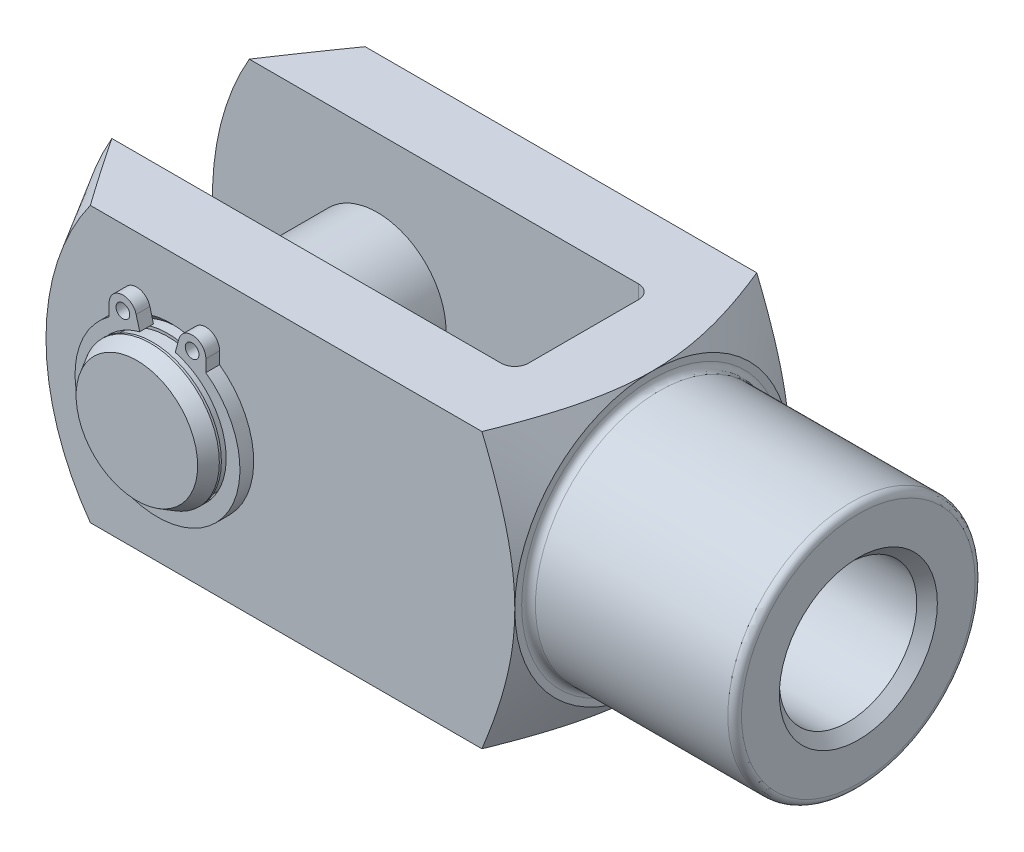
ISO-10303-21;
HEADER;
FILE_DESCRIPTION(('STEP AP214'),'2;1');
FILE_NAME('part.step','',(''),(''),'','','');
FILE_SCHEMA(('AUTOMOTIVE_DESIGN { 1 0 10303 214 1 1 1 1 }'));
ENDSEC;
DATA;
#1=APPLICATION_CONTEXT('core data for automotive mechanical design processes');
#2=APPLICATION_PROTOCOL_DEFINITION('international standard','automotive_design',2000,#1);
#3=PRODUCT_CONTEXT('',#1,'mechanical');
#4=PRODUCT('Part','Part','',(#3));
#5=PRODUCT_RELATED_PRODUCT_CATEGORY('part','',(#4));
#6=PRODUCT_DEFINITION_FORMATION('','',#4);
#7=PRODUCT_DEFINITION_CONTEXT('part definition',#1,'design');
#8=PRODUCT_DEFINITION('design','',#6,#7);
#9=PRODUCT_DEFINITION_SHAPE('','',#8);
#10=(LENGTH_UNIT() NAMED_UNIT(*) SI_UNIT(.MILLI.,.METRE.));
#11=(NAMED_UNIT(*) PLANE_ANGLE_UNIT() SI_UNIT($,.RADIAN.));
#12=(NAMED_UNIT(*) SI_UNIT($,.STERADIAN.) SOLID_ANGLE_UNIT());
#13=UNCERTAINTY_MEASURE_WITH_UNIT(LENGTH_MEASURE(1.E-05),#10,'distance_accuracy_value','');
#14=(GEOMETRIC_REPRESENTATION_CONTEXT(3) GLOBAL_UNCERTAINTY_ASSIGNED_CONTEXT((#13)) GLOBAL_UNIT_ASSIGNED_CONTEXT((#10,
#11,#12)) REPRESENTATION_CONTEXT('',''));
#15=CARTESIAN_POINT('',(0.,0.,0.));
#16=DIRECTION('',(0.,0.,1.));
#17=DIRECTION('',(1.,0.,0.));
#18=AXIS2_PLACEMENT_3D('',#15,#16,#17);
#19=CARTESIAN_POINT('',(-40.,0.,12.5));
#20=DIRECTION('',(0.,0.,-1.));
#21=DIRECTION('',(-1.,0.,0.));
#22=AXIS2_PLACEMENT_3D('',#19,#20,#21);
#23=CYLINDRICAL_SURFACE('',#22,5.);
#24=CARTESIAN_POINT('',(-40.,0.,10.25));
#25=DIRECTION('',(0.,0.,1.));
#26=DIRECTION('',(1.,0.,0.));
#27=AXIS2_PLACEMENT_3D('',#24,#25,#26);
#28=CIRCLE('',#27,5.);
#29=CARTESIAN_POINT('',(-35.,0.,10.25));
#30=VERTEX_POINT('',#29);
#31=EDGE_CURVE('P0_E55',#30,#30,#28,.T.);
#32=ORIENTED_EDGE('',*,*,#31,.F.);
#33=EDGE_LOOP('',(#32));
#34=FACE_BOUND('',#33,.T.);
#35=CARTESIAN_POINT('',(-40.,0.,-10.25));
#36=DIRECTION('',(0.,0.,1.));
#37=DIRECTION('',(1.,0.,0.));
#38=AXIS2_PLACEMENT_3D('',#35,#36,#37);
#39=CIRCLE('',#38,5.);
#40=CARTESIAN_POINT('',(-35.,0.,-10.25));
#41=VERTEX_POINT('',#40);
#42=EDGE_CURVE('P0_E40',#41,#41,#39,.T.);
#43=ORIENTED_EDGE('',*,*,#42,.T.);
#44=EDGE_LOOP('',(#43));
#45=FACE_BOUND('',#44,.T.);
#46=ADVANCED_FACE('P0_F14',(#34,#45),#23,.T.);
#47=CARTESIAN_POINT('',(-40.,0.,-11.35));
#48=DIRECTION('',(0.,0.,1.));
#49=DIRECTION('',(1.,0.,0.));
#50=AXIS2_PLACEMENT_3D('',#47,#48,#49);
#51=CIRCLE('',#50,5.);
#52=CARTESIAN_POINT('',(-35.,0.,-11.35));
#53=VERTEX_POINT('',#52);
#54=EDGE_CURVE('P0_E43',#53,#53,#51,.T.);
#55=ORIENTED_EDGE('',*,*,#54,.F.);
#56=EDGE_LOOP('',(#55));
#57=FACE_BOUND('',#56,.T.);
#58=CARTESIAN_POINT('',(-40.,0.,-11.5));
#59=DIRECTION('',(0.,0.,1.));
#60=DIRECTION('',(1.,0.,0.));
#61=AXIS2_PLACEMENT_3D('',#58,#59,#60);
#62=CIRCLE('',#61,5.);
#63=CARTESIAN_POINT('',(-35.,0.,-11.5));
#64=VERTEX_POINT('',#63);
#65=EDGE_CURVE('P0_E25',#64,#64,#62,.T.);
#66=ORIENTED_EDGE('',*,*,#65,.T.);
#67=EDGE_LOOP('',(#66));
#68=FACE_BOUND('',#67,.T.);
#69=ADVANCED_FACE('P0_F63',(#57,#68),#23,.T.);
#70=CARTESIAN_POINT('',(-40.,0.,-12.5));
#71=DIRECTION('',(0.,0.,1.));
#72=DIRECTION('',(1.,0.,0.));
#73=AXIS2_PLACEMENT_3D('',#70,#71,#72);
#74=PLANE('',#73);
#75=CARTESIAN_POINT('',(-40.,0.,-12.5));
#76=DIRECTION('',(0.,0.,1.));
#77=DIRECTION('',(1.,0.,0.));
#78=AXIS2_PLACEMENT_3D('',#75,#76,#77);
#79=CIRCLE('',#78,4.42264973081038);
#80=CARTESIAN_POINT('',(-35.5773502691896,0.,-12.5));
#81=VERTEX_POINT('',#80);
#82=EDGE_CURVE('P0_E21',#81,#81,#79,.F.);
#83=ORIENTED_EDGE('',*,*,#82,.T.);
#84=EDGE_LOOP('',(#83));
#85=FACE_BOUND('',#84,.T.);
#86=ADVANCED_FACE('P0_F89',(#85),#74,.F.);
#87=CARTESIAN_POINT('',(-40.,0.,-11.5));
#88=DIRECTION('',(0.,0.,1.));
#89=DIRECTION('',(1.,0.,0.));
#90=AXIS2_PLACEMENT_3D('',#87,#88,#89);
#91=CONICAL_SURFACE('',#90,5.,0.523598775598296);
#92=ORIENTED_EDGE('',*,*,#82,.F.);
#93=EDGE_LOOP('',(#92));
#94=FACE_BOUND('',#93,.T.);
#95=ORIENTED_EDGE('',*,*,#65,.F.);
#96=EDGE_LOOP('',(#95));
#97=FACE_BOUND('',#96,.T.);
#98=ADVANCED_FACE('P0_F83',(#94,#97),#91,.T.);
#99=CARTESIAN_POINT('',(-40.,5.,-11.35));
#100=DIRECTION('',(0.,0.,-1.));
#101=DIRECTION('',(-1.,0.,0.));
#102=AXIS2_PLACEMENT_3D('',#99,#100,#101);
#103=PLANE('',#102);
#104=CARTESIAN_POINT('',(-40.,0.,-11.35));
#105=DIRECTION('',(0.,0.,1.));
#106=DIRECTION('',(1.,0.,0.));
#107=AXIS2_PLACEMENT_3D('',#104,#105,#106);
#108=CIRCLE('',#107,4.8);
#109=CARTESIAN_POINT('',(-35.2,0.,-11.35));
#110=VERTEX_POINT('',#109);
#111=EDGE_CURVE('P0_E34',#110,#110,#108,.T.);
#112=ORIENTED_EDGE('',*,*,#111,.F.);
#113=EDGE_LOOP('',(#112));
#114=FACE_BOUND('',#113,.T.);
#115=ORIENTED_EDGE('',*,*,#54,.T.);
#116=EDGE_LOOP('',(#115));
#117=FACE_BOUND('',#116,.T.);
#118=ADVANCED_FACE('P0_F77',(#114,#117),#103,.F.);
#119=CARTESIAN_POINT('',(-40.,0.,11.5));
#120=DIRECTION('',(0.,0.,1.));
#121=DIRECTION('',(1.,0.,0.));
#122=AXIS2_PLACEMENT_3D('',#119,#120,#121);
#123=CYLINDRICAL_SURFACE('',#122,4.8);
#124=CARTESIAN_POINT('',(-40.,0.,-10.25));
#125=DIRECTION('',(0.,0.,1.));
#126=DIRECTION('',(1.,0.,0.));
#127=AXIS2_PLACEMENT_3D('',#124,#125,#126);
#128=CIRCLE('',#127,4.8);
#129=CARTESIAN_POINT('',(-35.2,0.,-10.25));
#130=VERTEX_POINT('',#129);
#131=EDGE_CURVE('P0_E37',#130,#130,#128,.T.);
#132=ORIENTED_EDGE('',*,*,#131,.F.);
#133=EDGE_LOOP('',(#132));
#134=FACE_BOUND('',#133,.T.);
#135=ORIENTED_EDGE('',*,*,#111,.T.);
#136=EDGE_LOOP('',(#135));
#137=FACE_BOUND('',#136,.T.);
#138=ADVANCED_FACE('P0_F71',(#134,#137),#123,.T.);
#139=CARTESIAN_POINT('',(-40.,5.,-10.25));
#140=DIRECTION('',(0.,0.,1.));
#141=DIRECTION('',(1.,0.,0.));
#142=AXIS2_PLACEMENT_3D('',#139,#140,#141);
#143=PLANE('',#142);
#144=ORIENTED_EDGE('',*,*,#42,.F.);
#145=EDGE_LOOP('',(#144));
#146=FACE_BOUND('',#145,.T.);
#147=ORIENTED_EDGE('',*,*,#131,.T.);
#148=EDGE_LOOP('',(#147));
#149=FACE_BOUND('',#148,.T.);
#150=ADVANCED_FACE('P0_F68',(#146,#149),#143,.F.);
#151=CARTESIAN_POINT('',(-40.,5.,10.25));
#152=DIRECTION('',(0.,0.,-1.));
#153=DIRECTION('',(-1.,0.,0.));
#154=AXIS2_PLACEMENT_3D('',#151,#152,#153);
#155=PLANE('',#154);
#156=CARTESIAN_POINT('',(-40.,0.,10.25));
#157=DIRECTION('',(0.,0.,1.));
#158=DIRECTION('',(1.,0.,0.));
#159=AXIS2_PLACEMENT_3D('',#156,#157,#158);
#160=CIRCLE('',#159,4.8);
#161=CARTESIAN_POINT('',(-35.2,0.,10.25));
#162=VERTEX_POINT('',#161);
#163=EDGE_CURVE('P0_E46',#162,#162,#160,.T.);
#164=ORIENTED_EDGE('',*,*,#163,.F.);
#165=EDGE_LOOP('',(#164));
#166=FACE_BOUND('',#165,.T.);
#167=ORIENTED_EDGE('',*,*,#31,.T.);
#168=EDGE_LOOP('',(#167));
#169=FACE_BOUND('',#168,.T.);
#170=ADVANCED_FACE('P0_F59',(#166,#169),#155,.F.);
#171=CARTESIAN_POINT('',(-40.,0.,11.5));
#172=DIRECTION('',(0.,0.,1.));
#173=DIRECTION('',(1.,0.,0.));
#174=AXIS2_PLACEMENT_3D('',#171,#172,#173);
#175=CYLINDRICAL_SURFACE('',#174,4.8);
#176=CARTESIAN_POINT('',(-40.,0.,11.35));
#177=DIRECTION('',(0.,0.,1.));
#178=DIRECTION('',(1.,0.,0.));
#179=AXIS2_PLACEMENT_3D('',#176,#177,#178);
#180=CIRCLE('',#179,4.8);
#181=CARTESIAN_POINT('',(-35.2,0.,11.35));
#182=VERTEX_POINT('',#181);
#183=EDGE_CURVE('P0_E49',#182,#182,#180,.T.);
#184=ORIENTED_EDGE('',*,*,#183,.F.);
#185=EDGE_LOOP('',(#184));
#186=FACE_BOUND('',#185,.T.);
#187=ORIENTED_EDGE('',*,*,#163,.T.);
#188=EDGE_LOOP('',(#187));
#189=FACE_BOUND('',#188,.T.);
#190=ADVANCED_FACE('P0_F108',(#186,#189),#175,.T.);
#191=CARTESIAN_POINT('',(-40.,5.,11.35));
#192=DIRECTION('',(0.,0.,1.));
#193=DIRECTION('',(1.,0.,0.));
#194=AXIS2_PLACEMENT_3D('',#191,#192,#193);
#195=PLANE('',#194);
#196=CARTESIAN_POINT('',(-40.,0.,11.35));
#197=DIRECTION('',(0.,0.,1.));
#198=DIRECTION('',(1.,0.,0.));
#199=AXIS2_PLACEMENT_3D('',#196,#197,#198);
#200=CIRCLE('',#199,5.);
#201=CARTESIAN_POINT('',(-35.,0.,11.35));
#202=VERTEX_POINT('',#201);
#203=EDGE_CURVE('P0_E52',#202,#202,#200,.T.);
#204=ORIENTED_EDGE('',*,*,#203,.F.);
#205=EDGE_LOOP('',(#204));
#206=FACE_BOUND('',#205,.T.);
#207=ORIENTED_EDGE('',*,*,#183,.T.);
#208=EDGE_LOOP('',(#207));
#209=FACE_BOUND('',#208,.T.);
#210=ADVANCED_FACE('P0_F104',(#206,#209),#195,.F.);
#211=CARTESIAN_POINT('',(-40.,0.,12.5));
#212=DIRECTION('',(0.,0.,1.));
#213=DIRECTION('',(1.,0.,0.));
#214=AXIS2_PLACEMENT_3D('',#211,#212,#213);
#215=PLANE('',#214);
#216=CARTESIAN_POINT('',(-40.,0.,12.5));
#217=DIRECTION('',(0.,0.,1.));
#218=DIRECTION('',(1.,0.,0.));
#219=AXIS2_PLACEMENT_3D('',#216,#217,#218);
#220=CIRCLE('',#219,4.42264973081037);
#221=CARTESIAN_POINT('',(-35.5773502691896,0.,12.5));
#222=VERTEX_POINT('',#221);
#223=EDGE_CURVE('P0_E10',#222,#222,#220,.T.);
#224=ORIENTED_EDGE('',*,*,#223,.T.);
#225=EDGE_LOOP('',(#224));
#226=FACE_BOUND('',#225,.T.);
#227=ADVANCED_FACE('P0_F102',(#226),#215,.T.);
#228=CARTESIAN_POINT('',(-40.,0.,12.5));
#229=DIRECTION('',(0.,0.,-1.));
#230=DIRECTION('',(-1.,0.,0.));
#231=AXIS2_PLACEMENT_3D('',#228,#229,#230);
#232=CONICAL_SURFACE('',#231,4.42264973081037,0.523598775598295);
#233=CARTESIAN_POINT('',(-40.,0.,11.5));
#234=DIRECTION('',(0.,0.,1.));
#235=DIRECTION('',(1.,0.,0.));
#236=AXIS2_PLACEMENT_3D('',#233,#234,#235);
#237=CIRCLE('',#236,5.);
#238=CARTESIAN_POINT('',(-35.,0.,11.5));
#239=VERTEX_POINT('',#238);
#240=EDGE_CURVE('P0_E29',#239,#239,#237,.F.);
#241=ORIENTED_EDGE('',*,*,#240,.F.);
#242=EDGE_LOOP('',(#241));
#243=FACE_BOUND('',#242,.T.);
#244=ORIENTED_EDGE('',*,*,#223,.F.);
#245=EDGE_LOOP('',(#244));
#246=FACE_BOUND('',#245,.T.);
#247=ADVANCED_FACE('P0_F16',(#243,#246),#232,.T.);
#248=ORIENTED_EDGE('',*,*,#203,.T.);
#249=EDGE_LOOP('',(#248));
#250=FACE_BOUND('',#249,.T.);
#251=ORIENTED_EDGE('',*,*,#240,.T.);
#252=EDGE_LOOP('',(#251));
#253=FACE_BOUND('',#252,.T.);
#254=ADVANCED_FACE('P0_F65',(#250,#253),#23,.T.);
#255=CLOSED_SHELL('',(#46,#69,#86,#98,#118,#138,#150,#170,#190,#210,#227,#247,#254));
#256=MANIFOLD_SOLID_BREP('P0_B1',#255);
#257=CARTESIAN_POINT('',(-40.,0.,10.9999999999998));
#258=DIRECTION('',(0.,0.,1.));
#259=DIRECTION('',(1.,0.,0.));
#260=AXIS2_PLACEMENT_3D('',#257,#258,#259);
#261=PLANE('',#260);
#262=CARTESIAN_POINT('',(-42.5188400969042,5.5367359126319,10.9999999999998));
#263=DIRECTION('',(0.,0.,1.));
#264=DIRECTION('',(1.,0.,0.));
#265=AXIS2_PLACEMENT_3D('',#262,#263,#264);
#266=CIRCLE('',#265,0.5);
#267=CARTESIAN_POINT('',(-42.0188400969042,5.5367359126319,10.9999999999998));
#268=VERTEX_POINT('',#267);
#269=EDGE_CURVE('P1_E117',#268,#268,#266,.T.);
#270=ORIENTED_EDGE('',*,*,#269,.F.);
#271=EDGE_LOOP('',(#270));
#272=FACE_BOUND('',#271,.T.);
#273=CARTESIAN_POINT('',(-40.,0.,10.9999999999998));
#274=DIRECTION('',(0.,0.,-1.));
#275=DIRECTION('',(1.,0.,0.));
#276=AXIS2_PLACEMENT_3D('',#273,#274,#275);
#277=CIRCLE('',#276,5.);
#278=CARTESIAN_POINT('',(-38.7059047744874,4.82962913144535,10.9999999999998));
#279=VERTEX_POINT('',#278);
#280=CARTESIAN_POINT('',(-41.2940952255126,4.82962913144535,10.9999999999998));
#281=VERTEX_POINT('',#280);
#282=EDGE_CURVE('P1_E128',#279,#281,#277,.T.);
#283=ORIENTED_EDGE('',*,*,#282,.T.);
#284=DIRECTION('',(-0.258819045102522,0.965925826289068,0.));
#285=VECTOR('',#284,1.);
#286=CARTESIAN_POINT('',(-41.2940952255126,4.82962913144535,10.9999999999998));
#287=LINE('',#286,#285);
#288=CARTESIAN_POINT('',(-41.5529142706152,5.79555495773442,10.9999999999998));
#289=VERTEX_POINT('',#288);
#290=EDGE_CURVE('P1_E76',#281,#289,#287,.T.);
#291=ORIENTED_EDGE('',*,*,#290,.T.);
#292=CARTESIAN_POINT('',(-42.5188400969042,5.5367359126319,10.9999999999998));
#293=DIRECTION('',(0.,0.,1.));
#294=DIRECTION('',(1.,0.,0.));
#295=AXIS2_PLACEMENT_3D('',#292,#293,#294);
#296=CIRCLE('',#295,0.999999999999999);
#297=CARTESIAN_POINT('',(-43.5188400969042,5.5367359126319,10.9999999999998));
#298=VERTEX_POINT('',#297);
#299=EDGE_CURVE('P1_E143',#289,#298,#296,.T.);
#300=ORIENTED_EDGE('',*,*,#299,.T.);
#301=DIRECTION('',(0.,-1.,0.));
#302=VECTOR('',#301,1.);
#303=CARTESIAN_POINT('',(-43.5188400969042,5.5367359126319,10.9999999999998));
#304=LINE('',#303,#302);
#305=CARTESIAN_POINT('',(-43.5188400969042,4.65981114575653,10.9999999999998));
#306=VERTEX_POINT('',#305);
#307=EDGE_CURVE('P1_E156',#298,#306,#304,.T.);
#308=ORIENTED_EDGE('',*,*,#307,.T.);
#309=CARTESIAN_POINT('',(-40.,-0.199999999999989,10.9999999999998));
#310=DIRECTION('',(0.,0.,1.));
#311=DIRECTION('',(1.,0.,0.));
#312=AXIS2_PLACEMENT_3D('',#309,#310,#311);
#313=CIRCLE('',#312,6.);
#314=CARTESIAN_POINT('',(-36.4811599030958,4.65981114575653,10.9999999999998));
#315=VERTEX_POINT('',#314);
#316=EDGE_CURVE('P1_E95',#306,#315,#313,.T.);
#317=ORIENTED_EDGE('',*,*,#316,.T.);
#318=DIRECTION('',(0.,1.,0.));
#319=VECTOR('',#318,1.);
#320=CARTESIAN_POINT('',(-36.4811599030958,5.5367359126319,10.9999999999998));
#321=LINE('',#320,#319);
#322=CARTESIAN_POINT('',(-36.4811599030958,5.5367359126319,10.9999999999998));
#323=VERTEX_POINT('',#322);
#324=EDGE_CURVE('P1_E89',#315,#323,#321,.T.);
#325=ORIENTED_EDGE('',*,*,#324,.T.);
#326=CARTESIAN_POINT('',(-37.4811599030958,5.5367359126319,10.9999999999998));
#327=DIRECTION('',(0.,0.,1.));
#328=DIRECTION('',(-1.,0.,0.));
#329=AXIS2_PLACEMENT_3D('',#326,#327,#328);
#330=CIRCLE('',#329,0.999999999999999);
#331=CARTESIAN_POINT('',(-38.4470857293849,5.79555495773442,10.9999999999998));
#332=VERTEX_POINT('',#331);
#333=EDGE_CURVE('P1_E93',#323,#332,#330,.T.);
#334=ORIENTED_EDGE('',*,*,#333,.T.);
#335=DIRECTION('',(-0.258819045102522,-0.965925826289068,0.));
#336=VECTOR('',#335,1.);
#337=CARTESIAN_POINT('',(-38.7059047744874,4.82962913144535,10.9999999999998));
#338=LINE('',#337,#336);
#339=EDGE_CURVE('P1_E33',#332,#279,#338,.T.);
#340=ORIENTED_EDGE('',*,*,#339,.T.);
#341=EDGE_LOOP('',(#283,#291,#300,#308,#317,#325,#334,#340));
#342=FACE_BOUND('',#341,.T.);
#343=CARTESIAN_POINT('',(-37.4811599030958,5.5367359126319,10.9999999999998));
#344=DIRECTION('',(0.,0.,1.));
#345=DIRECTION('',(-1.,0.,0.));
#346=AXIS2_PLACEMENT_3D('',#343,#344,#345);
#347=CIRCLE('',#346,0.5);
#348=CARTESIAN_POINT('',(-37.9811599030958,5.5367359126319,10.9999999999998));
#349=VERTEX_POINT('',#348);
#350=EDGE_CURVE('P1_E165',#349,#349,#347,.T.);
#351=ORIENTED_EDGE('',*,*,#350,.F.);
#352=EDGE_LOOP('',(#351));
#353=FACE_BOUND('',#352,.T.);
#354=ADVANCED_FACE('P1_F16',(#272,#342,#353),#261,.T.);
#355=CARTESIAN_POINT('',(-40.,0.,9.99999999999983));
#356=DIRECTION('',(0.,0.,1.));
#357=DIRECTION('',(1.,0.,0.));
#358=AXIS2_PLACEMENT_3D('',#355,#356,#357);
#359=PLANE('',#358);
#360=CARTESIAN_POINT('',(-42.5188400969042,5.5367359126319,9.99999999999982));
#361=DIRECTION('',(0.,0.,1.));
#362=DIRECTION('',(1.,0.,0.));
#363=AXIS2_PLACEMENT_3D('',#360,#361,#362);
#364=CIRCLE('',#363,0.5);
#365=CARTESIAN_POINT('',(-42.0188400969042,5.5367359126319,9.99999999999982));
#366=VERTEX_POINT('',#365);
#367=EDGE_CURVE('P1_E162',#366,#366,#364,.T.);
#368=ORIENTED_EDGE('',*,*,#367,.T.);
#369=EDGE_LOOP('',(#368));
#370=FACE_BOUND('',#369,.T.);
#371=CARTESIAN_POINT('',(-40.,0.,9.99999999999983));
#372=DIRECTION('',(0.,0.,-1.));
#373=DIRECTION('',(1.,0.,0.));
#374=AXIS2_PLACEMENT_3D('',#371,#372,#373);
#375=CIRCLE('',#374,5.);
#376=CARTESIAN_POINT('',(-38.7059047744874,4.82962913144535,9.99999999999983));
#377=VERTEX_POINT('',#376);
#378=CARTESIAN_POINT('',(-41.2940952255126,4.82962913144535,9.99999999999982));
#379=VERTEX_POINT('',#378);
#380=EDGE_CURVE('P1_E113',#377,#379,#375,.T.);
#381=ORIENTED_EDGE('',*,*,#380,.F.);
#382=DIRECTION('',(-0.258819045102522,-0.965925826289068,0.));
#383=VECTOR('',#382,1.);
#384=CARTESIAN_POINT('',(-38.7059047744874,4.82962913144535,9.99999999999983));
#385=LINE('',#384,#383);
#386=CARTESIAN_POINT('',(-38.4470857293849,5.79555495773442,9.99999999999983));
#387=VERTEX_POINT('',#386);
#388=EDGE_CURVE('P1_E68',#387,#377,#385,.T.);
#389=ORIENTED_EDGE('',*,*,#388,.F.);
#390=CARTESIAN_POINT('',(-37.4811599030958,5.5367359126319,9.99999999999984));
#391=DIRECTION('',(0.,0.,1.));
#392=DIRECTION('',(-1.,0.,0.));
#393=AXIS2_PLACEMENT_3D('',#390,#391,#392);
#394=CIRCLE('',#393,0.999999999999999);
#395=CARTESIAN_POINT('',(-36.4811599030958,5.5367359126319,9.99999999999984));
#396=VERTEX_POINT('',#395);
#397=EDGE_CURVE('P1_E62',#396,#387,#394,.T.);
#398=ORIENTED_EDGE('',*,*,#397,.F.);
#399=DIRECTION('',(0.,1.,0.));
#400=VECTOR('',#399,1.);
#401=CARTESIAN_POINT('',(-36.4811599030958,5.5367359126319,9.99999999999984));
#402=LINE('',#401,#400);
#403=CARTESIAN_POINT('',(-36.4811599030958,4.65981114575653,9.99999999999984));
#404=VERTEX_POINT('',#403);
#405=EDGE_CURVE('P1_E103',#404,#396,#402,.T.);
#406=ORIENTED_EDGE('',*,*,#405,.F.);
#407=CARTESIAN_POINT('',(-40.,-0.199999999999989,9.99999999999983));
#408=DIRECTION('',(0.,0.,1.));
#409=DIRECTION('',(1.,0.,0.));
#410=AXIS2_PLACEMENT_3D('',#407,#408,#409);
#411=CIRCLE('',#410,6.);
#412=CARTESIAN_POINT('',(-43.5188400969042,4.65981114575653,9.99999999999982));
#413=VERTEX_POINT('',#412);
#414=EDGE_CURVE('P1_E123',#413,#404,#411,.T.);
#415=ORIENTED_EDGE('',*,*,#414,.F.);
#416=DIRECTION('',(0.,-1.,0.));
#417=VECTOR('',#416,1.);
#418=CARTESIAN_POINT('',(-43.5188400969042,5.5367359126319,9.99999999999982));
#419=LINE('',#418,#417);
#420=CARTESIAN_POINT('',(-43.5188400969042,5.5367359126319,9.99999999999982));
#421=VERTEX_POINT('',#420);
#422=EDGE_CURVE('P1_E121',#421,#413,#419,.T.);
#423=ORIENTED_EDGE('',*,*,#422,.F.);
#424=CARTESIAN_POINT('',(-42.5188400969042,5.5367359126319,9.99999999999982));
#425=DIRECTION('',(0.,0.,1.));
#426=DIRECTION('',(1.,0.,0.));
#427=AXIS2_PLACEMENT_3D('',#424,#425,#426);
#428=CIRCLE('',#427,0.999999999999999);
#429=CARTESIAN_POINT('',(-41.5529142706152,5.79555495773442,9.99999999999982));
#430=VERTEX_POINT('',#429);
#431=EDGE_CURVE('P1_E119',#430,#421,#428,.T.);
#432=ORIENTED_EDGE('',*,*,#431,.F.);
#433=DIRECTION('',(-0.258819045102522,0.965925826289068,0.));
#434=VECTOR('',#433,1.);
#435=CARTESIAN_POINT('',(-41.2940952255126,4.82962913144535,9.99999999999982));
#436=LINE('',#435,#434);
#437=EDGE_CURVE('P1_E116',#379,#430,#436,.T.);
#438=ORIENTED_EDGE('',*,*,#437,.F.);
#439=EDGE_LOOP('',(#381,#389,#398,#406,#415,#423,#432,#438));
#440=FACE_BOUND('',#439,.T.);
#441=CARTESIAN_POINT('',(-37.4811599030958,5.5367359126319,9.99999999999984));
#442=DIRECTION('',(0.,0.,1.));
#443=DIRECTION('',(-1.,0.,0.));
#444=AXIS2_PLACEMENT_3D('',#441,#442,#443);
#445=CIRCLE('',#444,0.5);
#446=CARTESIAN_POINT('',(-37.9811599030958,5.5367359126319,9.99999999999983));
#447=VERTEX_POINT('',#446);
#448=EDGE_CURVE('P1_E168',#447,#447,#445,.T.);
#449=ORIENTED_EDGE('',*,*,#448,.T.);
#450=EDGE_LOOP('',(#449));
#451=FACE_BOUND('',#450,.T.);
#452=ADVANCED_FACE('P1_F147',(#370,#440,#451),#359,.F.);
#453=CARTESIAN_POINT('',(-40.,0.,10.9999999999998));
#454=DIRECTION('',(0.,0.,-1.));
#455=DIRECTION('',(-1.,0.,0.));
#456=AXIS2_PLACEMENT_3D('',#453,#454,#455);
#457=CYLINDRICAL_SURFACE('',#456,5.);
#458=ORIENTED_EDGE('',*,*,#380,.T.);
#459=DIRECTION('',(0.,0.,-1.));
#460=VECTOR('',#459,1.);
#461=CARTESIAN_POINT('',(-41.2940952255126,4.82962913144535,10.9999999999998));
#462=LINE('',#461,#460);
#463=EDGE_CURVE('P1_E11',#281,#379,#462,.T.);
#464=ORIENTED_EDGE('',*,*,#463,.F.);
#465=ORIENTED_EDGE('',*,*,#282,.F.);
#466=DIRECTION('',(0.,0.,-1.));
#467=VECTOR('',#466,1.);
#468=CARTESIAN_POINT('',(-38.7059047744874,4.82962913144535,10.9999999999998));
#469=LINE('',#468,#467);
#470=EDGE_CURVE('P1_E109',#279,#377,#469,.T.);
#471=ORIENTED_EDGE('',*,*,#470,.T.);
#472=EDGE_LOOP('',(#458,#464,#465,#471));
#473=FACE_BOUND('',#472,.T.);
#474=ADVANCED_FACE('P1_F18',(#473),#457,.F.);
#475=CARTESIAN_POINT('',(-41.2940952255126,4.82962913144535,10.9999999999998));
#476=DIRECTION('',(-0.965925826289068,-0.258819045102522,0.));
#477=DIRECTION('',(0.258819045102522,-0.965925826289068,0.));
#478=AXIS2_PLACEMENT_3D('',#475,#476,#477);
#479=PLANE('',#478);
#480=ORIENTED_EDGE('',*,*,#437,.T.);
#481=DIRECTION('',(0.,0.,-1.));
#482=VECTOR('',#481,1.);
#483=CARTESIAN_POINT('',(-41.5529142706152,5.79555495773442,10.9999999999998));
#484=LINE('',#483,#482);
#485=EDGE_CURVE('P1_E25',#289,#430,#484,.T.);
#486=ORIENTED_EDGE('',*,*,#485,.F.);
#487=ORIENTED_EDGE('',*,*,#290,.F.);
#488=ORIENTED_EDGE('',*,*,#463,.T.);
#489=EDGE_LOOP('',(#480,#486,#487,#488));
#490=FACE_BOUND('',#489,.T.);
#491=ADVANCED_FACE('P1_F202',(#490),#479,.F.);
#492=CARTESIAN_POINT('',(-42.5188400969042,5.5367359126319,10.9999999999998));
#493=DIRECTION('',(0.,0.,-1.));
#494=DIRECTION('',(-1.,0.,0.));
#495=AXIS2_PLACEMENT_3D('',#492,#493,#494);
#496=CYLINDRICAL_SURFACE('',#495,0.999999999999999);
#497=ORIENTED_EDGE('',*,*,#431,.T.);
#498=DIRECTION('',(0.,0.,-1.));
#499=VECTOR('',#498,1.);
#500=CARTESIAN_POINT('',(-43.5188400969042,5.5367359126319,10.9999999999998));
#501=LINE('',#500,#499);
#502=EDGE_CURVE('P1_E135',#298,#421,#501,.T.);
#503=ORIENTED_EDGE('',*,*,#502,.F.);
#504=ORIENTED_EDGE('',*,*,#299,.F.);
#505=ORIENTED_EDGE('',*,*,#485,.T.);
#506=EDGE_LOOP('',(#497,#503,#504,#505));
#507=FACE_BOUND('',#506,.T.);
#508=ADVANCED_FACE('P1_F141',(#507),#496,.T.);
#509=CARTESIAN_POINT('',(-43.5188400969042,5.5367359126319,10.9999999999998));
#510=DIRECTION('',(1.,0.,0.));
#511=DIRECTION('',(0.,1.,0.));
#512=AXIS2_PLACEMENT_3D('',#509,#510,#511);
#513=PLANE('',#512);
#514=ORIENTED_EDGE('',*,*,#422,.T.);
#515=DIRECTION('',(0.,0.,-1.));
#516=VECTOR('',#515,1.);
#517=CARTESIAN_POINT('',(-43.5188400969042,4.65981114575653,10.9999999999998));
#518=LINE('',#517,#516);
#519=EDGE_CURVE('P1_E132',#306,#413,#518,.T.);
#520=ORIENTED_EDGE('',*,*,#519,.F.);
#521=ORIENTED_EDGE('',*,*,#307,.F.);
#522=ORIENTED_EDGE('',*,*,#502,.T.);
#523=EDGE_LOOP('',(#514,#520,#521,#522));
#524=FACE_BOUND('',#523,.T.);
#525=ADVANCED_FACE('P1_F152',(#524),#513,.F.);
#526=CARTESIAN_POINT('',(-40.,-0.199999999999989,10.9999999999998));
#527=DIRECTION('',(0.,0.,-1.));
#528=DIRECTION('',(-1.,0.,0.));
#529=AXIS2_PLACEMENT_3D('',#526,#527,#528);
#530=CYLINDRICAL_SURFACE('',#529,6.);
#531=ORIENTED_EDGE('',*,*,#414,.T.);
#532=DIRECTION('',(0.,0.,-1.));
#533=VECTOR('',#532,1.);
#534=CARTESIAN_POINT('',(-36.4811599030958,4.65981114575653,10.9999999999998));
#535=LINE('',#534,#533);
#536=EDGE_CURVE('P1_E104',#315,#404,#535,.T.);
#537=ORIENTED_EDGE('',*,*,#536,.F.);
#538=ORIENTED_EDGE('',*,*,#316,.F.);
#539=ORIENTED_EDGE('',*,*,#519,.T.);
#540=EDGE_LOOP('',(#531,#537,#538,#539));
#541=FACE_BOUND('',#540,.T.);
#542=ADVANCED_FACE('P1_F155',(#541),#530,.T.);
#543=CARTESIAN_POINT('',(-36.4811599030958,5.5367359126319,10.9999999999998));
#544=DIRECTION('',(-1.,0.,0.));
#545=DIRECTION('',(0.,-1.,0.));
#546=AXIS2_PLACEMENT_3D('',#543,#544,#545);
#547=PLANE('',#546);
#548=ORIENTED_EDGE('',*,*,#405,.T.);
#549=DIRECTION('',(0.,0.,-1.));
#550=VECTOR('',#549,1.);
#551=CARTESIAN_POINT('',(-36.4811599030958,5.5367359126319,10.9999999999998));
#552=LINE('',#551,#550);
#553=EDGE_CURVE('P1_E100',#323,#396,#552,.T.);
#554=ORIENTED_EDGE('',*,*,#553,.F.);
#555=ORIENTED_EDGE('',*,*,#324,.F.);
#556=ORIENTED_EDGE('',*,*,#536,.T.);
#557=EDGE_LOOP('',(#548,#554,#555,#556));
#558=FACE_BOUND('',#557,.T.);
#559=ADVANCED_FACE('P1_F101',(#558),#547,.F.);
#560=CARTESIAN_POINT('',(-37.4811599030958,5.5367359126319,10.9999999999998));
#561=DIRECTION('',(0.,0.,-1.));
#562=DIRECTION('',(-1.,0.,0.));
#563=AXIS2_PLACEMENT_3D('',#560,#561,#562);
#564=CYLINDRICAL_SURFACE('',#563,0.999999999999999);
#565=ORIENTED_EDGE('',*,*,#397,.T.);
#566=DIRECTION('',(0.,0.,-1.));
#567=VECTOR('',#566,1.);
#568=CARTESIAN_POINT('',(-38.4470857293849,5.79555495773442,10.9999999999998));
#569=LINE('',#568,#567);
#570=EDGE_CURVE('P1_E105',#332,#387,#569,.T.);
#571=ORIENTED_EDGE('',*,*,#570,.F.);
#572=ORIENTED_EDGE('',*,*,#333,.F.);
#573=ORIENTED_EDGE('',*,*,#553,.T.);
#574=EDGE_LOOP('',(#565,#571,#572,#573));
#575=FACE_BOUND('',#574,.T.);
#576=ADVANCED_FACE('P1_F107',(#575),#564,.T.);
#577=CARTESIAN_POINT('',(-38.7059047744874,4.82962913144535,10.9999999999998));
#578=DIRECTION('',(0.965925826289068,-0.258819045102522,0.));
#579=DIRECTION('',(0.258819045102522,0.965925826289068,0.));
#580=AXIS2_PLACEMENT_3D('',#577,#578,#579);
#581=PLANE('',#580);
#582=ORIENTED_EDGE('',*,*,#388,.T.);
#583=ORIENTED_EDGE('',*,*,#470,.F.);
#584=ORIENTED_EDGE('',*,*,#339,.F.);
#585=ORIENTED_EDGE('',*,*,#570,.T.);
#586=EDGE_LOOP('',(#582,#583,#584,#585));
#587=FACE_BOUND('',#586,.T.);
#588=ADVANCED_FACE('P1_F190',(#587),#581,.F.);
#589=CARTESIAN_POINT('',(-42.5188400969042,5.5367359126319,10.9999999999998));
#590=DIRECTION('',(0.,0.,-1.));
#591=DIRECTION('',(-1.,0.,0.));
#592=AXIS2_PLACEMENT_3D('',#589,#590,#591);
#593=CYLINDRICAL_SURFACE('',#592,0.5);
#594=ORIENTED_EDGE('',*,*,#269,.T.);
#595=EDGE_LOOP('',(#594));
#596=FACE_BOUND('',#595,.T.);
#597=ORIENTED_EDGE('',*,*,#367,.F.);
#598=EDGE_LOOP('',(#597));
#599=FACE_BOUND('',#598,.T.);
#600=ADVANCED_FACE('P1_F187',(#596,#599),#593,.F.);
#601=CARTESIAN_POINT('',(-37.4811599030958,5.5367359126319,10.9999999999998));
#602=DIRECTION('',(0.,0.,-1.));
#603=DIRECTION('',(-1.,0.,0.));
#604=AXIS2_PLACEMENT_3D('',#601,#602,#603);
#605=CYLINDRICAL_SURFACE('',#604,0.5);
#606=ORIENTED_EDGE('',*,*,#350,.T.);
#607=EDGE_LOOP('',(#606));
#608=FACE_BOUND('',#607,.T.);
#609=ORIENTED_EDGE('',*,*,#448,.F.);
#610=EDGE_LOOP('',(#609));
#611=FACE_BOUND('',#610,.T.);
#612=ADVANCED_FACE('P1_F174',(#608,#611),#605,.F.);
#613=CLOSED_SHELL('',(#354,#452,#474,#491,#508,#525,#542,#559,#576,#588,#600,#612));
#614=MANIFOLD_SOLID_BREP('P1_B1',#613);
#615=CARTESIAN_POINT('',(-40.,0.,-10.9999999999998));
#616=DIRECTION('',(0.,0.,-1.));
#617=DIRECTION('',(-1.,0.,0.));
#618=AXIS2_PLACEMENT_3D('',#615,#616,#617);
#619=PLANE('',#618);
#620=CARTESIAN_POINT('',(-37.4811599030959,5.53673591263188,-10.9999999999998));
#621=DIRECTION('',(0.,0.,-1.));
#622=DIRECTION('',(-1.,0.,0.));
#623=AXIS2_PLACEMENT_3D('',#620,#621,#622);
#624=CIRCLE('',#623,0.5);
#625=CARTESIAN_POINT('',(-37.9811599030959,5.53673591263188,-10.9999999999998));
#626=VERTEX_POINT('',#625);
#627=EDGE_CURVE('P2_E117',#626,#626,#624,.T.);
#628=ORIENTED_EDGE('',*,*,#627,.F.);
#629=EDGE_LOOP('',(#628));
#630=FACE_BOUND('',#629,.T.);
#631=CARTESIAN_POINT('',(-40.,0.,-10.9999999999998));
#632=DIRECTION('',(0.,0.,1.));
#633=DIRECTION('',(-1.,0.,0.));
#634=AXIS2_PLACEMENT_3D('',#631,#632,#633);
#635=CIRCLE('',#634,5.);
#636=CARTESIAN_POINT('',(-41.2940952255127,4.82962913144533,-10.9999999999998));
#637=VERTEX_POINT('',#636);
#638=CARTESIAN_POINT('',(-38.7059047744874,4.82962913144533,-10.9999999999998));
#639=VERTEX_POINT('',#638);
#640=EDGE_CURVE('P2_E128',#637,#639,#635,.T.);
#641=ORIENTED_EDGE('',*,*,#640,.T.);
#642=DIRECTION('',(0.258819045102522,0.965925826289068,0.));
#643=VECTOR('',#642,1.);
#644=CARTESIAN_POINT('',(-38.7059047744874,4.82962913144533,-10.9999999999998));
#645=LINE('',#644,#643);
#646=CARTESIAN_POINT('',(-38.4470857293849,5.7955549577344,-10.9999999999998));
#647=VERTEX_POINT('',#646);
#648=EDGE_CURVE('P2_E76',#639,#647,#645,.T.);
#649=ORIENTED_EDGE('',*,*,#648,.T.);
#650=CARTESIAN_POINT('',(-37.4811599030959,5.53673591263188,-10.9999999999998));
#651=DIRECTION('',(0.,0.,-1.));
#652=DIRECTION('',(-1.,0.,0.));
#653=AXIS2_PLACEMENT_3D('',#650,#651,#652);
#654=CIRCLE('',#653,0.999999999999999);
#655=CARTESIAN_POINT('',(-36.4811599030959,5.53673591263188,-10.9999999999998));
#656=VERTEX_POINT('',#655);
#657=EDGE_CURVE('P2_E143',#647,#656,#654,.T.);
#658=ORIENTED_EDGE('',*,*,#657,.T.);
#659=DIRECTION('',(0.,-1.,0.));
#660=VECTOR('',#659,1.);
#661=CARTESIAN_POINT('',(-36.4811599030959,5.53673591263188,-10.9999999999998));
#662=LINE('',#661,#660);
#663=CARTESIAN_POINT('',(-36.4811599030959,4.65981114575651,-10.9999999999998));
#664=VERTEX_POINT('',#663);
#665=EDGE_CURVE('P2_E156',#656,#664,#662,.T.);
#666=ORIENTED_EDGE('',*,*,#665,.T.);
#667=CARTESIAN_POINT('',(-40.,-0.200000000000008,-10.9999999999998));
#668=DIRECTION('',(0.,0.,-1.));
#669=DIRECTION('',(-1.,0.,0.));
#670=AXIS2_PLACEMENT_3D('',#667,#668,#669);
#671=CIRCLE('',#670,6.);
#672=CARTESIAN_POINT('',(-43.5188400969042,4.65981114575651,-10.9999999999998));
#673=VERTEX_POINT('',#672);
#674=EDGE_CURVE('P2_E95',#664,#673,#671,.T.);
#675=ORIENTED_EDGE('',*,*,#674,.T.);
#676=DIRECTION('',(0.,1.,0.));
#677=VECTOR('',#676,1.);
#678=CARTESIAN_POINT('',(-43.5188400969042,5.53673591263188,-10.9999999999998));
#679=LINE('',#678,#677);
#680=CARTESIAN_POINT('',(-43.5188400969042,5.53673591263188,-10.9999999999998));
#681=VERTEX_POINT('',#680);
#682=EDGE_CURVE('P2_E89',#673,#681,#679,.T.);
#683=ORIENTED_EDGE('',*,*,#682,.T.);
#684=CARTESIAN_POINT('',(-42.5188400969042,5.53673591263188,-10.9999999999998));
#685=DIRECTION('',(0.,0.,-1.));
#686=DIRECTION('',(1.,0.,0.));
#687=AXIS2_PLACEMENT_3D('',#684,#685,#686);
#688=CIRCLE('',#687,0.999999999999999);
#689=CARTESIAN_POINT('',(-41.5529142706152,5.7955549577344,-10.9999999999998));
#690=VERTEX_POINT('',#689);
#691=EDGE_CURVE('P2_E93',#681,#690,#688,.T.);
#692=ORIENTED_EDGE('',*,*,#691,.T.);
#693=DIRECTION('',(0.258819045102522,-0.965925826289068,0.));
#694=VECTOR('',#693,1.);
#695=CARTESIAN_POINT('',(-41.2940952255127,4.82962913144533,-10.9999999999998));
#696=LINE('',#695,#694);
#697=EDGE_CURVE('P2_E33',#690,#637,#696,.T.);
#698=ORIENTED_EDGE('',*,*,#697,.T.);
#699=EDGE_LOOP('',(#641,#649,#658,#666,#675,#683,#692,#698));
#700=FACE_BOUND('',#699,.T.);
#701=CARTESIAN_POINT('',(-42.5188400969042,5.53673591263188,-10.9999999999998));
#702=DIRECTION('',(0.,0.,-1.));
#703=DIRECTION('',(1.,0.,0.));
#704=AXIS2_PLACEMENT_3D('',#701,#702,#703);
#705=CIRCLE('',#704,0.5);
#706=CARTESIAN_POINT('',(-42.0188400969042,5.53673591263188,-10.9999999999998));
#707=VERTEX_POINT('',#706);
#708=EDGE_CURVE('P2_E165',#707,#707,#705,.T.);
#709=ORIENTED_EDGE('',*,*,#708,.F.);
#710=EDGE_LOOP('',(#709));
#711=FACE_BOUND('',#710,.T.);
#712=ADVANCED_FACE('P2_F16',(#630,#700,#711),#619,.T.);
#713=CARTESIAN_POINT('',(-40.,0.,-9.99999999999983));
#714=DIRECTION('',(0.,0.,-1.));
#715=DIRECTION('',(-1.,0.,0.));
#716=AXIS2_PLACEMENT_3D('',#713,#714,#715);
#717=PLANE('',#716);
#718=CARTESIAN_POINT('',(-37.4811599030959,5.53673591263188,-9.99999999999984));
#719=DIRECTION('',(0.,0.,-1.));
#720=DIRECTION('',(-1.,0.,0.));
#721=AXIS2_PLACEMENT_3D('',#718,#719,#720);
#722=CIRCLE('',#721,0.5);
#723=CARTESIAN_POINT('',(-37.9811599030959,5.53673591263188,-9.99999999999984));
#724=VERTEX_POINT('',#723);
#725=EDGE_CURVE('P2_E162',#724,#724,#722,.T.);
#726=ORIENTED_EDGE('',*,*,#725,.T.);
#727=EDGE_LOOP('',(#726));
#728=FACE_BOUND('',#727,.T.);
#729=CARTESIAN_POINT('',(-40.,0.,-9.99999999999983));
#730=DIRECTION('',(0.,0.,1.));
#731=DIRECTION('',(-1.,0.,0.));
#732=AXIS2_PLACEMENT_3D('',#729,#730,#731);
#733=CIRCLE('',#732,5.);
#734=CARTESIAN_POINT('',(-41.2940952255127,4.82962913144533,-9.99999999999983));
#735=VERTEX_POINT('',#734);
#736=CARTESIAN_POINT('',(-38.7059047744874,4.82962913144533,-9.99999999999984));
#737=VERTEX_POINT('',#736);
#738=EDGE_CURVE('P2_E113',#735,#737,#733,.T.);
#739=ORIENTED_EDGE('',*,*,#738,.F.);
#740=DIRECTION('',(0.258819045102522,-0.965925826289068,0.));
#741=VECTOR('',#740,1.);
#742=CARTESIAN_POINT('',(-41.2940952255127,4.82962913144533,-9.99999999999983));
#743=LINE('',#742,#741);
#744=CARTESIAN_POINT('',(-41.5529142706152,5.7955549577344,-9.99999999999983));
#745=VERTEX_POINT('',#744);
#746=EDGE_CURVE('P2_E68',#745,#735,#743,.T.);
#747=ORIENTED_EDGE('',*,*,#746,.F.);
#748=CARTESIAN_POINT('',(-42.5188400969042,5.53673591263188,-9.99999999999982));
#749=DIRECTION('',(0.,0.,-1.));
#750=DIRECTION('',(1.,0.,0.));
#751=AXIS2_PLACEMENT_3D('',#748,#749,#750);
#752=CIRCLE('',#751,0.999999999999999);
#753=CARTESIAN_POINT('',(-43.5188400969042,5.53673591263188,-9.99999999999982));
#754=VERTEX_POINT('',#753);
#755=EDGE_CURVE('P2_E62',#754,#745,#752,.T.);
#756=ORIENTED_EDGE('',*,*,#755,.F.);
#757=DIRECTION('',(0.,1.,0.));
#758=VECTOR('',#757,1.);
#759=CARTESIAN_POINT('',(-43.5188400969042,5.53673591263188,-9.99999999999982));
#760=LINE('',#759,#758);
#761=CARTESIAN_POINT('',(-43.5188400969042,4.65981114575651,-9.99999999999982));
#762=VERTEX_POINT('',#761);
#763=EDGE_CURVE('P2_E103',#762,#754,#760,.T.);
#764=ORIENTED_EDGE('',*,*,#763,.F.);
#765=CARTESIAN_POINT('',(-40.,-0.200000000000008,-9.99999999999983));
#766=DIRECTION('',(0.,0.,-1.));
#767=DIRECTION('',(-1.,0.,0.));
#768=AXIS2_PLACEMENT_3D('',#765,#766,#767);
#769=CIRCLE('',#768,6.);
#770=CARTESIAN_POINT('',(-36.4811599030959,4.65981114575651,-9.99999999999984));
#771=VERTEX_POINT('',#770);
#772=EDGE_CURVE('P2_E123',#771,#762,#769,.T.);
#773=ORIENTED_EDGE('',*,*,#772,.F.);
#774=DIRECTION('',(0.,-1.,0.));
#775=VECTOR('',#774,1.);
#776=CARTESIAN_POINT('',(-36.4811599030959,5.53673591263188,-9.99999999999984));
#777=LINE('',#776,#775);
#778=CARTESIAN_POINT('',(-36.4811599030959,5.53673591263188,-9.99999999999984));
#779=VERTEX_POINT('',#778);
#780=EDGE_CURVE('P2_E121',#779,#771,#777,.T.);
#781=ORIENTED_EDGE('',*,*,#780,.F.);
#782=CARTESIAN_POINT('',(-37.4811599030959,5.53673591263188,-9.99999999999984));
#783=DIRECTION('',(0.,0.,-1.));
#784=DIRECTION('',(-1.,0.,0.));
#785=AXIS2_PLACEMENT_3D('',#782,#783,#784);
#786=CIRCLE('',#785,0.999999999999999);
#787=CARTESIAN_POINT('',(-38.4470857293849,5.7955549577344,-9.99999999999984));
#788=VERTEX_POINT('',#787);
#789=EDGE_CURVE('P2_E119',#788,#779,#786,.T.);
#790=ORIENTED_EDGE('',*,*,#789,.F.);
#791=DIRECTION('',(0.258819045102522,0.965925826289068,0.));
#792=VECTOR('',#791,1.);
#793=CARTESIAN_POINT('',(-38.7059047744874,4.82962913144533,-9.99999999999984));
#794=LINE('',#793,#792);
#795=EDGE_CURVE('P2_E116',#737,#788,#794,.T.);
#796=ORIENTED_EDGE('',*,*,#795,.F.);
#797=EDGE_LOOP('',(#739,#747,#756,#764,#773,#781,#790,#796));
#798=FACE_BOUND('',#797,.T.);
#799=CARTESIAN_POINT('',(-42.5188400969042,5.53673591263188,-9.99999999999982));
#800=DIRECTION('',(0.,0.,-1.));
#801=DIRECTION('',(1.,0.,0.));
#802=AXIS2_PLACEMENT_3D('',#799,#800,#801);
#803=CIRCLE('',#802,0.5);
#804=CARTESIAN_POINT('',(-42.0188400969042,5.53673591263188,-9.99999999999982));
#805=VERTEX_POINT('',#804);
#806=EDGE_CURVE('P2_E168',#805,#805,#803,.T.);
#807=ORIENTED_EDGE('',*,*,#806,.T.);
#808=EDGE_LOOP('',(#807));
#809=FACE_BOUND('',#808,.T.);
#810=ADVANCED_FACE('P2_F147',(#728,#798,#809),#717,.F.);
#811=CARTESIAN_POINT('',(-40.,0.,-10.9999999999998));
#812=DIRECTION('',(0.,0.,1.));
#813=DIRECTION('',(1.,0.,0.));
#814=AXIS2_PLACEMENT_3D('',#811,#812,#813);
#815=CYLINDRICAL_SURFACE('',#814,5.);
#816=ORIENTED_EDGE('',*,*,#738,.T.);
#817=DIRECTION('',(0.,0.,1.));
#818=VECTOR('',#817,1.);
#819=CARTESIAN_POINT('',(-38.7059047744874,4.82962913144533,-10.9999999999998));
#820=LINE('',#819,#818);
#821=EDGE_CURVE('P2_E11',#639,#737,#820,.T.);
#822=ORIENTED_EDGE('',*,*,#821,.F.);
#823=ORIENTED_EDGE('',*,*,#640,.F.);
#824=DIRECTION('',(0.,0.,1.));
#825=VECTOR('',#824,1.);
#826=CARTESIAN_POINT('',(-41.2940952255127,4.82962913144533,-10.9999999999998));
#827=LINE('',#826,#825);
#828=EDGE_CURVE('P2_E109',#637,#735,#827,.T.);
#829=ORIENTED_EDGE('',*,*,#828,.T.);
#830=EDGE_LOOP('',(#816,#822,#823,#829));
#831=FACE_BOUND('',#830,.T.);
#832=ADVANCED_FACE('P2_F18',(#831),#815,.F.);
#833=CARTESIAN_POINT('',(-38.7059047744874,4.82962913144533,-10.9999999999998));
#834=DIRECTION('',(0.965925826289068,-0.258819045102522,0.));
#835=DIRECTION('',(-0.258819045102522,-0.965925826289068,0.));
#836=AXIS2_PLACEMENT_3D('',#833,#834,#835);
#837=PLANE('',#836);
#838=ORIENTED_EDGE('',*,*,#795,.T.);
#839=DIRECTION('',(0.,0.,1.));
#840=VECTOR('',#839,1.);
#841=CARTESIAN_POINT('',(-38.4470857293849,5.7955549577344,-10.9999999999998));
#842=LINE('',#841,#840);
#843=EDGE_CURVE('P2_E25',#647,#788,#842,.T.);
#844=ORIENTED_EDGE('',*,*,#843,.F.);
#845=ORIENTED_EDGE('',*,*,#648,.F.);
#846=ORIENTED_EDGE('',*,*,#821,.T.);
#847=EDGE_LOOP('',(#838,#844,#845,#846));
#848=FACE_BOUND('',#847,.T.);
#849=ADVANCED_FACE('P2_F202',(#848),#837,.F.);
#850=CARTESIAN_POINT('',(-37.4811599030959,5.53673591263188,-10.9999999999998));
#851=DIRECTION('',(0.,0.,1.));
#852=DIRECTION('',(1.,0.,0.));
#853=AXIS2_PLACEMENT_3D('',#850,#851,#852);
#854=CYLINDRICAL_SURFACE('',#853,0.999999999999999);
#855=ORIENTED_EDGE('',*,*,#789,.T.);
#856=DIRECTION('',(0.,0.,1.));
#857=VECTOR('',#856,1.);
#858=CARTESIAN_POINT('',(-36.4811599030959,5.53673591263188,-10.9999999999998));
#859=LINE('',#858,#857);
#860=EDGE_CURVE('P2_E135',#656,#779,#859,.T.);
#861=ORIENTED_EDGE('',*,*,#860,.F.);
#862=ORIENTED_EDGE('',*,*,#657,.F.);
#863=ORIENTED_EDGE('',*,*,#843,.T.);
#864=EDGE_LOOP('',(#855,#861,#862,#863));
#865=FACE_BOUND('',#864,.T.);
#866=ADVANCED_FACE('P2_F141',(#865),#854,.T.);
#867=CARTESIAN_POINT('',(-36.4811599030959,5.53673591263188,-10.9999999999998));
#868=DIRECTION('',(-1.,0.,0.));
#869=DIRECTION('',(0.,1.,0.));
#870=AXIS2_PLACEMENT_3D('',#867,#868,#869);
#871=PLANE('',#870);
#872=ORIENTED_EDGE('',*,*,#780,.T.);
#873=DIRECTION('',(0.,0.,1.));
#874=VECTOR('',#873,1.);
#875=CARTESIAN_POINT('',(-36.4811599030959,4.65981114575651,-10.9999999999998));
#876=LINE('',#875,#874);
#877=EDGE_CURVE('P2_E132',#664,#771,#876,.T.);
#878=ORIENTED_EDGE('',*,*,#877,.F.);
#879=ORIENTED_EDGE('',*,*,#665,.F.);
#880=ORIENTED_EDGE('',*,*,#860,.T.);
#881=EDGE_LOOP('',(#872,#878,#879,#880));
#882=FACE_BOUND('',#881,.T.);
#883=ADVANCED_FACE('P2_F152',(#882),#871,.F.);
#884=CARTESIAN_POINT('',(-40.,-0.200000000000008,-10.9999999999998));
#885=DIRECTION('',(0.,0.,1.));
#886=DIRECTION('',(1.,0.,0.));
#887=AXIS2_PLACEMENT_3D('',#884,#885,#886);
#888=CYLINDRICAL_SURFACE('',#887,6.);
#889=ORIENTED_EDGE('',*,*,#772,.T.);
#890=DIRECTION('',(0.,0.,1.));
#891=VECTOR('',#890,1.);
#892=CARTESIAN_POINT('',(-43.5188400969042,4.65981114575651,-10.9999999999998));
#893=LINE('',#892,#891);
#894=EDGE_CURVE('P2_E104',#673,#762,#893,.T.);
#895=ORIENTED_EDGE('',*,*,#894,.F.);
#896=ORIENTED_EDGE('',*,*,#674,.F.);
#897=ORIENTED_EDGE('',*,*,#877,.T.);
#898=EDGE_LOOP('',(#889,#895,#896,#897));
#899=FACE_BOUND('',#898,.T.);
#900=ADVANCED_FACE('P2_F155',(#899),#888,.T.);
#901=CARTESIAN_POINT('',(-43.5188400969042,5.53673591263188,-10.9999999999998));
#902=DIRECTION('',(1.,0.,0.));
#903=DIRECTION('',(0.,-1.,0.));
#904=AXIS2_PLACEMENT_3D('',#901,#902,#903);
#905=PLANE('',#904);
#906=ORIENTED_EDGE('',*,*,#763,.T.);
#907=DIRECTION('',(0.,0.,1.));
#908=VECTOR('',#907,1.);
#909=CARTESIAN_POINT('',(-43.5188400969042,5.53673591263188,-10.9999999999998));
#910=LINE('',#909,#908);
#911=EDGE_CURVE('P2_E100',#681,#754,#910,.T.);
#912=ORIENTED_EDGE('',*,*,#911,.F.);
#913=ORIENTED_EDGE('',*,*,#682,.F.);
#914=ORIENTED_EDGE('',*,*,#894,.T.);
#915=EDGE_LOOP('',(#906,#912,#913,#914));
#916=FACE_BOUND('',#915,.T.);
#917=ADVANCED_FACE('P2_F101',(#916),#905,.F.);
#918=CARTESIAN_POINT('',(-42.5188400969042,5.53673591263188,-10.9999999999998));
#919=DIRECTION('',(0.,0.,1.));
#920=DIRECTION('',(1.,0.,0.));
#921=AXIS2_PLACEMENT_3D('',#918,#919,#920);
#922=CYLINDRICAL_SURFACE('',#921,0.999999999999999);
#923=ORIENTED_EDGE('',*,*,#755,.T.);
#924=DIRECTION('',(0.,0.,1.));
#925=VECTOR('',#924,1.);
#926=CARTESIAN_POINT('',(-41.5529142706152,5.7955549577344,-10.9999999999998));
#927=LINE('',#926,#925);
#928=EDGE_CURVE('P2_E105',#690,#745,#927,.T.);
#929=ORIENTED_EDGE('',*,*,#928,.F.);
#930=ORIENTED_EDGE('',*,*,#691,.F.);
#931=ORIENTED_EDGE('',*,*,#911,.T.);
#932=EDGE_LOOP('',(#923,#929,#930,#931));
#933=FACE_BOUND('',#932,.T.);
#934=ADVANCED_FACE('P2_F107',(#933),#922,.T.);
#935=CARTESIAN_POINT('',(-41.2940952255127,4.82962913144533,-10.9999999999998));
#936=DIRECTION('',(-0.965925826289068,-0.258819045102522,0.));
#937=DIRECTION('',(-0.258819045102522,0.965925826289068,0.));
#938=AXIS2_PLACEMENT_3D('',#935,#936,#937);
#939=PLANE('',#938);
#940=ORIENTED_EDGE('',*,*,#746,.T.);
#941=ORIENTED_EDGE('',*,*,#828,.F.);
#942=ORIENTED_EDGE('',*,*,#697,.F.);
#943=ORIENTED_EDGE('',*,*,#928,.T.);
#944=EDGE_LOOP('',(#940,#941,#942,#943));
#945=FACE_BOUND('',#944,.T.);
#946=ADVANCED_FACE('P2_F190',(#945),#939,.F.);
#947=CARTESIAN_POINT('',(-37.4811599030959,5.53673591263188,-10.9999999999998));
#948=DIRECTION('',(0.,0.,1.));
#949=DIRECTION('',(1.,0.,0.));
#950=AXIS2_PLACEMENT_3D('',#947,#948,#949);
#951=CYLINDRICAL_SURFACE('',#950,0.5);
#952=ORIENTED_EDGE('',*,*,#627,.T.);
#953=EDGE_LOOP('',(#952));
#954=FACE_BOUND('',#953,.T.);
#955=ORIENTED_EDGE('',*,*,#725,.F.);
#956=EDGE_LOOP('',(#955));
#957=FACE_BOUND('',#956,.T.);
#958=ADVANCED_FACE('P2_F187',(#954,#957),#951,.F.);
#959=CARTESIAN_POINT('',(-42.5188400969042,5.53673591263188,-10.9999999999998));
#960=DIRECTION('',(0.,0.,1.));
#961=DIRECTION('',(1.,0.,0.));
#962=AXIS2_PLACEMENT_3D('',#959,#960,#961);
#963=CYLINDRICAL_SURFACE('',#962,0.5);
#964=ORIENTED_EDGE('',*,*,#708,.T.);
#965=EDGE_LOOP('',(#964));
#966=FACE_BOUND('',#965,.T.);
#967=ORIENTED_EDGE('',*,*,#806,.F.);
#968=EDGE_LOOP('',(#967));
#969=FACE_BOUND('',#968,.T.);
#970=ADVANCED_FACE('P2_F174',(#966,#969),#963,.F.);
#971=CLOSED_SHELL('',(#712,#810,#832,#849,#866,#883,#900,#917,#934,#946,#958,#970));
#972=MANIFOLD_SOLID_BREP('P2_B1',#971);
#973=CARTESIAN_POINT('',(-21.,-10.,-3.99999999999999));
#974=DIRECTION('',(0.,-1.,0.));
#975=DIRECTION('',(0.,0.,-1.));
#976=AXIS2_PLACEMENT_3D('',#973,#974,#975);
#977=CYLINDRICAL_SURFACE('',#976,1.);
#978=DIRECTION('',(0.,1.,0.));
#979=VECTOR('',#978,1.);
#980=CARTESIAN_POINT('',(-20.,-10.,-3.99999999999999));
#981=LINE('',#980,#979);
#982=CARTESIAN_POINT('',(-20.,-3.00000000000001,-3.99999999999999));
#983=VERTEX_POINT('',#982);
#984=CARTESIAN_POINT('',(-20.,-10.,-3.99999999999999));
#985=VERTEX_POINT('',#984);
#986=EDGE_CURVE('P3_E304',#983,#985,#981,.F.);
#987=ORIENTED_EDGE('',*,*,#986,.F.);
#988=CARTESIAN_POINT('',(-20.,-3.00000000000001,-3.99999999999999));
#989=CARTESIAN_POINT('',(-20.0000371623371,-2.93694469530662,-4.04730456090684));
#990=CARTESIAN_POINT('',(-20.0033524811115,-2.87282528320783,-4.09305159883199));
#991=CARTESIAN_POINT('',(-20.0155357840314,-2.74298227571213,-4.18116773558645));
#992=CARTESIAN_POINT('',(-20.0243931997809,-2.67726196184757,-4.22354309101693));
#993=CARTESIAN_POINT('',(-20.0465893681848,-2.54494770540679,-4.30455906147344));
#994=CARTESIAN_POINT('',(-20.0598973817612,-2.47836268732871,-4.34322301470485));
#995=CARTESIAN_POINT('',(-20.0902730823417,-2.34411430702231,-4.41712604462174));
#996=CARTESIAN_POINT('',(-20.1073432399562,-2.27645026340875,-4.45236284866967));
#997=CARTESIAN_POINT('',(-20.1564689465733,-2.09692992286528,-4.54073885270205));
#998=CARTESIAN_POINT('',(-20.1911463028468,-1.98436263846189,-4.59099447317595));
#999=CARTESIAN_POINT('',(-20.2666906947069,-1.75765553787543,-4.68247844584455));
#1000=CARTESIAN_POINT('',(-20.3075603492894,-1.64351507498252,-4.72370296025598));
#1001=CARTESIAN_POINT('',(-20.3940114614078,-1.4136948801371,-4.79750849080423));
#1002=CARTESIAN_POINT('',(-20.4396106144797,-1.29801088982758,-4.8300552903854));
#1003=CARTESIAN_POINT('',(-20.5340479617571,-1.06592793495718,-4.88651783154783));
#1004=CARTESIAN_POINT('',(-20.5828851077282,-0.949529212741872,-4.91043635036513));
#1005=CARTESIAN_POINT('',(-20.6911535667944,-0.696523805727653,-4.95317913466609));
#1006=CARTESIAN_POINT('',(-20.7509805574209,-0.559826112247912,-4.9704595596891));
#1007=CARTESIAN_POINT('',(-20.8719499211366,-0.286372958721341,-4.99367348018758));
#1008=CARTESIAN_POINT('',(-20.9330893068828,-0.149618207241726,-4.9996304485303));
#1009=CARTESIAN_POINT('',(-20.9961510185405,-0.00860658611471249,-4.99999444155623));
#1010=CARTESIAN_POINT('',(-20.9980755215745,-0.00430326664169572,-4.99999999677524));
#1011=CARTESIAN_POINT('',(-21.,0.,-5.));
#1012=B_SPLINE_CURVE_WITH_KNOTS('',3,(#988,#989,#990,#991,#992,#993,#994,#995,#996,#997,#998,
#999,#1000,#1001,#1002,#1003,#1004,#1005,#1006,#1007,#1008,#1009,#1010,#1011),.UNSPECIFIED.,.F.,
.F.,(4,2,2,2,2,2,2,2,2,2,2,4),(0.,0.236272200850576,0.472095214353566,0.706321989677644,
0.940703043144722,1.3242927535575,1.70804515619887,2.09328905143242,2.47840883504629,
2.92860728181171,3.37787147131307,3.39201361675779),.UNSPECIFIED.);
#1013=CARTESIAN_POINT('',(-21.,0.,-5.));
#1014=VERTEX_POINT('',#1013);
#1015=EDGE_CURVE('P3_E327',#983,#1014,#1012,.T.);
#1016=ORIENTED_EDGE('',*,*,#1015,.T.);
#1017=DIRECTION('',(0.,1.,0.));
#1018=VECTOR('',#1017,1.);
#1019=CARTESIAN_POINT('',(-21.,10.,-4.99999999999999));
#1020=LINE('',#1019,#1018);
#1021=CARTESIAN_POINT('',(-21.,-10.,-4.99999999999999));
#1022=VERTEX_POINT('',#1021);
#1023=EDGE_CURVE('P3_E153',#1022,#1014,#1020,.T.);
#1024=ORIENTED_EDGE('',*,*,#1023,.F.);
#1025=CARTESIAN_POINT('',(-21.,-10.,-3.99999999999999));
#1026=DIRECTION('',(0.,-1.,0.));
#1027=DIRECTION('',(0.,0.,-1.));
#1028=AXIS2_PLACEMENT_3D('',#1025,#1026,#1027);
#1029=CIRCLE('',#1028,1.);
#1030=EDGE_CURVE('P3_E164',#985,#1022,#1029,.F.);
#1031=ORIENTED_EDGE('',*,*,#1030,.F.);
#1032=EDGE_LOOP('',(#987,#1016,#1024,#1031));
#1033=FACE_BOUND('',#1032,.T.);
#1034=ADVANCED_FACE('P3_F15',(#1033),#977,.F.);
#1035=CARTESIAN_POINT('',(-20.,-10.,-4.99999999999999));
#1036=DIRECTION('',(1.,0.,0.));
#1037=DIRECTION('',(0.,0.,-1.));
#1038=AXIS2_PLACEMENT_3D('',#1035,#1036,#1037);
#1039=PLANE('',#1038);
#1040=CARTESIAN_POINT('',(-20.,10.,-3.99999999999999));
#1041=VERTEX_POINT('',#1040);
#1042=CARTESIAN_POINT('',(-20.,3.00000000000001,-3.99999999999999));
#1043=VERTEX_POINT('',#1042);
#1044=EDGE_CURVE('P3_E315',#1041,#1043,#981,.F.);
#1045=ORIENTED_EDGE('',*,*,#1044,.T.);
#1046=CARTESIAN_POINT('',(-20.,0.,0.));
#1047=DIRECTION('',(1.,0.,0.));
#1048=DIRECTION('',(0.,0.,-1.));
#1049=AXIS2_PLACEMENT_3D('',#1046,#1047,#1048);
#1050=CIRCLE('',#1049,5.);
#1051=CARTESIAN_POINT('',(-20.,3.,4.));
#1052=VERTEX_POINT('',#1051);
#1053=EDGE_CURVE('P3_E380',#1043,#1052,#1050,.T.);
#1054=ORIENTED_EDGE('',*,*,#1053,.T.);
#1055=DIRECTION('',(0.,1.,0.));
#1056=VECTOR('',#1055,1.);
#1057=CARTESIAN_POINT('',(-20.,10.,4.));
#1058=LINE('',#1057,#1056);
#1059=CARTESIAN_POINT('',(-20.,10.,4.));
#1060=VERTEX_POINT('',#1059);
#1061=EDGE_CURVE('P3_E136',#1052,#1060,#1058,.T.);
#1062=ORIENTED_EDGE('',*,*,#1061,.T.);
#1063=DIRECTION('',(0.,0.,-1.));
#1064=VECTOR('',#1063,1.);
#1065=CARTESIAN_POINT('',(-20.,10.,-4.99999999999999));
#1066=LINE('',#1065,#1064);
#1067=EDGE_CURVE('P3_E290',#1060,#1041,#1066,.T.);
#1068=ORIENTED_EDGE('',*,*,#1067,.T.);
#1069=EDGE_LOOP('',(#1045,#1054,#1062,#1068));
#1070=FACE_BOUND('',#1069,.T.);
#1071=ADVANCED_FACE('P3_F375',(#1070),#1039,.F.);
#1072=CARTESIAN_POINT('',(-21.,-10.,4.));
#1073=DIRECTION('',(0.,-1.,0.));
#1074=DIRECTION('',(0.,0.,-1.));
#1075=AXIS2_PLACEMENT_3D('',#1072,#1073,#1074);
#1076=CYLINDRICAL_SURFACE('',#1075,1.);
#1077=ORIENTED_EDGE('',*,*,#1061,.F.);
#1078=CARTESIAN_POINT('',(-20.,3.,4.));
#1079=CARTESIAN_POINT('',(-20.0000371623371,2.93694469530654,4.04730456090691));
#1080=CARTESIAN_POINT('',(-20.0033524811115,2.87282528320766,4.09305159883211));
#1081=CARTESIAN_POINT('',(-20.0155357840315,2.74298227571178,4.18116773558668));
#1082=CARTESIAN_POINT('',(-20.024393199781,2.67726196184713,4.22354309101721));
#1083=CARTESIAN_POINT('',(-20.0465893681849,2.54494770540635,4.30455906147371));
#1084=CARTESIAN_POINT('',(-20.0598973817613,2.47836268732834,4.34322301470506));
#1085=CARTESIAN_POINT('',(-20.0902730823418,2.34411430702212,4.41712604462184));
#1086=CARTESIAN_POINT('',(-20.1073432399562,2.27645026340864,4.45236284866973));
#1087=CARTESIAN_POINT('',(-20.1564689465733,2.09692992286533,4.54073885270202));
#1088=CARTESIAN_POINT('',(-20.1911463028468,1.984362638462,4.5909944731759));
#1089=CARTESIAN_POINT('',(-20.2666906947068,1.75765553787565,4.68247844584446));
#1090=CARTESIAN_POINT('',(-20.3075603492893,1.64351507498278,4.72370296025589));
#1091=CARTESIAN_POINT('',(-20.3940114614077,1.41369488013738,4.79750849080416));
#1092=CARTESIAN_POINT('',(-20.4396106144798,1.29801088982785,4.83005529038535));
#1093=CARTESIAN_POINT('',(-20.5340479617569,1.06592793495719,4.88651783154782));
#1094=CARTESIAN_POINT('',(-20.5828851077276,0.949529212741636,4.91043635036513));
#1095=CARTESIAN_POINT('',(-20.6911535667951,0.696523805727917,4.95317913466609));
#1096=CARTESIAN_POINT('',(-20.7509805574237,0.559826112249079,4.97045955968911));
#1097=CARTESIAN_POINT('',(-20.8719499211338,0.286372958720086,4.99367348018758));
#1098=CARTESIAN_POINT('',(-20.9330893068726,0.149618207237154,4.99963044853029));
#1099=CARTESIAN_POINT('',(-20.9961510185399,0.00860658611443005,4.99999444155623));
#1100=CARTESIAN_POINT('',(-20.9980755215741,0.00430326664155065,4.99999999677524));
#1101=CARTESIAN_POINT('',(-21.,0.,5.));
#1102=B_SPLINE_CURVE_WITH_KNOTS('',3,(#1078,#1079,#1080,#1081,#1082,#1083,#1084,#1085,#1086,
#1087,#1088,#1089,#1090,#1091,#1092,#1093,#1094,#1095,#1096,#1097,#1098,#1099,#1100,#1101),
.UNSPECIFIED.,.F.,.F.,(4,2,2,2,2,2,2,2,2,2,2,4),(0.,0.236272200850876,0.472095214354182,
0.70632198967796,0.940703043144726,1.3242927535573,1.70804515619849,2.09328905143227,
2.47840883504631,2.92860728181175,3.37787147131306,3.39201361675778),.UNSPECIFIED.);
#1103=CARTESIAN_POINT('',(-21.,0.,5.));
#1104=VERTEX_POINT('',#1103);
#1105=EDGE_CURVE('P3_E122',#1052,#1104,#1102,.T.);
#1106=ORIENTED_EDGE('',*,*,#1105,.T.);
#1107=DIRECTION('',(0.,1.,0.));
#1108=VECTOR('',#1107,1.);
#1109=CARTESIAN_POINT('',(-21.,-10.,5.));
#1110=LINE('',#1109,#1108);
#1111=CARTESIAN_POINT('',(-21.,10.,5.));
#1112=VERTEX_POINT('',#1111);
#1113=EDGE_CURVE('P3_E135',#1112,#1104,#1110,.F.);
#1114=ORIENTED_EDGE('',*,*,#1113,.F.);
#1115=CARTESIAN_POINT('',(-21.,10.,4.));
#1116=DIRECTION('',(0.,1.,0.));
#1117=DIRECTION('',(0.,0.,1.));
#1118=AXIS2_PLACEMENT_3D('',#1115,#1116,#1117);
#1119=CIRCLE('',#1118,1.);
#1120=EDGE_CURVE('P3_E159',#1060,#1112,#1119,.F.);
#1121=ORIENTED_EDGE('',*,*,#1120,.F.);
#1122=EDGE_LOOP('',(#1077,#1106,#1114,#1121));
#1123=FACE_BOUND('',#1122,.T.);
#1124=ADVANCED_FACE('P3_F132',(#1123),#1076,.F.);
#1125=CARTESIAN_POINT('',(-52.,-10.,-4.99999999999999));
#1126=DIRECTION('',(0.,0.,-1.));
#1127=DIRECTION('',(-1.,0.,0.));
#1128=AXIS2_PLACEMENT_3D('',#1125,#1126,#1127);
#1129=PLANE('',#1128);
#1130=CARTESIAN_POINT('',(-40.,0.,-4.99999999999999));
#1131=DIRECTION('',(0.,0.,-1.));
#1132=DIRECTION('',(-1.,0.,0.));
#1133=AXIS2_PLACEMENT_3D('',#1130,#1131,#1132);
#1134=CIRCLE('',#1133,5.);
#1135=CARTESIAN_POINT('',(-45.,0.,-4.99999999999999));
#1136=VERTEX_POINT('',#1135);
#1137=EDGE_CURVE('P3_E311',#1136,#1136,#1134,.F.);
#1138=ORIENTED_EDGE('',*,*,#1137,.F.);
#1139=EDGE_LOOP('',(#1138));
#1140=FACE_BOUND('',#1139,.T.);
#1141=CARTESIAN_POINT('',(-32.,0.,-4.99999999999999));
#1142=DIRECTION('',(0.,0.,1.));
#1143=DIRECTION('',(1.,0.,0.));
#1144=AXIS2_PLACEMENT_3D('',#1141,#1142,#1143);
#1145=CIRCLE('',#1144,20.);
#1146=CARTESIAN_POINT('',(-49.3205080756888,10.,-4.99999999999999));
#1147=VERTEX_POINT('',#1146);
#1148=CARTESIAN_POINT('',(-49.3205080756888,-10.,-4.99999999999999));
#1149=VERTEX_POINT('',#1148);
#1150=EDGE_CURVE('P3_E231',#1147,#1149,#1145,.T.);
#1151=ORIENTED_EDGE('',*,*,#1150,.T.);
#1152=DIRECTION('',(-1.,0.,0.));
#1153=VECTOR('',#1152,1.);
#1154=CARTESIAN_POINT('',(-52.,-10.,-4.99999999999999));
#1155=LINE('',#1154,#1153);
#1156=EDGE_CURVE('P3_E286',#1022,#1149,#1155,.T.);
#1157=ORIENTED_EDGE('',*,*,#1156,.F.);
#1158=ORIENTED_EDGE('',*,*,#1023,.T.);
#1159=CARTESIAN_POINT('',(-21.,10.,-4.99999999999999));
#1160=VERTEX_POINT('',#1159);
#1161=EDGE_CURVE('P3_E152',#1014,#1160,#1020,.T.);
#1162=ORIENTED_EDGE('',*,*,#1161,.T.);
#1163=DIRECTION('',(-1.,0.,0.));
#1164=VECTOR('',#1163,1.);
#1165=CARTESIAN_POINT('',(-52.,10.,-4.99999999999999));
#1166=LINE('',#1165,#1164);
#1167=EDGE_CURVE('P3_E296',#1160,#1147,#1166,.T.);
#1168=ORIENTED_EDGE('',*,*,#1167,.T.);
#1169=EDGE_LOOP('',(#1151,#1157,#1158,#1162,#1168));
#1170=FACE_BOUND('',#1169,.T.);
#1171=ADVANCED_FACE('P3_F330',(#1140,#1170),#1129,.F.);
#1172=CARTESIAN_POINT('',(-52.,-10.,5.));
#1173=DIRECTION('',(0.,0.,1.));
#1174=DIRECTION('',(1.,0.,0.));
#1175=AXIS2_PLACEMENT_3D('',#1172,#1173,#1174);
#1176=PLANE('',#1175);
#1177=CARTESIAN_POINT('',(-40.,0.,5.));
#1178=DIRECTION('',(0.,0.,1.));
#1179=DIRECTION('',(1.,0.,0.));
#1180=AXIS2_PLACEMENT_3D('',#1177,#1178,#1179);
#1181=CIRCLE('',#1180,5.);
#1182=CARTESIAN_POINT('',(-35.,0.,5.));
#1183=VERTEX_POINT('',#1182);
#1184=EDGE_CURVE('P3_E295',#1183,#1183,#1181,.F.);
#1185=ORIENTED_EDGE('',*,*,#1184,.F.);
#1186=EDGE_LOOP('',(#1185));
#1187=FACE_BOUND('',#1186,.T.);
#1188=DIRECTION('',(1.,0.,0.));
#1189=VECTOR('',#1188,1.);
#1190=CARTESIAN_POINT('',(-52.,-10.,5.));
#1191=LINE('',#1190,#1189);
#1192=CARTESIAN_POINT('',(-49.3205080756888,-10.,5.));
#1193=VERTEX_POINT('',#1192);
#1194=CARTESIAN_POINT('',(-21.,-10.,5.));
#1195=VERTEX_POINT('',#1194);
#1196=EDGE_CURVE('P3_E289',#1193,#1195,#1191,.T.);
#1197=ORIENTED_EDGE('',*,*,#1196,.F.);
#1198=CARTESIAN_POINT('',(-32.,0.,5.));
#1199=DIRECTION('',(0.,0.,1.));
#1200=DIRECTION('',(1.,0.,0.));
#1201=AXIS2_PLACEMENT_3D('',#1198,#1199,#1200);
#1202=CIRCLE('',#1201,20.);
#1203=CARTESIAN_POINT('',(-49.3205080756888,10.,5.));
#1204=VERTEX_POINT('',#1203);
#1205=EDGE_CURVE('P3_E370',#1204,#1193,#1202,.T.);
#1206=ORIENTED_EDGE('',*,*,#1205,.F.);
#1207=DIRECTION('',(1.,0.,0.));
#1208=VECTOR('',#1207,1.);
#1209=CARTESIAN_POINT('',(-52.,10.,5.));
#1210=LINE('',#1209,#1208);
#1211=EDGE_CURVE('P3_E150',#1204,#1112,#1210,.T.);
#1212=ORIENTED_EDGE('',*,*,#1211,.T.);
#1213=ORIENTED_EDGE('',*,*,#1113,.T.);
#1214=EDGE_CURVE('P3_E139',#1104,#1195,#1110,.F.);
#1215=ORIENTED_EDGE('',*,*,#1214,.T.);
#1216=EDGE_LOOP('',(#1197,#1206,#1212,#1213,#1215));
#1217=FACE_BOUND('',#1216,.T.);
#1218=ADVANCED_FACE('P3_F147',(#1187,#1217),#1176,.F.);
#1219=CARTESIAN_POINT('',(-52.,-10.,10.));
#1220=DIRECTION('',(0.,0.,1.));
#1221=DIRECTION('',(1.,0.,0.));
#1222=AXIS2_PLACEMENT_3D('',#1219,#1220,#1221);
#1223=PLANE('',#1222);
#1224=CARTESIAN_POINT('',(-40.,0.,10.));
#1225=DIRECTION('',(0.,0.,1.));
#1226=DIRECTION('',(1.,0.,0.));
#1227=AXIS2_PLACEMENT_3D('',#1224,#1225,#1226);
#1228=CIRCLE('',#1227,5.50000000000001);
#1229=CARTESIAN_POINT('',(-34.5,0.,10.));
#1230=VERTEX_POINT('',#1229);
#1231=EDGE_CURVE('P3_E187',#1230,#1230,#1228,.F.);
#1232=ORIENTED_EDGE('',*,*,#1231,.T.);
#1233=EDGE_LOOP('',(#1232));
#1234=FACE_BOUND('',#1233,.T.);
#1235=DIRECTION('',(1.,0.,0.));
#1236=VECTOR('',#1235,1.);
#1237=CARTESIAN_POINT('',(-52.,10.,10.));
#1238=LINE('',#1237,#1236);
#1239=CARTESIAN_POINT('',(-45.8875224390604,10.,10.));
#1240=VERTEX_POINT('',#1239);
#1241=CARTESIAN_POINT('',(-17.391463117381,10.,10.));
#1242=VERTEX_POINT('',#1241);
#1243=EDGE_CURVE('P3_E309',#1240,#1242,#1238,.T.);
#1244=ORIENTED_EDGE('',*,*,#1243,.F.);
#1245=CARTESIAN_POINT('',(-32.,0.,10.));
#1246=DIRECTION('',(0.,0.,1.));
#1247=DIRECTION('',(1.,0.,0.));
#1248=AXIS2_PLACEMENT_3D('',#1245,#1246,#1247);
#1249=CIRCLE('',#1248,17.1132486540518);
#1250=CARTESIAN_POINT('',(-45.8875224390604,-10.,10.));
#1251=VERTEX_POINT('',#1250);
#1252=EDGE_CURVE('P3_E38',#1240,#1251,#1249,.T.);
#1253=ORIENTED_EDGE('',*,*,#1252,.T.);
#1254=DIRECTION('',(1.,0.,0.));
#1255=VECTOR('',#1254,1.);
#1256=CARTESIAN_POINT('',(-52.,-10.,10.));
#1257=LINE('',#1256,#1255);
#1258=CARTESIAN_POINT('',(-17.391463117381,-10.,10.));
#1259=VERTEX_POINT('',#1258);
#1260=EDGE_CURVE('P3_E307',#1251,#1259,#1257,.T.);
#1261=ORIENTED_EDGE('',*,*,#1260,.T.);
#1262=CARTESIAN_POINT('',(-22.3558734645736,-20.4240435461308,10.));
#1263=CARTESIAN_POINT('',(-22.1003465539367,-19.9311836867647,10.));
#1264=CARTESIAN_POINT('',(-21.8461705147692,-19.4376169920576,10.));
#1265=CARTESIAN_POINT('',(-21.3412365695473,-18.4487061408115,10.));
#1266=CARTESIAN_POINT('',(-21.0904788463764,-17.9533618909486,10.));
#1267=CARTESIAN_POINT('',(-20.5926922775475,-16.9597202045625,10.));
#1268=CARTESIAN_POINT('',(-20.3456706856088,-16.4614191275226,10.));
#1269=CARTESIAN_POINT('',(-19.8568264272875,-15.4622801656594,10.));
#1270=CARTESIAN_POINT('',(-19.6150036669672,-14.9614423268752,10.));
#1271=CARTESIAN_POINT('',(-19.1232043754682,-13.9257515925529,10.));
#1272=CARTESIAN_POINT('',(-18.8736415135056,-13.3907016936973,10.));
#1273=CARTESIAN_POINT('',(-18.3840144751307,-12.3162208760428,10.));
#1274=CARTESIAN_POINT('',(-18.1439507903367,-11.7767897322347,10.));
#1275=CARTESIAN_POINT('',(-17.6764473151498,-10.6927476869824,10.));
#1276=CARTESIAN_POINT('',(-17.4490019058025,-10.1481392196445,10.));
#1277=CARTESIAN_POINT('',(-17.0108100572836,-9.05224110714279,10.));
#1278=CARTESIAN_POINT('',(-16.8000616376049,-8.50095226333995,10.));
#1279=CARTESIAN_POINT('',(-16.4792530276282,-7.60769970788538,10.));
#1280=CARTESIAN_POINT('',(-16.3620787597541,-7.26829451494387,10.));
#1281=CARTESIAN_POINT('',(-16.1378183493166,-6.58617800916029,10.));
#1282=CARTESIAN_POINT('',(-16.0307313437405,-6.24346698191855,10.));
#1283=CARTESIAN_POINT('',(-15.828626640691,-5.55448777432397,10.));
#1284=CARTESIAN_POINT('',(-15.733608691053,-5.2082196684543,10.));
#1285=CARTESIAN_POINT('',(-15.5579131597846,-4.51203468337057,10.));
#1286=CARTESIAN_POINT('',(-15.4772354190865,-4.16211784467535,10.));
#1287=CARTESIAN_POINT('',(-15.3343492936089,-3.46705706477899,10.));
#1288=CARTESIAN_POINT('',(-15.2717518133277,-3.12199390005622,10.));
#1289=CARTESIAN_POINT('',(-15.1647579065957,-2.42903327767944,10.));
#1290=CARTESIAN_POINT('',(-15.1203608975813,-2.0811359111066,10.));
#1291=CARTESIAN_POINT('',(-15.0516237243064,-1.38356903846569,10.));
#1292=CARTESIAN_POINT('',(-15.0272704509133,-1.03390084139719,10.));
#1293=CARTESIAN_POINT('',(-14.9996951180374,-0.333728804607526,10.));
#1294=CARTESIAN_POINT('',(-14.9964723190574,0.0167750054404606,10.));
#1295=CARTESIAN_POINT('',(-15.010762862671,0.691790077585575,10.));
#1296=CARTESIAN_POINT('',(-15.0267823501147,1.01633432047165,10.));
#1297=CARTESIAN_POINT('',(-15.0764553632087,1.66405607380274,10.));
#1298=CARTESIAN_POINT('',(-15.1101088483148,1.98723358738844,10.));
#1299=CARTESIAN_POINT('',(-15.1938161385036,2.63160306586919,10.));
#1300=CARTESIAN_POINT('',(-15.2438784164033,2.95279391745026,10.));
#1301=CARTESIAN_POINT('',(-15.3587527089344,3.59250988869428,10.));
#1302=CARTESIAN_POINT('',(-15.4235651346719,3.91103493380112,10.));
#1303=CARTESIAN_POINT('',(-15.5682001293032,4.55432870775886,10.));
#1304=CARTESIAN_POINT('',(-15.648402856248,4.87901130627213,10.));
#1305=CARTESIAN_POINT('',(-15.8205817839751,5.52521807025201,10.));
#1306=CARTESIAN_POINT('',(-15.9125580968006,5.84674220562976,10.));
#1307=CARTESIAN_POINT('',(-16.1065044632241,6.48673250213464,10.));
#1308=CARTESIAN_POINT('',(-16.2084740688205,6.80519879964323,10.));
#1309=CARTESIAN_POINT('',(-16.3677555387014,7.28075232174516,10.));
#1310=CARTESIAN_POINT('',(-16.4219029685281,7.43891003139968,10.));
#1311=CARTESIAN_POINT('',(-16.5321392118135,7.75454715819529,10.));
#1312=CARTESIAN_POINT('',(-16.5882280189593,7.91202657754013,10.));
#1313=CARTESIAN_POINT('',(-16.7684482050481,8.40910944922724,10.));
#1314=CARTESIAN_POINT('',(-16.8958517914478,8.74752927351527,10.));
#1315=CARTESIAN_POINT('',(-17.1575763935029,9.42169147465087,10.));
#1316=CARTESIAN_POINT('',(-17.2918978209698,9.75743369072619,10.));
#1317=CARTESIAN_POINT('',(-17.5663381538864,10.4266152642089,10.));
#1318=CARTESIAN_POINT('',(-17.7064582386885,10.7600541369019,10.));
#1319=CARTESIAN_POINT('',(-17.9915396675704,11.4248600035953,10.));
#1320=CARTESIAN_POINT('',(-18.1365011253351,11.7562269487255,10.));
#1321=CARTESIAN_POINT('',(-18.4306248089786,12.4174211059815,10.));
#1322=CARTESIAN_POINT('',(-18.579790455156,12.7472467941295,10.));
#1323=CARTESIAN_POINT('',(-18.8815899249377,13.4053092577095,10.));
#1324=CARTESIAN_POINT('',(-19.0342237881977,13.7335460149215,10.));
#1325=CARTESIAN_POINT('',(-19.496500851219,14.7160981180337,10.));
#1326=CARTESIAN_POINT('',(-19.8105565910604,15.3683378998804,10.));
#1327=CARTESIAN_POINT('',(-20.4483163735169,16.6705289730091,10.));
#1328=CARTESIAN_POINT('',(-20.7720469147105,17.3204672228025,10.));
#1329=CARTESIAN_POINT('',(-21.4261391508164,18.6170111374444,10.));
#1330=CARTESIAN_POINT('',(-21.7565009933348,19.2636167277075,10.));
#1331=CARTESIAN_POINT('',(-22.4221745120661,20.5538665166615,10.));
#1332=CARTESIAN_POINT('',(-22.7574836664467,21.197512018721,10.));
#1333=CARTESIAN_POINT('',(-23.4321254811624,22.4826820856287,10.));
#1334=CARTESIAN_POINT('',(-23.7714581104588,23.1242066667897,10.));
#1335=CARTESIAN_POINT('',(-24.6929935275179,24.8559334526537,10.));
#1336=CARTESIAN_POINT('',(-25.2782369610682,25.9445168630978,10.));
#1337=CARTESIAN_POINT('',(-26.4553238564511,28.1183008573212,10.));
#1338=CARTESIAN_POINT('',(-27.0471682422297,29.2035009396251,10.));
#1339=CARTESIAN_POINT('',(-28.232230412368,31.3650726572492,10.));
#1340=CARTESIAN_POINT('',(-28.8254209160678,32.4414592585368,10.));
#1341=CARTESIAN_POINT('',(-29.7178280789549,34.0544764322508,10.));
#1342=CARTESIAN_POINT('',(-30.0157104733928,34.5918461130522,10.));
#1343=CARTESIAN_POINT('',(-30.6122603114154,35.666148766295,10.));
#1344=CARTESIAN_POINT('',(-30.9109277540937,36.2030817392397,10.));
#1345=CARTESIAN_POINT('',(-31.2099360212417,36.7398248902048,10.));
#1346=B_SPLINE_CURVE_WITH_KNOTS('',3,(#1262,#1263,#1264,#1265,#1266,#1267,#1268,#1269,#1270,
#1271,#1272,#1273,#1274,#1275,#1276,#1277,#1278,#1279,#1280,#1281,#1282,#1283,#1284,#1285,#1286,
#1287,#1288,#1289,#1290,#1291,#1292,#1293,#1294,#1295,#1296,#1297,#1298,#1299,#1300,#1301,#1302,
#1303,#1304,#1305,#1306,#1307,#1308,#1309,#1310,#1311,#1312,#1313,#1314,#1315,#1316,#1317,#1318,
#1319,#1320,#1321,#1322,#1323,#1324,#1325,#1326,#1327,#1328,#1329,#1330,#1331,#1332,#1333,#1334,
#1335,#1336,#1337,#1338,#1339,#1340,#1341,#1342,#1343,#1344,#1345),.UNSPECIFIED.,.F.,.F.,(4,2,2,
2,2,2,2,2,2,2,2,2,2,2,2,2,2,2,2,2,2,2,2,2,2,2,2,2,2,2,2,2,2,2,2,2,2,2,2,2,2,4),(0.,
1.66549246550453,3.33107368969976,4.99955529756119,6.66800673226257,8.43910594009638,
10.2102966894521,11.980692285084,13.7508775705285,14.8279395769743,15.9049093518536,
16.9818566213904,18.0587919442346,19.1104471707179,20.162068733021,21.2130019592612,
22.2638984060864,23.2382198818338,24.2125391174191,25.1873622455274,26.1622125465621,
27.1652790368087,28.1683550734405,29.1713861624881,29.6728858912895,30.1743839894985,
31.2591028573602,32.3438863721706,33.4288916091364,34.5139223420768,35.59986283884,
36.685815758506,38.857450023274,41.0357057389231,43.2140099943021,45.3912398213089,
47.5684528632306,51.2762079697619,54.9844887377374,58.6715305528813,60.5147611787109,
62.3579896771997),.UNSPECIFIED.);
#1347=CARTESIAN_POINT('',(-15.,0.,10.));
#1348=VERTEX_POINT('',#1347);
#1349=EDGE_CURVE('P3_E259',#1348,#1259,#1346,.F.);
#1350=ORIENTED_EDGE('',*,*,#1349,.F.);
#1351=EDGE_CURVE('P3_E257',#1242,#1348,#1346,.F.);
#1352=ORIENTED_EDGE('',*,*,#1351,.F.);
#1353=EDGE_LOOP('',(#1244,#1253,#1261,#1350,#1352));
#1354=FACE_BOUND('',#1353,.T.);
#1355=ADVANCED_FACE('P3_F242',(#1234,#1354),#1223,.T.);
#1356=CARTESIAN_POINT('',(-52.,-10.,10.));
#1357=DIRECTION('',(0.,-1.,0.));
#1358=DIRECTION('',(0.,0.,-1.));
#1359=AXIS2_PLACEMENT_3D('',#1356,#1357,#1358);
#1360=PLANE('',#1359);
#1361=ORIENTED_EDGE('',*,*,#1156,.T.);
#1362=CARTESIAN_POINT('',(-57.2321898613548,-10.,7.36951687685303));
#1363=CARTESIAN_POINT('',(-56.7456330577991,-10.,6.58611648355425));
#1364=CARTESIAN_POINT('',(-56.2577437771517,-10.,5.80353993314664));
#1365=CARTESIAN_POINT('',(-55.2786767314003,-10.,4.24042523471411));
#1366=CARTESIAN_POINT('',(-54.7874989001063,-10.,3.45988712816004));
#1367=CARTESIAN_POINT('',(-53.8006621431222,-10.,1.90034138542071));
#1368=CARTESIAN_POINT('',(-53.3049985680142,-10.,1.12133668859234));
#1369=CARTESIAN_POINT('',(-52.3089364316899,-10.,-0.433632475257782));
#1370=CARTESIAN_POINT('',(-51.8085379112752,-10.,-1.20959696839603));
#1371=CARTESIAN_POINT('',(-50.7809631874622,-10.,-2.78997730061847));
#1372=CARTESIAN_POINT('',(-50.2535395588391,-10.,-3.59423250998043));
#1373=CARTESIAN_POINT('',(-49.1907284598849,-10.,-5.19745714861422));
#1374=CARTESIAN_POINT('',(-48.6553410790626,-10.,-5.99642663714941));
#1375=CARTESIAN_POINT('',(-47.5747096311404,-10.,-7.58683469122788));
#1376=CARTESIAN_POINT('',(-47.0294731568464,-10.,-8.37827839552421));
#1377=CARTESIAN_POINT('',(-46.2014533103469,-10.,-9.55828753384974));
#1378=CARTESIAN_POINT('',(-45.9237578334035,-10.,-9.9504238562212));
#1379=CARTESIAN_POINT('',(-45.3644017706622,-10.,-10.7318561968));
#1380=CARTESIAN_POINT('',(-45.0827412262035,-10.,-11.1211522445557));
#1381=CARTESIAN_POINT('',(-44.5174190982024,-10.,-11.8927308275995));
#1382=CARTESIAN_POINT('',(-44.2338006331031,-10.,-12.2750449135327));
#1383=CARTESIAN_POINT('',(-43.6611630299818,-10.,-13.0356258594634));
#1384=CARTESIAN_POINT('',(-43.3721437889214,-10.,-13.4138926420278));
#1385=CARTESIAN_POINT('',(-42.7872589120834,-10.,-14.1659406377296));
#1386=CARTESIAN_POINT('',(-42.4913844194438,-10.,-14.5397149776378));
#1387=CARTESIAN_POINT('',(-41.8918382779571,-10.,-15.2809455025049));
#1388=CARTESIAN_POINT('',(-41.5881670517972,-10.,-15.6484020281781));
#1389=CARTESIAN_POINT('',(-40.9744614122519,-10.,-16.3714518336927));
#1390=CARTESIAN_POINT('',(-40.6645256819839,-10.,-16.7271286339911));
#1391=CARTESIAN_POINT('',(-40.0329680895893,-10.,-17.4282054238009));
#1392=CARTESIAN_POINT('',(-39.7113432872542,-10.,-17.7736027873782));
#1393=CARTESIAN_POINT('',(-39.2183551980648,-10.,-18.2807263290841));
#1394=CARTESIAN_POINT('',(-39.052451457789,-10.,-18.4477649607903));
#1395=CARTESIAN_POINT('',(-38.7165586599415,-10.,-18.7776754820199));
#1396=CARTESIAN_POINT('',(-38.5465698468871,-10.,-18.9405476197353));
#1397=CARTESIAN_POINT('',(-38.2020749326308,-10.,-19.2612725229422));
#1398=CARTESIAN_POINT('',(-38.0275712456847,-10.,-19.419127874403));
#1399=CARTESIAN_POINT('',(-37.6733935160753,-10.,-19.7289072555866));
#1400=CARTESIAN_POINT('',(-37.4937200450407,-10.,-19.8808319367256));
#1401=CARTESIAN_POINT('',(-37.1220498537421,-10.,-20.1827912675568));
#1402=CARTESIAN_POINT('',(-36.9298420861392,-10.,-20.3325675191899));
#1403=CARTESIAN_POINT('',(-36.5383571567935,-10.,-20.6227066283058));
#1404=CARTESIAN_POINT('',(-36.3390786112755,-10.,-20.7630676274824));
#1405=CARTESIAN_POINT('',(-35.9328460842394,-10.,-21.0319774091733));
#1406=CARTESIAN_POINT('',(-35.7258982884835,-10.,-21.1605354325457));
#1407=CARTESIAN_POINT('',(-35.3037021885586,-10.,-21.4030294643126));
#1408=CARTESIAN_POINT('',(-35.088456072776,-10.,-21.516969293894));
#1409=CARTESIAN_POINT('',(-34.5296464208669,-10.,-21.7838098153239));
#1410=CARTESIAN_POINT('',(-34.1798259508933,-10.,-21.9243079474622));
#1411=CARTESIAN_POINT('',(-33.6418795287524,-10.,-22.091264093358));
#1412=CARTESIAN_POINT('',(-33.4604354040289,-10.,-22.1396072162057));
#1413=CARTESIAN_POINT('',(-33.0939159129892,-10.,-22.2200235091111));
#1414=CARTESIAN_POINT('',(-32.9088407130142,-10.,-22.2520974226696));
#1415=CARTESIAN_POINT('',(-32.534602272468,-10.,-22.2988166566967));
#1416=CARTESIAN_POINT('',(-32.3454166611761,-10.,-22.3132845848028));
#1417=CARTESIAN_POINT('',(-31.9665401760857,-10.,-22.3235178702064));
#1418=CARTESIAN_POINT('',(-31.7768493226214,-10.,-22.3192839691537));
#1419=CARTESIAN_POINT('',(-31.3987646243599,-10.,-22.2923165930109));
#1420=CARTESIAN_POINT('',(-31.210371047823,-10.,-22.2695794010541));
#1421=CARTESIAN_POINT('',(-30.8365348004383,-10.,-22.2066526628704));
#1422=CARTESIAN_POINT('',(-30.6510925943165,-10.,-22.1664603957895));
#1423=CARTESIAN_POINT('',(-30.2504201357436,-10.,-22.0613497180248));
#1424=CARTESIAN_POINT('',(-30.0360329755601,-10.,-21.9932307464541));
#1425=CARTESIAN_POINT('',(-29.6142317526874,-10.,-21.8379822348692));
#1426=CARTESIAN_POINT('',(-29.4068216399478,-10.,-21.7508421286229));
#1427=CARTESIAN_POINT('',(-28.9988371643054,-10.,-21.5605082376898));
#1428=CARTESIAN_POINT('',(-28.7982845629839,-10.,-21.4572682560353));
#1429=CARTESIAN_POINT('',(-28.4045157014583,-10.,-21.2378022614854));
#1430=CARTESIAN_POINT('',(-28.2112986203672,-10.,-21.1215777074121));
#1431=CARTESIAN_POINT('',(-27.7694245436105,-10.,-20.8386610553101));
#1432=CARTESIAN_POINT('',(-27.523369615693,-10.,-20.6679192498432));
#1433=CARTESIAN_POINT('',(-27.0418236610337,-10.,-20.3120669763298));
#1434=CARTESIAN_POINT('',(-26.806337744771,-10.,-20.1269496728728));
#1435=CARTESIAN_POINT('',(-26.3441491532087,-10.,-19.7452386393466));
#1436=CARTESIAN_POINT('',(-26.1174642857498,-10.,-19.5486234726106));
#1437=CARTESIAN_POINT('',(-25.6720928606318,-10.,-19.1466530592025));
#1438=CARTESIAN_POINT('',(-25.4534049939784,-10.,-18.9412992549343));
#1439=CARTESIAN_POINT('',(-25.0214181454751,-10.,-18.5221818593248));
#1440=CARTESIAN_POINT('',(-24.8081650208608,-10.,-18.3083711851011));
#1441=CARTESIAN_POINT('',(-24.387603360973,-10.,-17.8749857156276));
#1442=CARTESIAN_POINT('',(-24.1802950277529,-10.,-17.6554107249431));
#1443=CARTESIAN_POINT('',(-23.7710307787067,-10.,-17.2117611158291));
#1444=CARTESIAN_POINT('',(-23.5690695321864,-10.,-16.9876914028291));
#1445=CARTESIAN_POINT('',(-23.1696072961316,-10.,-16.53562770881));
#1446=CARTESIAN_POINT('',(-22.9721062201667,-10.,-16.307633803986));
#1447=CARTESIAN_POINT('',(-22.4999897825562,-10.,-15.7532280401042));
#1448=CARTESIAN_POINT('',(-22.2273152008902,-10.,-15.4251642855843));
#1449=CARTESIAN_POINT('',(-21.6883836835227,-10.,-14.7637172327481));
#1450=CARTESIAN_POINT('',(-21.4221280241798,-10.,-14.4303328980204));
#1451=CARTESIAN_POINT('',(-20.8990947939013,-10.,-13.7644395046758));
#1452=CARTESIAN_POINT('',(-20.6422345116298,-10.,-13.4319952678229));
#1453=CARTESIAN_POINT('',(-20.1331161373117,-10.,-12.7637580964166));
#1454=CARTESIAN_POINT('',(-19.8808566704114,-10.,-12.4279662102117));
#1455=CARTESIAN_POINT('',(-19.6304831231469,-10.,-12.0907921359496));
#1456=B_SPLINE_CURVE_WITH_KNOTS('',3,(#1362,#1363,#1364,#1365,#1366,#1367,#1368,#1369,#1370,
#1371,#1372,#1373,#1374,#1375,#1376,#1377,#1378,#1379,#1380,#1381,#1382,#1383,#1384,#1385,#1386,
#1387,#1388,#1389,#1390,#1391,#1392,#1393,#1394,#1395,#1396,#1397,#1398,#1399,#1400,#1401,#1402,
#1403,#1404,#1405,#1406,#1407,#1408,#1409,#1410,#1411,#1412,#1413,#1414,#1415,#1416,#1417,#1418,
#1419,#1420,#1421,#1422,#1423,#1424,#1425,#1426,#1427,#1428,#1429,#1430,#1431,#1432,#1433,#1434,
#1435,#1436,#1437,#1438,#1439,#1440,#1441,#1442,#1443,#1444,#1445,#1446,#1447,#1448,#1449,#1450,
#1451,#1452,#1453,#1454,#1455),.UNSPECIFIED.,.F.,.F.,(4,2,2,2,2,2,2,2,2,2,2,2,2,2,2,2,2,2,2,2,2,
2,2,2,2,2,2,2,2,2,2,2,2,2,2,2,2,2,2,2,2,2,2,2,2,2,4),(0.,2.76660478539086,5.53326542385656,
8.30322881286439,11.0731683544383,13.9584410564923,16.8436813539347,19.7267850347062,
21.168282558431,22.6097650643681,24.0378123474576,25.4658869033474,26.8959225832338,
28.3258808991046,29.7410059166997,31.1564893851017,31.8627134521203,32.568895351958,
33.2747071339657,33.9804411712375,34.7112197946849,35.4421422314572,36.1724874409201,
36.9026413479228,38.0289522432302,38.5916651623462,39.1543523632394,39.7226632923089,
40.2909516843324,40.8593542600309,41.4278454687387,42.1016117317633,42.7757532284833,
43.451865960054,44.1279028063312,45.0256730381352,45.9238727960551,46.8238041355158,
47.7235875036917,48.6293923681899,49.5352279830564,50.4401236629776,51.3450017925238,
52.6246585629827,53.904567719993,55.1648707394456,56.4247907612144),.UNSPECIFIED.);
#1457=CARTESIAN_POINT('',(-45.8875224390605,-10.,-10.));
#1458=VERTEX_POINT('',#1457);
#1459=EDGE_CURVE('P3_E230',#1149,#1458,#1456,.T.);
#1460=ORIENTED_EDGE('',*,*,#1459,.T.);
#1461=DIRECTION('',(1.,0.,0.));
#1462=VECTOR('',#1461,1.);
#1463=CARTESIAN_POINT('',(-52.,-10.,-10.));
#1464=LINE('',#1463,#1462);
#1465=CARTESIAN_POINT('',(-17.391463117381,-10.,-10.));
#1466=VERTEX_POINT('',#1465);
#1467=EDGE_CURVE('P3_E305',#1458,#1466,#1464,.T.);
#1468=ORIENTED_EDGE('',*,*,#1467,.T.);
#1469=CARTESIAN_POINT('',(-22.3558734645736,-10.,-20.4240435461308));
#1470=CARTESIAN_POINT('',(-22.1003465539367,-10.,-19.9311836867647));
#1471=CARTESIAN_POINT('',(-21.8461705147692,-10.,-19.4376169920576));
#1472=CARTESIAN_POINT('',(-21.3412365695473,-10.,-18.4487061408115));
#1473=CARTESIAN_POINT('',(-21.0904788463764,-10.,-17.9533618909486));
#1474=CARTESIAN_POINT('',(-20.5926922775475,-10.,-16.9597202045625));
#1475=CARTESIAN_POINT('',(-20.3456706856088,-10.,-16.4614191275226));
#1476=CARTESIAN_POINT('',(-19.8568264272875,-10.,-15.4622801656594));
#1477=CARTESIAN_POINT('',(-19.6150036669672,-10.,-14.9614423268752));
#1478=CARTESIAN_POINT('',(-19.1232043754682,-10.,-13.9257515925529));
#1479=CARTESIAN_POINT('',(-18.8736415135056,-10.,-13.3907016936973));
#1480=CARTESIAN_POINT('',(-18.3840144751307,-10.,-12.3162208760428));
#1481=CARTESIAN_POINT('',(-18.1439507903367,-10.,-11.7767897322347));
#1482=CARTESIAN_POINT('',(-17.6764473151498,-10.,-10.6927476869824));
#1483=CARTESIAN_POINT('',(-17.4490019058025,-10.,-10.1481392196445));
#1484=CARTESIAN_POINT('',(-17.0108100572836,-10.,-9.05224110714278));
#1485=CARTESIAN_POINT('',(-16.8000616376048,-10.,-8.50095226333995));
#1486=CARTESIAN_POINT('',(-16.4792530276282,-10.,-7.60769970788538));
#1487=CARTESIAN_POINT('',(-16.3620787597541,-10.,-7.26829451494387));
#1488=CARTESIAN_POINT('',(-16.1378183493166,-10.,-6.58617800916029));
#1489=CARTESIAN_POINT('',(-16.0307313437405,-10.,-6.24346698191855));
#1490=CARTESIAN_POINT('',(-15.828626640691,-10.,-5.55448777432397));
#1491=CARTESIAN_POINT('',(-15.733608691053,-10.,-5.2082196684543));
#1492=CARTESIAN_POINT('',(-15.5579131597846,-10.,-4.51203468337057));
#1493=CARTESIAN_POINT('',(-15.4772354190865,-10.,-4.16211784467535));
#1494=CARTESIAN_POINT('',(-15.3343492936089,-10.,-3.46705706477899));
#1495=CARTESIAN_POINT('',(-15.2717518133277,-10.,-3.12199390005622));
#1496=CARTESIAN_POINT('',(-15.1647579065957,-10.,-2.42903327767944));
#1497=CARTESIAN_POINT('',(-15.1203608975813,-10.,-2.0811359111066));
#1498=CARTESIAN_POINT('',(-15.0516237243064,-10.,-1.38356903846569));
#1499=CARTESIAN_POINT('',(-15.0272704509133,-10.,-1.03390084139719));
#1500=CARTESIAN_POINT('',(-14.9996951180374,-10.,-0.333728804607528));
#1501=CARTESIAN_POINT('',(-14.9964723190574,-10.,0.0167750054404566));
#1502=CARTESIAN_POINT('',(-15.010762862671,-10.,0.691790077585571));
#1503=CARTESIAN_POINT('',(-15.0267823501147,-10.,1.01633432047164));
#1504=CARTESIAN_POINT('',(-15.0764553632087,-10.,1.66405607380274));
#1505=CARTESIAN_POINT('',(-15.1101088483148,-10.,1.98723358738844));
#1506=CARTESIAN_POINT('',(-15.1938161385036,-10.,2.63160306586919));
#1507=CARTESIAN_POINT('',(-15.2438784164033,-10.,2.95279391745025));
#1508=CARTESIAN_POINT('',(-15.3587527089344,-10.,3.59250988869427));
#1509=CARTESIAN_POINT('',(-15.4235651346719,-10.,3.91103493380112));
#1510=CARTESIAN_POINT('',(-15.5682001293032,-10.,4.55432870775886));
#1511=CARTESIAN_POINT('',(-15.648402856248,-10.,4.87901130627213));
#1512=CARTESIAN_POINT('',(-15.8205817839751,-10.,5.525218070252));
#1513=CARTESIAN_POINT('',(-15.9125580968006,-10.,5.84674220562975));
#1514=CARTESIAN_POINT('',(-16.1065044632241,-10.,6.48673250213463));
#1515=CARTESIAN_POINT('',(-16.2084740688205,-10.,6.80519879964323));
#1516=CARTESIAN_POINT('',(-16.3677555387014,-10.,7.28075232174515));
#1517=CARTESIAN_POINT('',(-16.4219029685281,-10.,7.43891003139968));
#1518=CARTESIAN_POINT('',(-16.5321392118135,-10.,7.75454715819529));
#1519=CARTESIAN_POINT('',(-16.5882280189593,-10.,7.91202657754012));
#1520=CARTESIAN_POINT('',(-16.7684482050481,-10.,8.40910944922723));
#1521=CARTESIAN_POINT('',(-16.8958517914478,-10.,8.74752927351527));
#1522=CARTESIAN_POINT('',(-17.1575763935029,-10.,9.42169147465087));
#1523=CARTESIAN_POINT('',(-17.2918978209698,-10.,9.75743369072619));
#1524=CARTESIAN_POINT('',(-17.5663381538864,-10.,10.4266152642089));
#1525=CARTESIAN_POINT('',(-17.7064582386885,-10.,10.7600541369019));
#1526=CARTESIAN_POINT('',(-17.9915396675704,-10.,11.4248600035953));
#1527=CARTESIAN_POINT('',(-18.1365011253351,-10.,11.7562269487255));
#1528=CARTESIAN_POINT('',(-18.4306248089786,-10.,12.4174211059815));
#1529=CARTESIAN_POINT('',(-18.579790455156,-10.,12.7472467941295));
#1530=CARTESIAN_POINT('',(-18.8815899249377,-10.,13.4053092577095));
#1531=CARTESIAN_POINT('',(-19.0342237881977,-10.,13.7335460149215));
#1532=CARTESIAN_POINT('',(-19.496500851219,-10.,14.7160981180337));
#1533=CARTESIAN_POINT('',(-19.8105565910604,-10.,15.3683378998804));
#1534=CARTESIAN_POINT('',(-20.4483163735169,-10.,16.6705289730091));
#1535=CARTESIAN_POINT('',(-20.7720469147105,-10.,17.3204672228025));
#1536=CARTESIAN_POINT('',(-21.4261391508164,-10.,18.6170111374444));
#1537=CARTESIAN_POINT('',(-21.7565009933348,-10.,19.2636167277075));
#1538=CARTESIAN_POINT('',(-22.4221745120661,-10.,20.5538665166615));
#1539=CARTESIAN_POINT('',(-22.7574836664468,-10.,21.1975120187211));
#1540=CARTESIAN_POINT('',(-23.4321254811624,-10.,22.4826820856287));
#1541=CARTESIAN_POINT('',(-23.7714581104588,-10.,23.1242066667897));
#1542=CARTESIAN_POINT('',(-24.6929935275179,-10.,24.8559334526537));
#1543=CARTESIAN_POINT('',(-25.2782369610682,-10.,25.9445168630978));
#1544=CARTESIAN_POINT('',(-26.4553238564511,-10.,28.1183008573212));
#1545=CARTESIAN_POINT('',(-27.0471682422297,-10.,29.2035009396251));
#1546=CARTESIAN_POINT('',(-28.2322304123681,-10.,31.3650726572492));
#1547=CARTESIAN_POINT('',(-28.8254209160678,-10.,32.4414592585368));
#1548=CARTESIAN_POINT('',(-29.7178280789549,-10.,34.0544764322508));
#1549=CARTESIAN_POINT('',(-30.0157104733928,-10.,34.5918461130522));
#1550=CARTESIAN_POINT('',(-30.6122603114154,-10.,35.6661487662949));
#1551=CARTESIAN_POINT('',(-30.9109277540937,-10.,36.2030817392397));
#1552=CARTESIAN_POINT('',(-31.2099360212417,-10.,36.7398248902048));
#1553=B_SPLINE_CURVE_WITH_KNOTS('',3,(#1469,#1470,#1471,#1472,#1473,#1474,#1475,#1476,#1477,
#1478,#1479,#1480,#1481,#1482,#1483,#1484,#1485,#1486,#1487,#1488,#1489,#1490,#1491,#1492,#1493,
#1494,#1495,#1496,#1497,#1498,#1499,#1500,#1501,#1502,#1503,#1504,#1505,#1506,#1507,#1508,#1509,
#1510,#1511,#1512,#1513,#1514,#1515,#1516,#1517,#1518,#1519,#1520,#1521,#1522,#1523,#1524,#1525,
#1526,#1527,#1528,#1529,#1530,#1531,#1532,#1533,#1534,#1535,#1536,#1537,#1538,#1539,#1540,#1541,
#1542,#1543,#1544,#1545,#1546,#1547,#1548,#1549,#1550,#1551,#1552),.UNSPECIFIED.,.F.,.F.,(4,2,2,
2,2,2,2,2,2,2,2,2,2,2,2,2,2,2,2,2,2,2,2,2,2,2,2,2,2,2,2,2,2,2,2,2,2,2,2,2,2,4),(0.,
1.66549246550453,3.33107368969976,4.99955529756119,6.66800673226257,8.43910594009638,
10.2102966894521,11.980692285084,13.7508775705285,14.8279395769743,15.9049093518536,
16.9818566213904,18.0587919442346,19.1104471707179,20.162068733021,21.2130019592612,
22.2638984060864,23.2382198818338,24.2125391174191,25.1873622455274,26.1622125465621,
27.1652790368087,28.1683550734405,29.1713861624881,29.6728858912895,30.1743839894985,
31.2591028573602,32.3438863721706,33.4288916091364,34.5139223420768,35.59986283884,
36.685815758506,38.857450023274,41.0357057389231,43.2140099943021,45.3912398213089,
47.5684528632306,51.2762079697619,54.9844887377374,58.6715305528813,60.5147611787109,
62.3579896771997),.UNSPECIFIED.);
#1554=CARTESIAN_POINT('',(-15.,-10.,0.));
#1555=VERTEX_POINT('',#1554);
#1556=EDGE_CURVE('P3_E258',#1555,#1466,#1553,.F.);
#1557=ORIENTED_EDGE('',*,*,#1556,.F.);
#1558=EDGE_CURVE('P3_E250',#1259,#1555,#1553,.F.);
#1559=ORIENTED_EDGE('',*,*,#1558,.F.);
#1560=ORIENTED_EDGE('',*,*,#1260,.F.);
#1561=CARTESIAN_POINT('',(-19.6304831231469,-10.,12.0907921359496));
#1562=CARTESIAN_POINT('',(-19.8338762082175,-10.,12.3647242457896));
#1563=CARTESIAN_POINT('',(-20.0385262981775,-10.,12.6377302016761));
#1564=CARTESIAN_POINT('',(-20.4507369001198,-10.,13.181565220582));
#1565=CARTESIAN_POINT('',(-20.6582976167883,-10.,13.4523941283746));
#1566=CARTESIAN_POINT('',(-21.0770682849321,-10.,13.9919897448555));
#1567=CARTESIAN_POINT('',(-21.2882840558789,-10.,14.2607519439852));
#1568=CARTESIAN_POINT('',(-21.7144777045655,-10.,14.7952707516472));
#1569=CARTESIAN_POINT('',(-21.9294554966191,-10.,15.0610274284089));
#1570=CARTESIAN_POINT('',(-22.3658843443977,-10.,15.5915807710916));
#1571=CARTESIAN_POINT('',(-22.5873782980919,-10.,15.8563422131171));
#1572=CARTESIAN_POINT('',(-23.0354910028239,-10.,16.3814896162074));
#1573=CARTESIAN_POINT('',(-23.2621096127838,-10.,16.6418756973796));
#1574=CARTESIAN_POINT('',(-23.7211922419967,-10.,17.1571482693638));
#1575=CARTESIAN_POINT('',(-23.9536523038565,-10.,17.4120382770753));
#1576=CARTESIAN_POINT('',(-24.4255997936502,-10.,17.9152070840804));
#1577=CARTESIAN_POINT('',(-24.665086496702,-10.,18.163486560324));
#1578=CARTESIAN_POINT('',(-25.113968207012,-10.,18.6132180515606));
#1579=CARTESIAN_POINT('',(-25.3221499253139,-10.,18.8158782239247));
#1580=CARTESIAN_POINT('',(-25.7454021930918,-10.,19.2139465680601));
#1581=CARTESIAN_POINT('',(-25.9604733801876,-10.,19.4093540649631));
#1582=CARTESIAN_POINT('',(-26.3987029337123,-10.,19.7911821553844));
#1583=CARTESIAN_POINT('',(-26.6218657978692,-10.,19.9775976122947));
#1584=CARTESIAN_POINT('',(-27.0773953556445,-10.,20.3388644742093));
#1585=CARTESIAN_POINT('',(-27.3097609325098,-10.,20.5137172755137));
#1586=CARTESIAN_POINT('',(-27.7515604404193,-10.,20.8249743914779));
#1587=CARTESIAN_POINT('',(-27.9596155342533,-10.,20.9633255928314));
#1588=CARTESIAN_POINT('',(-28.3843394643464,-10.,21.2263210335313));
#1589=CARTESIAN_POINT('',(-28.6010095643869,-10.,21.3509632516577));
#1590=CARTESIAN_POINT('',(-29.0427392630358,-10.,21.5826745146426));
#1591=CARTESIAN_POINT('',(-29.2677692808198,-10.,21.6897994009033));
#1592=CARTESIAN_POINT('',(-29.7267727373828,-10.,21.8827967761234));
#1593=CARTESIAN_POINT('',(-29.9607405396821,-10.,21.9686824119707));
#1594=CARTESIAN_POINT('',(-30.3615778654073,-10.,22.0917690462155));
#1595=CARTESIAN_POINT('',(-30.5263625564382,-10.,22.1357833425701));
#1596=CARTESIAN_POINT('',(-30.8589152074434,-10.,22.2104461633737));
#1597=CARTESIAN_POINT('',(-31.026682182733,-10.,22.2410990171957));
#1598=CARTESIAN_POINT('',(-31.3641457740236,-10.,22.2879722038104));
#1599=CARTESIAN_POINT('',(-31.5338413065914,-10.,22.3042002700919));
#1600=CARTESIAN_POINT('',(-31.8740129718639,-10.,22.3216361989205));
#1601=CARTESIAN_POINT('',(-32.0444891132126,-10.,22.3228438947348));
#1602=CARTESIAN_POINT('',(-32.3849548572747,-10.,22.3101874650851));
#1603=CARTESIAN_POINT('',(-32.5549441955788,-10.,22.2963163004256));
#1604=CARTESIAN_POINT('',(-32.8930850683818,-10.,22.254024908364));
#1605=CARTESIAN_POINT('',(-33.0612365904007,-10.,22.2256045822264));
#1606=CARTESIAN_POINT('',(-33.3947372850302,-10.,22.1552039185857));
#1607=CARTESIAN_POINT('',(-33.5600850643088,-10.,22.1132170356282));
#1608=CARTESIAN_POINT('',(-33.8871598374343,-10.,22.0169946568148));
#1609=CARTESIAN_POINT('',(-34.0488863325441,-10.,21.9627574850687));
#1610=CARTESIAN_POINT('',(-34.4585882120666,-10.,21.8097172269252));
#1611=CARTESIAN_POINT('',(-34.7036369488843,-10.,21.7030534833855));
#1612=CARTESIAN_POINT('',(-35.183328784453,-10.,21.4684665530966));
#1613=CARTESIAN_POINT('',(-35.4179646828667,-10.,21.340528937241));
#1614=CARTESIAN_POINT('',(-35.8781923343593,-10.,21.0673698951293));
#1615=CARTESIAN_POINT('',(-36.1037425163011,-10.,20.9220789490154));
#1616=CARTESIAN_POINT('',(-36.4351087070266,-10.,20.694253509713));
#1617=CARTESIAN_POINT('',(-36.5443890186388,-10.,20.616675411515));
#1618=CARTESIAN_POINT('',(-36.7607897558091,-10.,20.4585635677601));
#1619=CARTESIAN_POINT('',(-36.867910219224,-10.,20.3780298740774));
#1620=CARTESIAN_POINT('',(-37.1887234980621,-10.,20.1305689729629));
#1621=CARTESIAN_POINT('',(-37.39928659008,-10.,19.9595758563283));
#1622=CARTESIAN_POINT('',(-37.8131755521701,-10.,19.6090088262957));
#1623=CARTESIAN_POINT('',(-38.0164996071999,-10.,19.4294327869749));
#1624=CARTESIAN_POINT('',(-38.4169939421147,-10.,19.0631978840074));
#1625=CARTESIAN_POINT('',(-38.6141583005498,-10.,18.8765325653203));
#1626=CARTESIAN_POINT('',(-39.0029346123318,-10.,18.4975570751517));
#1627=CARTESIAN_POINT('',(-39.1945470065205,-10.,18.305247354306));
#1628=CARTESIAN_POINT('',(-39.5736103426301,-10.,17.9152543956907));
#1629=CARTESIAN_POINT('',(-39.761044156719,-10.,17.7175545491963));
#1630=CARTESIAN_POINT('',(-40.1316526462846,-10.,17.3181961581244));
#1631=CARTESIAN_POINT('',(-40.314827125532,-10.,17.1165374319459));
#1632=CARTESIAN_POINT('',(-40.8585638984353,-10.,16.5067806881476));
#1633=CARTESIAN_POINT('',(-41.2135375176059,-10.,16.0936958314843));
#1634=CARTESIAN_POINT('',(-41.916118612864,-10.,15.2526377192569));
#1635=CARTESIAN_POINT('',(-42.2635799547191,-10.,14.8245433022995));
#1636=CARTESIAN_POINT('',(-42.9489926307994,-10.,13.9607593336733));
#1637=CARTESIAN_POINT('',(-43.2869430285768,-10.,13.5250690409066));
#1638=CARTESIAN_POINT('',(-43.9543933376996,-10.,12.6487798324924));
#1639=CARTESIAN_POINT('',(-44.2839100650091,-10.,12.2081936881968));
#1640=CARTESIAN_POINT('',(-44.9366302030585,-10.,11.3223637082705));
#1641=CARTESIAN_POINT('',(-45.2598334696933,-10.,10.8771197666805));
#1642=CARTESIAN_POINT('',(-46.1076555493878,-10.,9.6946702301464));
#1643=CARTESIAN_POINT('',(-46.6278136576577,-10.,8.9542681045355));
#1644=CARTESIAN_POINT('',(-47.6574557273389,-10.,7.46606978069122));
#1645=CARTESIAN_POINT('',(-48.1669393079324,-10.,6.71827332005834));
#1646=CARTESIAN_POINT('',(-49.1780504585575,-10.,5.21641287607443));
#1647=CARTESIAN_POINT('',(-49.679670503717,-10.,4.46234383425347));
#1648=CARTESIAN_POINT('',(-50.6763124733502,-10.,2.94985825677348));
#1649=CARTESIAN_POINT('',(-51.171334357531,-10.,2.19144169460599));
#1650=CARTESIAN_POINT('',(-52.1357984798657,-10.,0.702425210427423));
#1651=CARTESIAN_POINT('',(-52.6054553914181,-10.,-0.0280358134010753));
#1652=CARTESIAN_POINT('',(-53.5407231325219,-10.,-1.49154753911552));
#1653=CARTESIAN_POINT('',(-54.0063339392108,-10.,-2.22459825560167));
#1654=CARTESIAN_POINT('',(-54.9336174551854,-10.,-3.69194744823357));
#1655=CARTESIAN_POINT('',(-55.3952942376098,-10.,-4.42624335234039));
#1656=CARTESIAN_POINT('',(-56.3157719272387,-10.,-5.89662099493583));
#1657=CARTESIAN_POINT('',(-56.7745728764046,-10.,-6.63270270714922));
#1658=CARTESIAN_POINT('',(-57.2321898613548,-10.,-7.36951687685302));
#1659=B_SPLINE_CURVE_WITH_KNOTS('',3,(#1561,#1562,#1563,#1564,#1565,#1566,#1567,#1568,#1569,
#1570,#1571,#1572,#1573,#1574,#1575,#1576,#1577,#1578,#1579,#1580,#1581,#1582,#1583,#1584,#1585,
#1586,#1587,#1588,#1589,#1590,#1591,#1592,#1593,#1594,#1595,#1596,#1597,#1598,#1599,#1600,#1601,
#1602,#1603,#1604,#1605,#1606,#1607,#1608,#1609,#1610,#1611,#1612,#1613,#1614,#1615,#1616,#1617,
#1618,#1619,#1620,#1621,#1622,#1623,#1624,#1625,#1626,#1627,#1628,#1629,#1630,#1631,#1632,#1633,
#1634,#1635,#1636,#1637,#1638,#1639,#1640,#1641,#1642,#1643,#1644,#1645,#1646,#1647,#1648,#1649,
#1650,#1651,#1652,#1653,#1654,#1655,#1656,#1657,#1658),.UNSPECIFIED.,.F.,.F.,(4,2,2,2,2,2,2,2,2,
2,2,2,2,2,2,2,2,2,2,2,2,2,2,2,2,2,2,2,2,2,2,2,2,2,2,2,2,2,2,2,2,2,2,2,2,2,2,2,4),(0.,
1.02356148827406,2.04719532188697,3.07264470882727,4.09807076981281,5.13359453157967,
6.16908982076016,7.20390156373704,8.23860692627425,9.11007358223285,9.98162112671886,
10.8536607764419,11.7255949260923,12.474739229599,13.2239938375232,13.9708113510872,
14.7171654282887,15.228368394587,15.7394055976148,16.2501686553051,16.7609373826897,
17.2719446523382,17.7829553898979,18.2942130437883,18.8055406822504,19.6059279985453,
20.4068604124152,21.2111164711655,21.6131287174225,22.0151339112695,22.8285637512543,
23.6421961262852,24.4565879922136,25.2709150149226,26.0881240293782,26.9053706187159,
28.5390066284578,30.1929212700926,31.8469981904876,33.4974692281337,35.1479778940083,
37.8623986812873,40.5769161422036,43.2938895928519,46.0108796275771,48.6161197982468,
51.2213746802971,53.823486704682,56.4255606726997),.UNSPECIFIED.);
#1660=EDGE_CURVE('P3_E222',#1251,#1193,#1659,.T.);
#1661=ORIENTED_EDGE('',*,*,#1660,.T.);
#1662=ORIENTED_EDGE('',*,*,#1196,.T.);
#1663=CARTESIAN_POINT('',(-21.,-10.,4.));
#1664=DIRECTION('',(0.,-1.,0.));
#1665=DIRECTION('',(0.,0.,-1.));
#1666=AXIS2_PLACEMENT_3D('',#1663,#1664,#1665);
#1667=CIRCLE('',#1666,1.);
#1668=CARTESIAN_POINT('',(-20.,-10.,4.));
#1669=VERTEX_POINT('',#1668);
#1670=EDGE_CURVE('P3_E141',#1195,#1669,#1667,.F.);
#1671=ORIENTED_EDGE('',*,*,#1670,.T.);
#1672=DIRECTION('',(0.,0.,-1.));
#1673=VECTOR('',#1672,1.);
#1674=CARTESIAN_POINT('',(-20.,-10.,-4.99999999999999));
#1675=LINE('',#1674,#1673);
#1676=EDGE_CURVE('P3_E292',#1669,#985,#1675,.T.);
#1677=ORIENTED_EDGE('',*,*,#1676,.T.);
#1678=ORIENTED_EDGE('',*,*,#1030,.T.);
#1679=EDGE_LOOP('',(#1361,#1460,#1468,#1557,#1559,#1560,#1661,#1662,#1671,#1677,#1678));
#1680=FACE_BOUND('',#1679,.T.);
#1681=ADVANCED_FACE('P3_F237',(#1680),#1360,.T.);
#1682=CARTESIAN_POINT('',(-52.,-10.,-10.));
#1683=DIRECTION('',(0.,0.,-1.));
#1684=DIRECTION('',(-1.,0.,0.));
#1685=AXIS2_PLACEMENT_3D('',#1682,#1683,#1684);
#1686=PLANE('',#1685);
#1687=CARTESIAN_POINT('',(-40.,0.,-10.));
#1688=DIRECTION('',(0.,0.,-1.));
#1689=DIRECTION('',(-1.,0.,0.));
#1690=AXIS2_PLACEMENT_3D('',#1687,#1688,#1689);
#1691=CIRCLE('',#1690,5.50000000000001);
#1692=CARTESIAN_POINT('',(-45.5,0.,-10.));
#1693=VERTEX_POINT('',#1692);
#1694=EDGE_CURVE('P3_E178',#1693,#1693,#1691,.F.);
#1695=ORIENTED_EDGE('',*,*,#1694,.T.);
#1696=EDGE_LOOP('',(#1695));
#1697=FACE_BOUND('',#1696,.T.);
#1698=ORIENTED_EDGE('',*,*,#1467,.F.);
#1699=CARTESIAN_POINT('',(-32.,0.,-10.));
#1700=DIRECTION('',(0.,0.,1.));
#1701=DIRECTION('',(1.,0.,0.));
#1702=AXIS2_PLACEMENT_3D('',#1699,#1700,#1701);
#1703=CIRCLE('',#1702,17.1132486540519);
#1704=CARTESIAN_POINT('',(-45.8875224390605,10.,-10.));
#1705=VERTEX_POINT('',#1704);
#1706=EDGE_CURVE('P3_E342',#1705,#1458,#1703,.T.);
#1707=ORIENTED_EDGE('',*,*,#1706,.F.);
#1708=DIRECTION('',(1.,0.,0.));
#1709=VECTOR('',#1708,1.);
#1710=CARTESIAN_POINT('',(-52.,10.,-10.));
#1711=LINE('',#1710,#1709);
#1712=CARTESIAN_POINT('',(-17.391463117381,10.,-10.));
#1713=VERTEX_POINT('',#1712);
#1714=EDGE_CURVE('P3_E302',#1705,#1713,#1711,.T.);
#1715=ORIENTED_EDGE('',*,*,#1714,.T.);
#1716=CARTESIAN_POINT('',(-22.3558734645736,-20.4240435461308,-10.));
#1717=CARTESIAN_POINT('',(-22.1003465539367,-19.9311836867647,-10.));
#1718=CARTESIAN_POINT('',(-21.8461705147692,-19.4376169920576,-10.));
#1719=CARTESIAN_POINT('',(-21.3412365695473,-18.4487061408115,-10.));
#1720=CARTESIAN_POINT('',(-21.0904788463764,-17.9533618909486,-10.));
#1721=CARTESIAN_POINT('',(-20.5926922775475,-16.9597202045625,-10.));
#1722=CARTESIAN_POINT('',(-20.3456706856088,-16.4614191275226,-10.));
#1723=CARTESIAN_POINT('',(-19.8568264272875,-15.4622801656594,-10.));
#1724=CARTESIAN_POINT('',(-19.6150036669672,-14.9614423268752,-10.));
#1725=CARTESIAN_POINT('',(-19.1232043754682,-13.9257515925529,-10.));
#1726=CARTESIAN_POINT('',(-18.8736415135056,-13.3907016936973,-10.));
#1727=CARTESIAN_POINT('',(-18.3840144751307,-12.3162208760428,-10.));
#1728=CARTESIAN_POINT('',(-18.1439507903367,-11.7767897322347,-10.));
#1729=CARTESIAN_POINT('',(-17.6764473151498,-10.6927476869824,-10.));
#1730=CARTESIAN_POINT('',(-17.4490019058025,-10.1481392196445,-10.));
#1731=CARTESIAN_POINT('',(-17.0108100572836,-9.05224110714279,-10.));
#1732=CARTESIAN_POINT('',(-16.8000616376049,-8.50095226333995,-10.));
#1733=CARTESIAN_POINT('',(-16.4792530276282,-7.60769970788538,-10.));
#1734=CARTESIAN_POINT('',(-16.3620787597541,-7.26829451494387,-10.));
#1735=CARTESIAN_POINT('',(-16.1378183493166,-6.58617800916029,-10.));
#1736=CARTESIAN_POINT('',(-16.0307313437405,-6.24346698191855,-10.));
#1737=CARTESIAN_POINT('',(-15.828626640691,-5.55448777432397,-10.));
#1738=CARTESIAN_POINT('',(-15.733608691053,-5.2082196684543,-10.));
#1739=CARTESIAN_POINT('',(-15.5579131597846,-4.51203468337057,-10.));
#1740=CARTESIAN_POINT('',(-15.4772354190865,-4.16211784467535,-10.));
#1741=CARTESIAN_POINT('',(-15.3343492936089,-3.46705706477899,-10.));
#1742=CARTESIAN_POINT('',(-15.2717518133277,-3.12199390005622,-10.));
#1743=CARTESIAN_POINT('',(-15.1647579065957,-2.42903327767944,-10.));
#1744=CARTESIAN_POINT('',(-15.1203608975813,-2.0811359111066,-10.));
#1745=CARTESIAN_POINT('',(-15.0516237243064,-1.38356903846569,-10.));
#1746=CARTESIAN_POINT('',(-15.0272704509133,-1.03390084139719,-10.));
#1747=CARTESIAN_POINT('',(-14.9996951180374,-0.333728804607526,-10.));
#1748=CARTESIAN_POINT('',(-14.9964723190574,0.0167750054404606,-10.));
#1749=CARTESIAN_POINT('',(-15.010762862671,0.691790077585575,-10.));
#1750=CARTESIAN_POINT('',(-15.0267823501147,1.01633432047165,-10.));
#1751=CARTESIAN_POINT('',(-15.0764553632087,1.66405607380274,-10.));
#1752=CARTESIAN_POINT('',(-15.1101088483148,1.98723358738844,-10.));
#1753=CARTESIAN_POINT('',(-15.1938161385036,2.63160306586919,-10.));
#1754=CARTESIAN_POINT('',(-15.2438784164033,2.95279391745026,-10.));
#1755=CARTESIAN_POINT('',(-15.3587527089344,3.59250988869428,-10.));
#1756=CARTESIAN_POINT('',(-15.4235651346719,3.91103493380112,-10.));
#1757=CARTESIAN_POINT('',(-15.5682001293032,4.55432870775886,-10.));
#1758=CARTESIAN_POINT('',(-15.648402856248,4.87901130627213,-10.));
#1759=CARTESIAN_POINT('',(-15.8205817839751,5.52521807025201,-10.));
#1760=CARTESIAN_POINT('',(-15.9125580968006,5.84674220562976,-10.));
#1761=CARTESIAN_POINT('',(-16.1065044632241,6.48673250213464,-10.));
#1762=CARTESIAN_POINT('',(-16.2084740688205,6.80519879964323,-10.));
#1763=CARTESIAN_POINT('',(-16.3677555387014,7.28075232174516,-10.));
#1764=CARTESIAN_POINT('',(-16.4219029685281,7.43891003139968,-10.));
#1765=CARTESIAN_POINT('',(-16.5321392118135,7.75454715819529,-10.));
#1766=CARTESIAN_POINT('',(-16.5882280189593,7.91202657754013,-10.));
#1767=CARTESIAN_POINT('',(-16.7684482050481,8.40910944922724,-10.));
#1768=CARTESIAN_POINT('',(-16.8958517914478,8.74752927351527,-10.));
#1769=CARTESIAN_POINT('',(-17.1575763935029,9.42169147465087,-10.));
#1770=CARTESIAN_POINT('',(-17.2918978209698,9.75743369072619,-10.));
#1771=CARTESIAN_POINT('',(-17.5663381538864,10.4266152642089,-10.));
#1772=CARTESIAN_POINT('',(-17.7064582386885,10.7600541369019,-10.));
#1773=CARTESIAN_POINT('',(-17.9915396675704,11.4248600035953,-10.));
#1774=CARTESIAN_POINT('',(-18.1365011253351,11.7562269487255,-10.));
#1775=CARTESIAN_POINT('',(-18.4306248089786,12.4174211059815,-10.));
#1776=CARTESIAN_POINT('',(-18.579790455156,12.7472467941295,-10.));
#1777=CARTESIAN_POINT('',(-18.8815899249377,13.4053092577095,-10.));
#1778=CARTESIAN_POINT('',(-19.0342237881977,13.7335460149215,-10.));
#1779=CARTESIAN_POINT('',(-19.496500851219,14.7160981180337,-10.));
#1780=CARTESIAN_POINT('',(-19.8105565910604,15.3683378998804,-10.));
#1781=CARTESIAN_POINT('',(-20.4483163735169,16.6705289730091,-10.));
#1782=CARTESIAN_POINT('',(-20.7720469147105,17.3204672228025,-10.));
#1783=CARTESIAN_POINT('',(-21.4261391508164,18.6170111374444,-10.));
#1784=CARTESIAN_POINT('',(-21.7565009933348,19.2636167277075,-10.));
#1785=CARTESIAN_POINT('',(-22.4221745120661,20.5538665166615,-10.));
#1786=CARTESIAN_POINT('',(-22.7574836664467,21.197512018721,-10.));
#1787=CARTESIAN_POINT('',(-23.4321254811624,22.4826820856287,-10.));
#1788=CARTESIAN_POINT('',(-23.7714581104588,23.1242066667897,-10.));
#1789=CARTESIAN_POINT('',(-24.6929935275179,24.8559334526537,-10.));
#1790=CARTESIAN_POINT('',(-25.2782369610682,25.9445168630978,-10.));
#1791=CARTESIAN_POINT('',(-26.4553238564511,28.1183008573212,-10.));
#1792=CARTESIAN_POINT('',(-27.0471682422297,29.2035009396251,-10.));
#1793=CARTESIAN_POINT('',(-28.232230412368,31.3650726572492,-10.));
#1794=CARTESIAN_POINT('',(-28.8254209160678,32.4414592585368,-10.));
#1795=CARTESIAN_POINT('',(-29.7178280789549,34.0544764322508,-10.));
#1796=CARTESIAN_POINT('',(-30.0157104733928,34.5918461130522,-10.));
#1797=CARTESIAN_POINT('',(-30.6122603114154,35.666148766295,-10.));
#1798=CARTESIAN_POINT('',(-30.9109277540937,36.2030817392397,-10.));
#1799=CARTESIAN_POINT('',(-31.2099360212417,36.7398248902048,-10.));
#1800=B_SPLINE_CURVE_WITH_KNOTS('',3,(#1716,#1717,#1718,#1719,#1720,#1721,#1722,#1723,#1724,
#1725,#1726,#1727,#1728,#1729,#1730,#1731,#1732,#1733,#1734,#1735,#1736,#1737,#1738,#1739,#1740,
#1741,#1742,#1743,#1744,#1745,#1746,#1747,#1748,#1749,#1750,#1751,#1752,#1753,#1754,#1755,#1756,
#1757,#1758,#1759,#1760,#1761,#1762,#1763,#1764,#1765,#1766,#1767,#1768,#1769,#1770,#1771,#1772,
#1773,#1774,#1775,#1776,#1777,#1778,#1779,#1780,#1781,#1782,#1783,#1784,#1785,#1786,#1787,#1788,
#1789,#1790,#1791,#1792,#1793,#1794,#1795,#1796,#1797,#1798,#1799),.UNSPECIFIED.,.F.,.F.,(4,2,2,
2,2,2,2,2,2,2,2,2,2,2,2,2,2,2,2,2,2,2,2,2,2,2,2,2,2,2,2,2,2,2,2,2,2,2,2,2,2,4),(0.,
1.66549246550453,3.33107368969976,4.99955529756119,6.66800673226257,8.43910594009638,
10.2102966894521,11.980692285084,13.7508775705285,14.8279395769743,15.9049093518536,
16.9818566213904,18.0587919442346,19.1104471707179,20.162068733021,21.2130019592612,
22.2638984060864,23.2382198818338,24.2125391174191,25.1873622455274,26.1622125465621,
27.1652790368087,28.1683550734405,29.1713861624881,29.6728858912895,30.1743839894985,
31.2591028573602,32.3438863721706,33.4288916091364,34.5139223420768,35.59986283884,
36.685815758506,38.857450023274,41.0357057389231,43.2140099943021,45.3912398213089,
47.5684528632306,51.2762079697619,54.9844887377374,58.6715305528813,60.5147611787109,
62.3579896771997),.UNSPECIFIED.);
#1801=CARTESIAN_POINT('',(-15.,0.,-10.));
#1802=VERTEX_POINT('',#1801);
#1803=EDGE_CURVE('P3_E279',#1802,#1713,#1800,.T.);
#1804=ORIENTED_EDGE('',*,*,#1803,.F.);
#1805=EDGE_CURVE('P3_E285',#1466,#1802,#1800,.T.);
#1806=ORIENTED_EDGE('',*,*,#1805,.F.);
#1807=EDGE_LOOP('',(#1698,#1707,#1715,#1804,#1806));
#1808=FACE_BOUND('',#1807,.T.);
#1809=ADVANCED_FACE('P3_F241',(#1697,#1808),#1686,.T.);
#1810=CARTESIAN_POINT('',(-52.,10.,10.));
#1811=DIRECTION('',(0.,1.,0.));
#1812=DIRECTION('',(0.,0.,1.));
#1813=AXIS2_PLACEMENT_3D('',#1810,#1811,#1812);
#1814=PLANE('',#1813);
#1815=ORIENTED_EDGE('',*,*,#1714,.F.);
#1816=CARTESIAN_POINT('',(-19.6304831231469,10.,-12.0907921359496));
#1817=CARTESIAN_POINT('',(-19.8338762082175,10.,-12.3647242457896));
#1818=CARTESIAN_POINT('',(-20.0385262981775,10.,-12.6377302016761));
#1819=CARTESIAN_POINT('',(-20.4507369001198,10.,-13.181565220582));
#1820=CARTESIAN_POINT('',(-20.6582976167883,10.,-13.4523941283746));
#1821=CARTESIAN_POINT('',(-21.0770682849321,10.,-13.9919897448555));
#1822=CARTESIAN_POINT('',(-21.2882840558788,10.,-14.2607519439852));
#1823=CARTESIAN_POINT('',(-21.7144777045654,10.,-14.7952707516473));
#1824=CARTESIAN_POINT('',(-21.9294554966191,10.,-15.0610274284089));
#1825=CARTESIAN_POINT('',(-22.3658843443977,10.,-15.5915807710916));
#1826=CARTESIAN_POINT('',(-22.5873782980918,10.,-15.8563422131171));
#1827=CARTESIAN_POINT('',(-23.0354910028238,10.,-16.3814896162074));
#1828=CARTESIAN_POINT('',(-23.2621096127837,10.,-16.6418756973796));
#1829=CARTESIAN_POINT('',(-23.7211922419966,10.,-17.1571482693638));
#1830=CARTESIAN_POINT('',(-23.9536523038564,10.,-17.4120382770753));
#1831=CARTESIAN_POINT('',(-24.4255997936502,10.,-17.9152070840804));
#1832=CARTESIAN_POINT('',(-24.665086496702,10.,-18.163486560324));
#1833=CARTESIAN_POINT('',(-25.1139682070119,10.,-18.6132180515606));
#1834=CARTESIAN_POINT('',(-25.3221499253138,10.,-18.8158782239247));
#1835=CARTESIAN_POINT('',(-25.7454021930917,10.,-19.2139465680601));
#1836=CARTESIAN_POINT('',(-25.9604733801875,10.,-19.4093540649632));
#1837=CARTESIAN_POINT('',(-26.3987029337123,10.,-19.7911821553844));
#1838=CARTESIAN_POINT('',(-26.6218657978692,10.,-19.9775976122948));
#1839=CARTESIAN_POINT('',(-27.0773953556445,10.,-20.3388644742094));
#1840=CARTESIAN_POINT('',(-27.3097609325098,10.,-20.5137172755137));
#1841=CARTESIAN_POINT('',(-27.7515604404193,10.,-20.824974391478));
#1842=CARTESIAN_POINT('',(-27.9596155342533,10.,-20.9633255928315));
#1843=CARTESIAN_POINT('',(-28.3843394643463,10.,-21.2263210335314));
#1844=CARTESIAN_POINT('',(-28.6010095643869,10.,-21.3509632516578));
#1845=CARTESIAN_POINT('',(-29.0427392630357,10.,-21.5826745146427));
#1846=CARTESIAN_POINT('',(-29.2677692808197,10.,-21.6897994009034));
#1847=CARTESIAN_POINT('',(-29.7267727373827,10.,-21.8827967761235));
#1848=CARTESIAN_POINT('',(-29.9607405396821,10.,-21.9686824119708));
#1849=CARTESIAN_POINT('',(-30.3615778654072,10.,-22.0917690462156));
#1850=CARTESIAN_POINT('',(-30.5263625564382,10.,-22.1357833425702));
#1851=CARTESIAN_POINT('',(-30.8589152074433,10.,-22.2104461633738));
#1852=CARTESIAN_POINT('',(-31.0266821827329,10.,-22.2410990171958));
#1853=CARTESIAN_POINT('',(-31.3641457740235,10.,-22.2879722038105));
#1854=CARTESIAN_POINT('',(-31.5338413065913,10.,-22.304200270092));
#1855=CARTESIAN_POINT('',(-31.8740129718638,10.,-22.3216361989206));
#1856=CARTESIAN_POINT('',(-32.0444891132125,10.,-22.3228438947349));
#1857=CARTESIAN_POINT('',(-32.3849548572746,10.,-22.3101874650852));
#1858=CARTESIAN_POINT('',(-32.5549441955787,10.,-22.2963163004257));
#1859=CARTESIAN_POINT('',(-32.8930850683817,10.,-22.2540249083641));
#1860=CARTESIAN_POINT('',(-33.0612365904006,10.,-22.2256045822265));
#1861=CARTESIAN_POINT('',(-33.3947372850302,10.,-22.1552039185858));
#1862=CARTESIAN_POINT('',(-33.5600850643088,10.,-22.1132170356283));
#1863=CARTESIAN_POINT('',(-33.8871598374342,10.,-22.0169946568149));
#1864=CARTESIAN_POINT('',(-34.048886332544,10.,-21.9627574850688));
#1865=CARTESIAN_POINT('',(-34.4585882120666,10.,-21.8097172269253));
#1866=CARTESIAN_POINT('',(-34.7036369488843,10.,-21.7030534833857));
#1867=CARTESIAN_POINT('',(-35.1833287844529,10.,-21.4684665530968));
#1868=CARTESIAN_POINT('',(-35.4179646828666,10.,-21.3405289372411));
#1869=CARTESIAN_POINT('',(-35.8781923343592,10.,-21.0673698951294));
#1870=CARTESIAN_POINT('',(-36.103742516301,10.,-20.9220789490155));
#1871=CARTESIAN_POINT('',(-36.4351087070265,10.,-20.6942535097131));
#1872=CARTESIAN_POINT('',(-36.5443890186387,10.,-20.6166754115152));
#1873=CARTESIAN_POINT('',(-36.760789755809,10.,-20.4585635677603));
#1874=CARTESIAN_POINT('',(-36.8679102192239,10.,-20.3780298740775));
#1875=CARTESIAN_POINT('',(-37.188723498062,10.,-20.1305689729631));
#1876=CARTESIAN_POINT('',(-37.3992865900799,10.,-19.9595758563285));
#1877=CARTESIAN_POINT('',(-37.8131755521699,10.,-19.6090088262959));
#1878=CARTESIAN_POINT('',(-38.0164996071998,10.,-19.4294327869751));
#1879=CARTESIAN_POINT('',(-38.4169939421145,10.,-19.0631978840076));
#1880=CARTESIAN_POINT('',(-38.6141583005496,10.,-18.8765325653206));
#1881=CARTESIAN_POINT('',(-39.0029346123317,10.,-18.497557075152));
#1882=CARTESIAN_POINT('',(-39.1945470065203,10.,-18.3052473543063));
#1883=CARTESIAN_POINT('',(-39.5736103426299,10.,-17.915254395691));
#1884=CARTESIAN_POINT('',(-39.7610441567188,10.,-17.7175545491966));
#1885=CARTESIAN_POINT('',(-40.1316526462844,10.,-17.3181961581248));
#1886=CARTESIAN_POINT('',(-40.3148271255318,10.,-17.1165374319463));
#1887=CARTESIAN_POINT('',(-40.8585638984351,10.,-16.5067806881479));
#1888=CARTESIAN_POINT('',(-41.2135375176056,10.,-16.0936958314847));
#1889=CARTESIAN_POINT('',(-41.9161186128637,10.,-15.2526377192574));
#1890=CARTESIAN_POINT('',(-42.2635799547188,10.,-14.8245433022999));
#1891=CARTESIAN_POINT('',(-42.948992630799,10.,-13.9607593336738));
#1892=CARTESIAN_POINT('',(-43.2869430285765,10.,-13.5250690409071));
#1893=CARTESIAN_POINT('',(-43.9543933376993,10.,-12.6487798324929));
#1894=CARTESIAN_POINT('',(-44.2839100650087,10.,-12.2081936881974));
#1895=CARTESIAN_POINT('',(-44.9366302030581,10.,-11.3223637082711));
#1896=CARTESIAN_POINT('',(-45.2598334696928,10.,-10.8771197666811));
#1897=CARTESIAN_POINT('',(-46.1076555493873,10.,-9.69467023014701));
#1898=CARTESIAN_POINT('',(-46.6278136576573,10.,-8.95426810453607));
#1899=CARTESIAN_POINT('',(-47.6574557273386,10.,-7.46606978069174));
#1900=CARTESIAN_POINT('',(-48.1669393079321,10.,-6.71827332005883));
#1901=CARTESIAN_POINT('',(-49.1780504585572,10.,-5.21641287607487));
#1902=CARTESIAN_POINT('',(-49.6796705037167,10.,-4.46234383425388));
#1903=CARTESIAN_POINT('',(-50.6763124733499,10.,-2.94985825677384));
#1904=CARTESIAN_POINT('',(-51.1713343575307,10.,-2.19144169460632));
#1905=CARTESIAN_POINT('',(-52.1357984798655,10.,-0.702425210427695));
#1906=CARTESIAN_POINT('',(-52.6054553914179,10.,0.0280358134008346));
#1907=CARTESIAN_POINT('',(-53.5407231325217,10.,1.49154753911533));
#1908=CARTESIAN_POINT('',(-54.0063339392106,10.,2.22459825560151));
#1909=CARTESIAN_POINT('',(-54.9336174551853,10.,3.69194744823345));
#1910=CARTESIAN_POINT('',(-55.3952942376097,10.,4.4262433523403));
#1911=CARTESIAN_POINT('',(-56.3157719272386,10.,5.89662099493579));
#1912=CARTESIAN_POINT('',(-56.7745728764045,10.,6.63270270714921));
#1913=CARTESIAN_POINT('',(-57.2321898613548,10.,7.36951687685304));
#1914=B_SPLINE_CURVE_WITH_KNOTS('',3,(#1816,#1817,#1818,#1819,#1820,#1821,#1822,#1823,#1824,
#1825,#1826,#1827,#1828,#1829,#1830,#1831,#1832,#1833,#1834,#1835,#1836,#1837,#1838,#1839,#1840,
#1841,#1842,#1843,#1844,#1845,#1846,#1847,#1848,#1849,#1850,#1851,#1852,#1853,#1854,#1855,#1856,
#1857,#1858,#1859,#1860,#1861,#1862,#1863,#1864,#1865,#1866,#1867,#1868,#1869,#1870,#1871,#1872,
#1873,#1874,#1875,#1876,#1877,#1878,#1879,#1880,#1881,#1882,#1883,#1884,#1885,#1886,#1887,#1888,
#1889,#1890,#1891,#1892,#1893,#1894,#1895,#1896,#1897,#1898,#1899,#1900,#1901,#1902,#1903,#1904,
#1905,#1906,#1907,#1908,#1909,#1910,#1911,#1912,#1913),.UNSPECIFIED.,.F.,.F.,(4,2,2,2,2,2,2,2,2,
2,2,2,2,2,2,2,2,2,2,2,2,2,2,2,2,2,2,2,2,2,2,2,2,2,2,2,2,2,2,2,2,2,2,2,2,2,2,2,4),(0.,
1.02356148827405,2.04719532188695,3.07264470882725,4.09807076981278,5.13359453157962,
6.1690898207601,7.20390156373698,8.23860692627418,9.11007358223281,9.98162112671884,
10.8536607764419,11.7255949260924,12.474739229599,13.2239938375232,13.9708113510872,
14.7171654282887,15.228368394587,15.7394055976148,16.2501686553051,16.7609373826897,
17.2719446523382,17.7829553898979,18.2942130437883,18.8055406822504,19.6059279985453,
20.4068604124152,21.2111164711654,21.6131287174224,22.0151339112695,22.8285637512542,
23.642196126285,24.4565879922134,25.2709150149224,26.088124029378,26.9053706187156,
28.5390066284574,30.1929212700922,31.8469981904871,33.4974692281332,35.1479778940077,
37.8623986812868,40.5769161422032,43.2938895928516,46.0108796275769,48.6161197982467,
51.2213746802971,53.8234867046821,56.4255606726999),.UNSPECIFIED.);
#1915=EDGE_CURVE('P3_E202',#1705,#1147,#1914,.T.);
#1916=ORIENTED_EDGE('',*,*,#1915,.T.);
#1917=ORIENTED_EDGE('',*,*,#1167,.F.);
#1918=CARTESIAN_POINT('',(-21.,10.,-3.99999999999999));
#1919=DIRECTION('',(0.,1.,0.));
#1920=DIRECTION('',(0.,0.,1.));
#1921=AXIS2_PLACEMENT_3D('',#1918,#1919,#1920);
#1922=CIRCLE('',#1921,1.);
#1923=EDGE_CURVE('P3_E162',#1160,#1041,#1922,.F.);
#1924=ORIENTED_EDGE('',*,*,#1923,.T.);
#1925=ORIENTED_EDGE('',*,*,#1067,.F.);
#1926=ORIENTED_EDGE('',*,*,#1120,.T.);
#1927=ORIENTED_EDGE('',*,*,#1211,.F.);
#1928=CARTESIAN_POINT('',(-57.2321898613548,10.,-7.36951687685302));
#1929=CARTESIAN_POINT('',(-56.7456330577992,10.,-6.58611648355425));
#1930=CARTESIAN_POINT('',(-56.2577437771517,10.,-5.80353993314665));
#1931=CARTESIAN_POINT('',(-55.2786767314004,10.,-4.24042523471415));
#1932=CARTESIAN_POINT('',(-54.7874989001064,10.,-3.45988712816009));
#1933=CARTESIAN_POINT('',(-53.8006621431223,10.,-1.90034138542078));
#1934=CARTESIAN_POINT('',(-53.3049985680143,10.,-1.12133668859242));
#1935=CARTESIAN_POINT('',(-52.30893643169,10.,0.433632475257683));
#1936=CARTESIAN_POINT('',(-51.8085379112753,10.,1.20959696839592));
#1937=CARTESIAN_POINT('',(-50.7809631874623,10.,2.78997730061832));
#1938=CARTESIAN_POINT('',(-50.2535395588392,10.,3.59423250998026));
#1939=CARTESIAN_POINT('',(-49.190728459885,10.,5.197457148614));
#1940=CARTESIAN_POINT('',(-48.6553410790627,10.,5.99642663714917));
#1941=CARTESIAN_POINT('',(-47.5747096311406,10.,7.5868346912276));
#1942=CARTESIAN_POINT('',(-47.0294731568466,10.,8.37827839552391));
#1943=CARTESIAN_POINT('',(-46.2014533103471,10.,9.55828753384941));
#1944=CARTESIAN_POINT('',(-45.9237578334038,10.,9.95042385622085));
#1945=CARTESIAN_POINT('',(-45.3644017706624,10.,10.7318561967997));
#1946=CARTESIAN_POINT('',(-45.0827412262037,10.,11.1211522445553));
#1947=CARTESIAN_POINT('',(-44.5174190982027,10.,11.8927308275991));
#1948=CARTESIAN_POINT('',(-44.2338006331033,10.,12.2750449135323));
#1949=CARTESIAN_POINT('',(-43.6611630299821,10.,13.035625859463));
#1950=CARTESIAN_POINT('',(-43.3721437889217,10.,13.4138926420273));
#1951=CARTESIAN_POINT('',(-42.7872589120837,10.,14.1659406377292));
#1952=CARTESIAN_POINT('',(-42.4913844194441,10.,14.5397149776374));
#1953=CARTESIAN_POINT('',(-41.8918382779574,10.,15.2809455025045));
#1954=CARTESIAN_POINT('',(-41.5881670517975,10.,15.6484020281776));
#1955=CARTESIAN_POINT('',(-40.9744614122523,10.,16.3714518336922));
#1956=CARTESIAN_POINT('',(-40.6645256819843,10.,16.7271286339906));
#1957=CARTESIAN_POINT('',(-40.0329680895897,10.,17.4282054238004));
#1958=CARTESIAN_POINT('',(-39.7113432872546,10.,17.7736027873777));
#1959=CARTESIAN_POINT('',(-39.2183551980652,10.,18.2807263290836));
#1960=CARTESIAN_POINT('',(-39.0524514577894,10.,18.4477649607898));
#1961=CARTESIAN_POINT('',(-38.7165586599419,10.,18.7776754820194));
#1962=CARTESIAN_POINT('',(-38.5465698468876,10.,18.9405476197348));
#1963=CARTESIAN_POINT('',(-38.2020749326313,10.,19.2612725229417));
#1964=CARTESIAN_POINT('',(-38.0275712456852,10.,19.4191278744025));
#1965=CARTESIAN_POINT('',(-37.6733935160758,10.,19.7289072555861));
#1966=CARTESIAN_POINT('',(-37.4937200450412,10.,19.8808319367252));
#1967=CARTESIAN_POINT('',(-37.1220498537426,10.,20.1827912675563));
#1968=CARTESIAN_POINT('',(-36.9298420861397,10.,20.3325675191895));
#1969=CARTESIAN_POINT('',(-36.5383571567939,10.,20.6227066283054));
#1970=CARTESIAN_POINT('',(-36.3390786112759,10.,20.763067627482));
#1971=CARTESIAN_POINT('',(-35.9328460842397,10.,21.031977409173));
#1972=CARTESIAN_POINT('',(-35.7258982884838,10.,21.1605354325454));
#1973=CARTESIAN_POINT('',(-35.3037021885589,10.,21.4030294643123));
#1974=CARTESIAN_POINT('',(-35.0884560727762,10.,21.5169692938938));
#1975=CARTESIAN_POINT('',(-34.5296464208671,10.,21.7838098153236));
#1976=CARTESIAN_POINT('',(-34.1798259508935,10.,21.924307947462));
#1977=CARTESIAN_POINT('',(-33.6418795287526,10.,22.0912640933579));
#1978=CARTESIAN_POINT('',(-33.4604354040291,10.,22.1396072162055));
#1979=CARTESIAN_POINT('',(-33.0939159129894,10.,22.220023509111));
#1980=CARTESIAN_POINT('',(-32.9088407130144,10.,22.2520974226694));
#1981=CARTESIAN_POINT('',(-32.5346022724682,10.,22.2988166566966));
#1982=CARTESIAN_POINT('',(-32.3454166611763,10.,22.3132845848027));
#1983=CARTESIAN_POINT('',(-31.9665401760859,10.,22.3235178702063));
#1984=CARTESIAN_POINT('',(-31.7768493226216,10.,22.3192839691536));
#1985=CARTESIAN_POINT('',(-31.3987646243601,10.,22.2923165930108));
#1986=CARTESIAN_POINT('',(-31.2103710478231,10.,22.269579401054));
#1987=CARTESIAN_POINT('',(-30.8365348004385,10.,22.2066526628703));
#1988=CARTESIAN_POINT('',(-30.6510925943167,10.,22.1664603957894));
#1989=CARTESIAN_POINT('',(-30.2504201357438,10.,22.0613497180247));
#1990=CARTESIAN_POINT('',(-30.0360329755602,10.,21.993230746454));
#1991=CARTESIAN_POINT('',(-29.6142317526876,10.,21.8379822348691));
#1992=CARTESIAN_POINT('',(-29.4068216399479,10.,21.7508421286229));
#1993=CARTESIAN_POINT('',(-28.9988371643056,10.,21.5605082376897));
#1994=CARTESIAN_POINT('',(-28.798284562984,10.,21.4572682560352));
#1995=CARTESIAN_POINT('',(-28.4045157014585,10.,21.2378022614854));
#1996=CARTESIAN_POINT('',(-28.2112986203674,10.,21.1215777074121));
#1997=CARTESIAN_POINT('',(-27.7694245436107,10.,20.8386610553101));
#1998=CARTESIAN_POINT('',(-27.5233696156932,10.,20.6679192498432));
#1999=CARTESIAN_POINT('',(-27.041823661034,10.,20.3120669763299));
#2000=CARTESIAN_POINT('',(-26.8063377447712,10.,20.1269496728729));
#2001=CARTESIAN_POINT('',(-26.344149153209,10.,19.7452386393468));
#2002=CARTESIAN_POINT('',(-26.1174642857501,10.,19.5486234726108));
#2003=CARTESIAN_POINT('',(-25.6720928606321,10.,19.1466530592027));
#2004=CARTESIAN_POINT('',(-25.4534049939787,10.,18.9412992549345));
#2005=CARTESIAN_POINT('',(-25.0214181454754,10.,18.522181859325));
#2006=CARTESIAN_POINT('',(-24.8081650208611,10.,18.3083711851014));
#2007=CARTESIAN_POINT('',(-24.3876033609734,10.,17.8749857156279));
#2008=CARTESIAN_POINT('',(-24.1802950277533,10.,17.6554107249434));
#2009=CARTESIAN_POINT('',(-23.7710307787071,10.,17.2117611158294));
#2010=CARTESIAN_POINT('',(-23.5690695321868,10.,16.9876914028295));
#2011=CARTESIAN_POINT('',(-23.169607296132,10.,16.5356277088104));
#2012=CARTESIAN_POINT('',(-22.9721062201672,10.,16.3076338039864));
#2013=CARTESIAN_POINT('',(-22.4999897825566,10.,15.7532280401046));
#2014=CARTESIAN_POINT('',(-22.2273152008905,10.,15.4251642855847));
#2015=CARTESIAN_POINT('',(-21.688383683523,10.,14.7637172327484));
#2016=CARTESIAN_POINT('',(-21.4221280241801,10.,14.4303328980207));
#2017=CARTESIAN_POINT('',(-20.8990947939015,10.,13.764439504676));
#2018=CARTESIAN_POINT('',(-20.64223451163,10.,13.4319952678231));
#2019=CARTESIAN_POINT('',(-20.1331161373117,10.,12.7637580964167));
#2020=CARTESIAN_POINT('',(-19.8808566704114,10.,12.4279662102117));
#2021=CARTESIAN_POINT('',(-19.6304831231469,10.,12.0907921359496));
#2022=B_SPLINE_CURVE_WITH_KNOTS('',3,(#1928,#1929,#1930,#1931,#1932,#1933,#1934,#1935,#1936,
#1937,#1938,#1939,#1940,#1941,#1942,#1943,#1944,#1945,#1946,#1947,#1948,#1949,#1950,#1951,#1952,
#1953,#1954,#1955,#1956,#1957,#1958,#1959,#1960,#1961,#1962,#1963,#1964,#1965,#1966,#1967,#1968,
#1969,#1970,#1971,#1972,#1973,#1974,#1975,#1976,#1977,#1978,#1979,#1980,#1981,#1982,#1983,#1984,
#1985,#1986,#1987,#1988,#1989,#1990,#1991,#1992,#1993,#1994,#1995,#1996,#1997,#1998,#1999,#2000,
#2001,#2002,#2003,#2004,#2005,#2006,#2007,#2008,#2009,#2010,#2011,#2012,#2013,#2014,#2015,#2016,
#2017,#2018,#2019,#2020,#2021),.UNSPECIFIED.,.F.,.F.,(4,2,2,2,2,2,2,2,2,2,2,2,2,2,2,2,2,2,2,2,2,
2,2,2,2,2,2,2,2,2,2,2,2,2,2,2,2,2,2,2,2,2,2,2,2,2,4),(0.,2.76660478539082,5.53326542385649,
8.30322881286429,11.0731683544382,13.9584410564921,16.8436813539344,19.7267850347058,
21.1682825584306,22.6097650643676,24.0378123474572,25.4658869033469,26.8959225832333,
28.325880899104,29.7410059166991,31.156489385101,31.8627134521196,32.5688953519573,
33.2747071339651,33.9804411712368,34.7112197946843,35.4421422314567,36.1724874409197,
36.9026413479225,38.0289522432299,38.5916651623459,39.1543523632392,39.7226632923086,
40.2909516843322,40.8593542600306,41.4278454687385,42.1016117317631,42.7757532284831,
43.4518659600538,44.127902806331,45.0256730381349,45.9238727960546,46.8238041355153,
47.7235875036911,48.6293923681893,49.5352279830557,50.4401236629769,51.345001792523,
52.624658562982,53.9045677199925,55.1648707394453,56.4247907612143),.UNSPECIFIED.);
#2023=EDGE_CURVE('P3_E195',#1204,#1240,#2022,.T.);
#2024=ORIENTED_EDGE('',*,*,#2023,.T.);
#2025=ORIENTED_EDGE('',*,*,#1243,.T.);
#2026=CARTESIAN_POINT('',(-22.3558734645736,10.,-20.4240435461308));
#2027=CARTESIAN_POINT('',(-22.1003465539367,10.,-19.9311836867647));
#2028=CARTESIAN_POINT('',(-21.8461705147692,10.,-19.4376169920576));
#2029=CARTESIAN_POINT('',(-21.3412365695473,10.,-18.4487061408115));
#2030=CARTESIAN_POINT('',(-21.0904788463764,10.,-17.9533618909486));
#2031=CARTESIAN_POINT('',(-20.5926922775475,10.,-16.9597202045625));
#2032=CARTESIAN_POINT('',(-20.3456706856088,10.,-16.4614191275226));
#2033=CARTESIAN_POINT('',(-19.8568264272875,10.,-15.4622801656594));
#2034=CARTESIAN_POINT('',(-19.6150036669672,10.,-14.9614423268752));
#2035=CARTESIAN_POINT('',(-19.1232043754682,10.,-13.9257515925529));
#2036=CARTESIAN_POINT('',(-18.8736415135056,10.,-13.3907016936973));
#2037=CARTESIAN_POINT('',(-18.3840144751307,10.,-12.3162208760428));
#2038=CARTESIAN_POINT('',(-18.1439507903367,10.,-11.7767897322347));
#2039=CARTESIAN_POINT('',(-17.6764473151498,10.,-10.6927476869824));
#2040=CARTESIAN_POINT('',(-17.4490019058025,10.,-10.1481392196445));
#2041=CARTESIAN_POINT('',(-17.0108100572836,10.,-9.05224110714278));
#2042=CARTESIAN_POINT('',(-16.8000616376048,10.,-8.50095226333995));
#2043=CARTESIAN_POINT('',(-16.4792530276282,10.,-7.60769970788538));
#2044=CARTESIAN_POINT('',(-16.3620787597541,10.,-7.26829451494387));
#2045=CARTESIAN_POINT('',(-16.1378183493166,10.,-6.58617800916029));
#2046=CARTESIAN_POINT('',(-16.0307313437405,10.,-6.24346698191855));
#2047=CARTESIAN_POINT('',(-15.828626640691,10.,-5.55448777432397));
#2048=CARTESIAN_POINT('',(-15.733608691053,10.,-5.2082196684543));
#2049=CARTESIAN_POINT('',(-15.5579131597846,10.,-4.51203468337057));
#2050=CARTESIAN_POINT('',(-15.4772354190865,10.,-4.16211784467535));
#2051=CARTESIAN_POINT('',(-15.3343492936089,10.,-3.46705706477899));
#2052=CARTESIAN_POINT('',(-15.2717518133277,10.,-3.12199390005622));
#2053=CARTESIAN_POINT('',(-15.1647579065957,10.,-2.42903327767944));
#2054=CARTESIAN_POINT('',(-15.1203608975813,10.,-2.0811359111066));
#2055=CARTESIAN_POINT('',(-15.0516237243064,10.,-1.38356903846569));
#2056=CARTESIAN_POINT('',(-15.0272704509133,10.,-1.03390084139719));
#2057=CARTESIAN_POINT('',(-14.9996951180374,10.,-0.333728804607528));
#2058=CARTESIAN_POINT('',(-14.9964723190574,10.,0.0167750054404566));
#2059=CARTESIAN_POINT('',(-15.010762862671,10.,0.691790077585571));
#2060=CARTESIAN_POINT('',(-15.0267823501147,10.,1.01633432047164));
#2061=CARTESIAN_POINT('',(-15.0764553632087,10.,1.66405607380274));
#2062=CARTESIAN_POINT('',(-15.1101088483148,10.,1.98723358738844));
#2063=CARTESIAN_POINT('',(-15.1938161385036,10.,2.63160306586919));
#2064=CARTESIAN_POINT('',(-15.2438784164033,10.,2.95279391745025));
#2065=CARTESIAN_POINT('',(-15.3587527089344,10.,3.59250988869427));
#2066=CARTESIAN_POINT('',(-15.4235651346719,10.,3.91103493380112));
#2067=CARTESIAN_POINT('',(-15.5682001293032,10.,4.55432870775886));
#2068=CARTESIAN_POINT('',(-15.648402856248,10.,4.87901130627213));
#2069=CARTESIAN_POINT('',(-15.8205817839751,10.,5.525218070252));
#2070=CARTESIAN_POINT('',(-15.9125580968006,10.,5.84674220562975));
#2071=CARTESIAN_POINT('',(-16.1065044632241,10.,6.48673250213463));
#2072=CARTESIAN_POINT('',(-16.2084740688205,10.,6.80519879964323));
#2073=CARTESIAN_POINT('',(-16.3677555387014,10.,7.28075232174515));
#2074=CARTESIAN_POINT('',(-16.4219029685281,10.,7.43891003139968));
#2075=CARTESIAN_POINT('',(-16.5321392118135,10.,7.75454715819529));
#2076=CARTESIAN_POINT('',(-16.5882280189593,10.,7.91202657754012));
#2077=CARTESIAN_POINT('',(-16.7684482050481,10.,8.40910944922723));
#2078=CARTESIAN_POINT('',(-16.8958517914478,10.,8.74752927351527));
#2079=CARTESIAN_POINT('',(-17.1575763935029,10.,9.42169147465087));
#2080=CARTESIAN_POINT('',(-17.2918978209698,10.,9.75743369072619));
#2081=CARTESIAN_POINT('',(-17.5663381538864,10.,10.4266152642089));
#2082=CARTESIAN_POINT('',(-17.7064582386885,10.,10.7600541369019));
#2083=CARTESIAN_POINT('',(-17.9915396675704,10.,11.4248600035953));
#2084=CARTESIAN_POINT('',(-18.1365011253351,10.,11.7562269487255));
#2085=CARTESIAN_POINT('',(-18.4306248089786,10.,12.4174211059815));
#2086=CARTESIAN_POINT('',(-18.579790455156,10.,12.7472467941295));
#2087=CARTESIAN_POINT('',(-18.8815899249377,10.,13.4053092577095));
#2088=CARTESIAN_POINT('',(-19.0342237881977,10.,13.7335460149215));
#2089=CARTESIAN_POINT('',(-19.496500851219,10.,14.7160981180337));
#2090=CARTESIAN_POINT('',(-19.8105565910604,10.,15.3683378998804));
#2091=CARTESIAN_POINT('',(-20.4483163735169,10.,16.6705289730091));
#2092=CARTESIAN_POINT('',(-20.7720469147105,10.,17.3204672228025));
#2093=CARTESIAN_POINT('',(-21.4261391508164,10.,18.6170111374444));
#2094=CARTESIAN_POINT('',(-21.7565009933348,10.,19.2636167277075));
#2095=CARTESIAN_POINT('',(-22.4221745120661,10.,20.5538665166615));
#2096=CARTESIAN_POINT('',(-22.7574836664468,10.,21.1975120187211));
#2097=CARTESIAN_POINT('',(-23.4321254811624,10.,22.4826820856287));
#2098=CARTESIAN_POINT('',(-23.7714581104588,10.,23.1242066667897));
#2099=CARTESIAN_POINT('',(-24.6929935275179,10.,24.8559334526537));
#2100=CARTESIAN_POINT('',(-25.2782369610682,10.,25.9445168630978));
#2101=CARTESIAN_POINT('',(-26.4553238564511,10.,28.1183008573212));
#2102=CARTESIAN_POINT('',(-27.0471682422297,10.,29.2035009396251));
#2103=CARTESIAN_POINT('',(-28.2322304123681,10.,31.3650726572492));
#2104=CARTESIAN_POINT('',(-28.8254209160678,10.,32.4414592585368));
#2105=CARTESIAN_POINT('',(-29.7178280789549,10.,34.0544764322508));
#2106=CARTESIAN_POINT('',(-30.0157104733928,10.,34.5918461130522));
#2107=CARTESIAN_POINT('',(-30.6122603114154,10.,35.6661487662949));
#2108=CARTESIAN_POINT('',(-30.9109277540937,10.,36.2030817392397));
#2109=CARTESIAN_POINT('',(-31.2099360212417,10.,36.7398248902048));
#2110=B_SPLINE_CURVE_WITH_KNOTS('',3,(#2026,#2027,#2028,#2029,#2030,#2031,#2032,#2033,#2034,
#2035,#2036,#2037,#2038,#2039,#2040,#2041,#2042,#2043,#2044,#2045,#2046,#2047,#2048,#2049,#2050,
#2051,#2052,#2053,#2054,#2055,#2056,#2057,#2058,#2059,#2060,#2061,#2062,#2063,#2064,#2065,#2066,
#2067,#2068,#2069,#2070,#2071,#2072,#2073,#2074,#2075,#2076,#2077,#2078,#2079,#2080,#2081,#2082,
#2083,#2084,#2085,#2086,#2087,#2088,#2089,#2090,#2091,#2092,#2093,#2094,#2095,#2096,#2097,#2098,
#2099,#2100,#2101,#2102,#2103,#2104,#2105,#2106,#2107,#2108,#2109),.UNSPECIFIED.,.F.,.F.,(4,2,2,
2,2,2,2,2,2,2,2,2,2,2,2,2,2,2,2,2,2,2,2,2,2,2,2,2,2,2,2,2,2,2,2,2,2,2,2,2,2,4),(0.,
1.66549246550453,3.33107368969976,4.99955529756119,6.66800673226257,8.43910594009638,
10.2102966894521,11.980692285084,13.7508775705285,14.8279395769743,15.9049093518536,
16.9818566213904,18.0587919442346,19.1104471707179,20.162068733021,21.2130019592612,
22.2638984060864,23.2382198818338,24.2125391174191,25.1873622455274,26.1622125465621,
27.1652790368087,28.1683550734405,29.1713861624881,29.6728858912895,30.1743839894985,
31.2591028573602,32.3438863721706,33.4288916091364,34.5139223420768,35.59986283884,
36.685815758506,38.857450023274,41.0357057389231,43.2140099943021,45.3912398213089,
47.5684528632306,51.2762079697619,54.9844887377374,58.6715305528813,60.5147611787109,
62.3579896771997),.UNSPECIFIED.);
#2111=CARTESIAN_POINT('',(-15.,10.,0.));
#2112=VERTEX_POINT('',#2111);
#2113=EDGE_CURVE('P3_E256',#2112,#1242,#2110,.T.);
#2114=ORIENTED_EDGE('',*,*,#2113,.F.);
#2115=EDGE_CURVE('P3_E354',#1713,#2112,#2110,.T.);
#2116=ORIENTED_EDGE('',*,*,#2115,.F.);
#2117=EDGE_LOOP('',(#1815,#1916,#1917,#1924,#1925,#1926,#1927,#2024,#2025,#2114,#2116));
#2118=FACE_BOUND('',#2117,.T.);
#2119=ADVANCED_FACE('P3_F207',(#2118),#1814,.T.);
#2120=CARTESIAN_POINT('',(-15.,0.,0.));
#2121=DIRECTION('',(1.,0.,0.));
#2122=DIRECTION('',(0.,0.,-1.));
#2123=AXIS2_PLACEMENT_3D('',#2120,#2121,#2122);
#2124=PLANE('',#2123);
#2125=CARTESIAN_POINT('',(-15.,0.,0.));
#2126=DIRECTION('',(1.,0.,0.));
#2127=DIRECTION('',(0.,0.,-1.));
#2128=AXIS2_PLACEMENT_3D('',#2125,#2126,#2127);
#2129=CIRCLE('',#2128,10.);
#2130=EDGE_CURVE('P3_E194',#1802,#1555,#2129,.F.);
#2131=ORIENTED_EDGE('',*,*,#2130,.F.);
#2132=EDGE_CURVE('P3_E190',#2112,#1802,#2129,.F.);
#2133=ORIENTED_EDGE('',*,*,#2132,.F.);
#2134=CARTESIAN_POINT('',(-15.,0.,0.));
#2135=DIRECTION('',(-1.,0.,0.));
#2136=DIRECTION('',(0.,0.,1.));
#2137=AXIS2_PLACEMENT_3D('',#2134,#2135,#2136);
#2138=CIRCLE('',#2137,10.);
#2139=EDGE_CURVE('P3_E338',#1348,#2112,#2138,.T.);
#2140=ORIENTED_EDGE('',*,*,#2139,.F.);
#2141=EDGE_CURVE('P3_E193',#1555,#1348,#2129,.F.);
#2142=ORIENTED_EDGE('',*,*,#2141,.F.);
#2143=EDGE_LOOP('',(#2131,#2133,#2140,#2142));
#2144=FACE_BOUND('',#2143,.T.);
#2145=CARTESIAN_POINT('',(-15.,0.,0.));
#2146=DIRECTION('',(1.,0.,0.));
#2147=DIRECTION('',(0.,0.,-1.));
#2148=AXIS2_PLACEMENT_3D('',#2145,#2146,#2147);
#2149=CIRCLE('',#2148,9.5);
#2150=CARTESIAN_POINT('',(-15.,0.,-9.5));
#2151=VERTEX_POINT('',#2150);
#2152=EDGE_CURVE('P3_E175',#2151,#2151,#2149,.F.);
#2153=ORIENTED_EDGE('',*,*,#2152,.T.);
#2154=EDGE_LOOP('',(#2153));
#2155=FACE_BOUND('',#2154,.T.);
#2156=ADVANCED_FACE('P3_F357',(#2144,#2155),#2124,.T.);
#2157=CARTESIAN_POINT('',(-15.,0.,0.));
#2158=DIRECTION('',(1.,0.,0.));
#2159=DIRECTION('',(0.,0.,-1.));
#2160=AXIS2_PLACEMENT_3D('',#2157,#2158,#2159);
#2161=CYLINDRICAL_SURFACE('',#2160,9.);
#2162=CARTESIAN_POINT('',(-0.5,0.,0.));
#2163=DIRECTION('',(1.,0.,0.));
#2164=DIRECTION('',(0.,0.,-1.));
#2165=AXIS2_PLACEMENT_3D('',#2162,#2163,#2164);
#2166=CIRCLE('',#2165,9.);
#2167=CARTESIAN_POINT('',(-0.5,0.,-9.));
#2168=VERTEX_POINT('',#2167);
#2169=EDGE_CURVE('P3_E172',#2168,#2168,#2166,.F.);
#2170=ORIENTED_EDGE('',*,*,#2169,.T.);
#2171=EDGE_LOOP('',(#2170));
#2172=FACE_BOUND('',#2171,.T.);
#2173=CARTESIAN_POINT('',(-14.5,0.,0.));
#2174=DIRECTION('',(1.,0.,0.));
#2175=DIRECTION('',(0.,0.,-1.));
#2176=AXIS2_PLACEMENT_3D('',#2173,#2174,#2175);
#2177=CIRCLE('',#2176,9.);
#2178=CARTESIAN_POINT('',(-14.5,0.,-9.));
#2179=VERTEX_POINT('',#2178);
#2180=EDGE_CURVE('P3_E169',#2179,#2179,#2177,.T.);
#2181=ORIENTED_EDGE('',*,*,#2180,.T.);
#2182=EDGE_LOOP('',(#2181));
#2183=FACE_BOUND('',#2182,.T.);
#2184=ADVANCED_FACE('P3_F497',(#2172,#2183),#2161,.T.);
#2185=CARTESIAN_POINT('',(0.,10.,-10.));
#2186=DIRECTION('',(1.,0.,0.));
#2187=DIRECTION('',(0.,0.,-1.));
#2188=AXIS2_PLACEMENT_3D('',#2185,#2186,#2187);
#2189=PLANE('',#2188);
#2190=CARTESIAN_POINT('',(0.,0.,0.));
#2191=DIRECTION('',(1.,0.,0.));
#2192=DIRECTION('',(0.,0.,-1.));
#2193=AXIS2_PLACEMENT_3D('',#2190,#2191,#2192);
#2194=CIRCLE('',#2193,5.74999999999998);
#2195=CARTESIAN_POINT('',(0.,0.,-5.74999999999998));
#2196=VERTEX_POINT('',#2195);
#2197=EDGE_CURVE('P3_E10',#2196,#2196,#2194,.F.);
#2198=ORIENTED_EDGE('',*,*,#2197,.T.);
#2199=EDGE_LOOP('',(#2198));
#2200=FACE_BOUND('',#2199,.T.);
#2201=CARTESIAN_POINT('',(0.,0.,0.));
#2202=DIRECTION('',(1.,0.,0.));
#2203=DIRECTION('',(0.,0.,-1.));
#2204=AXIS2_PLACEMENT_3D('',#2201,#2202,#2203);
#2205=CIRCLE('',#2204,8.5);
#2206=CARTESIAN_POINT('',(0.,0.,-8.5));
#2207=VERTEX_POINT('',#2206);
#2208=EDGE_CURVE('P3_E166',#2207,#2207,#2205,.T.);
#2209=ORIENTED_EDGE('',*,*,#2208,.T.);
#2210=EDGE_LOOP('',(#2209));
#2211=FACE_BOUND('',#2210,.T.);
#2212=ADVANCED_FACE('P3_F401',(#2200,#2211),#2189,.T.);
#2213=CARTESIAN_POINT('',(-0.5,0.,0.));
#2214=DIRECTION('',(1.,0.,0.));
#2215=DIRECTION('',(0.,0.,-1.));
#2216=AXIS2_PLACEMENT_3D('',#2213,#2214,#2215);
#2217=TOROIDAL_SURFACE('',#2216,8.5,0.5);
#2218=ORIENTED_EDGE('',*,*,#2169,.F.);
#2219=EDGE_LOOP('',(#2218));
#2220=FACE_BOUND('',#2219,.T.);
#2221=ORIENTED_EDGE('',*,*,#2208,.F.);
#2222=EDGE_LOOP('',(#2221));
#2223=FACE_BOUND('',#2222,.T.);
#2224=ADVANCED_FACE('P3_F396',(#2220,#2223),#2217,.T.);
#2225=CARTESIAN_POINT('',(-14.5,0.,0.));
#2226=DIRECTION('',(1.,0.,0.));
#2227=DIRECTION('',(0.,0.,-1.));
#2228=AXIS2_PLACEMENT_3D('',#2225,#2226,#2227);
#2229=TOROIDAL_SURFACE('',#2228,9.5,0.5);
#2230=ORIENTED_EDGE('',*,*,#2152,.F.);
#2231=EDGE_LOOP('',(#2230));
#2232=FACE_BOUND('',#2231,.T.);
#2233=ORIENTED_EDGE('',*,*,#2180,.F.);
#2234=EDGE_LOOP('',(#2233));
#2235=FACE_BOUND('',#2234,.T.);
#2236=ADVANCED_FACE('P3_F400',(#2232,#2235),#2229,.F.);
#2237=CARTESIAN_POINT('',(-15.,0.,0.));
#2238=DIRECTION('',(-1.,0.,0.));
#2239=DIRECTION('',(0.,0.,1.));
#2240=AXIS2_PLACEMENT_3D('',#2237,#2238,#2239);
#2241=CONICAL_SURFACE('',#2240,10.,1.0471975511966);
#2242=ORIENTED_EDGE('',*,*,#1803,.T.);
#2243=ORIENTED_EDGE('',*,*,#2115,.T.);
#2244=ORIENTED_EDGE('',*,*,#2132,.T.);
#2245=EDGE_LOOP('',(#2242,#2243,#2244));
#2246=FACE_BOUND('',#2245,.T.);
#2247=ADVANCED_FACE('P3_F352',(#2246),#2241,.T.);
#2248=ORIENTED_EDGE('',*,*,#2113,.T.);
#2249=ORIENTED_EDGE('',*,*,#1351,.T.);
#2250=ORIENTED_EDGE('',*,*,#2139,.T.);
#2251=EDGE_LOOP('',(#2248,#2249,#2250));
#2252=FACE_BOUND('',#2251,.T.);
#2253=ADVANCED_FACE('P3_F272',(#2252),#2241,.T.);
#2254=ORIENTED_EDGE('',*,*,#1558,.T.);
#2255=ORIENTED_EDGE('',*,*,#2141,.T.);
#2256=ORIENTED_EDGE('',*,*,#1349,.T.);
#2257=EDGE_LOOP('',(#2254,#2255,#2256));
#2258=FACE_BOUND('',#2257,.T.);
#2259=ADVANCED_FACE('P3_F267',(#2258),#2241,.T.);
#2260=ORIENTED_EDGE('',*,*,#1805,.T.);
#2261=ORIENTED_EDGE('',*,*,#2130,.T.);
#2262=ORIENTED_EDGE('',*,*,#1556,.T.);
#2263=EDGE_LOOP('',(#2260,#2261,#2262));
#2264=FACE_BOUND('',#2263,.T.);
#2265=ADVANCED_FACE('P3_F271',(#2264),#2241,.T.);
#2266=CARTESIAN_POINT('',(-40.,0.,-10.));
#2267=DIRECTION('',(0.,0.,1.));
#2268=DIRECTION('',(1.,0.,0.));
#2269=AXIS2_PLACEMENT_3D('',#2266,#2267,#2268);
#2270=CYLINDRICAL_SURFACE('',#2269,5.);
#2271=CARTESIAN_POINT('',(-40.,0.,-9.49999999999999));
#2272=DIRECTION('',(0.,0.,-1.));
#2273=DIRECTION('',(-1.,0.,0.));
#2274=AXIS2_PLACEMENT_3D('',#2271,#2272,#2273);
#2275=CIRCLE('',#2274,5.);
#2276=CARTESIAN_POINT('',(-45.,0.,-9.49999999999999));
#2277=VERTEX_POINT('',#2276);
#2278=EDGE_CURVE('P3_E181',#2277,#2277,#2275,.T.);
#2279=ORIENTED_EDGE('',*,*,#2278,.T.);
#2280=EDGE_LOOP('',(#2279));
#2281=FACE_BOUND('',#2280,.T.);
#2282=ORIENTED_EDGE('',*,*,#1137,.T.);
#2283=EDGE_LOOP('',(#2282));
#2284=FACE_BOUND('',#2283,.T.);
#2285=ADVANCED_FACE('P3_F539',(#2281,#2284),#2270,.F.);
#2286=CARTESIAN_POINT('',(-40.,0.,9.49999999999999));
#2287=DIRECTION('',(0.,0.,1.));
#2288=DIRECTION('',(1.,0.,0.));
#2289=AXIS2_PLACEMENT_3D('',#2286,#2287,#2288);
#2290=CIRCLE('',#2289,5.);
#2291=CARTESIAN_POINT('',(-35.,0.,9.49999999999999));
#2292=VERTEX_POINT('',#2291);
#2293=EDGE_CURVE('P3_E184',#2292,#2292,#2290,.T.);
#2294=ORIENTED_EDGE('',*,*,#2293,.T.);
#2295=EDGE_LOOP('',(#2294));
#2296=FACE_BOUND('',#2295,.T.);
#2297=ORIENTED_EDGE('',*,*,#1184,.T.);
#2298=EDGE_LOOP('',(#2297));
#2299=FACE_BOUND('',#2298,.T.);
#2300=ADVANCED_FACE('P3_F407',(#2296,#2299),#2270,.F.);
#2301=CARTESIAN_POINT('',(-40.,0.,-10.));
#2302=DIRECTION('',(0.,0.,-1.));
#2303=DIRECTION('',(-1.,0.,0.));
#2304=AXIS2_PLACEMENT_3D('',#2301,#2302,#2303);
#2305=CONICAL_SURFACE('',#2304,5.50000000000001,0.785398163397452);
#2306=ORIENTED_EDGE('',*,*,#2278,.F.);
#2307=EDGE_LOOP('',(#2306));
#2308=FACE_BOUND('',#2307,.T.);
#2309=ORIENTED_EDGE('',*,*,#1694,.F.);
#2310=EDGE_LOOP('',(#2309));
#2311=FACE_BOUND('',#2310,.T.);
#2312=ADVANCED_FACE('P3_F394',(#2308,#2311),#2305,.F.);
#2313=ORIENTED_EDGE('',*,*,#1161,.F.);
#2314=CARTESIAN_POINT('',(-20.,3.00000000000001,-3.99999999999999));
#2315=CARTESIAN_POINT('',(-20.0000371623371,2.93694469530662,-4.04730456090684));
#2316=CARTESIAN_POINT('',(-20.0033524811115,2.87282528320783,-4.09305159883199));
#2317=CARTESIAN_POINT('',(-20.0155357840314,2.74298227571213,-4.18116773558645));
#2318=CARTESIAN_POINT('',(-20.0243931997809,2.67726196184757,-4.22354309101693));
#2319=CARTESIAN_POINT('',(-20.0465893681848,2.54494770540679,-4.30455906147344));
#2320=CARTESIAN_POINT('',(-20.0598973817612,2.47836268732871,-4.34322301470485));
#2321=CARTESIAN_POINT('',(-20.0902730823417,2.34411430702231,-4.41712604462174));
#2322=CARTESIAN_POINT('',(-20.1073432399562,2.27645026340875,-4.45236284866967));
#2323=CARTESIAN_POINT('',(-20.1564689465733,2.09692992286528,-4.54073885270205));
#2324=CARTESIAN_POINT('',(-20.1911463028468,1.98436263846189,-4.59099447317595));
#2325=CARTESIAN_POINT('',(-20.2666906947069,1.75765553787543,-4.68247844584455));
#2326=CARTESIAN_POINT('',(-20.3075603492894,1.64351507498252,-4.72370296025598));
#2327=CARTESIAN_POINT('',(-20.3940114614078,1.4136948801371,-4.79750849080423));
#2328=CARTESIAN_POINT('',(-20.4396106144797,1.29801088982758,-4.8300552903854));
#2329=CARTESIAN_POINT('',(-20.5340479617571,1.06592793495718,-4.88651783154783));
#2330=CARTESIAN_POINT('',(-20.5828851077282,0.949529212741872,-4.91043635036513));
#2331=CARTESIAN_POINT('',(-20.6911535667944,0.696523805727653,-4.95317913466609));
#2332=CARTESIAN_POINT('',(-20.7509805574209,0.559826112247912,-4.9704595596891));
#2333=CARTESIAN_POINT('',(-20.8719499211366,0.286372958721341,-4.99367348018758));
#2334=CARTESIAN_POINT('',(-20.9330893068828,0.149618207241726,-4.9996304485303));
#2335=CARTESIAN_POINT('',(-20.9961510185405,0.00860658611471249,-4.99999444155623));
#2336=CARTESIAN_POINT('',(-20.9980755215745,0.00430326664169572,-4.99999999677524));
#2337=CARTESIAN_POINT('',(-21.,0.,-5.));
#2338=B_SPLINE_CURVE_WITH_KNOTS('',3,(#2314,#2315,#2316,#2317,#2318,#2319,#2320,#2321,#2322,
#2323,#2324,#2325,#2326,#2327,#2328,#2329,#2330,#2331,#2332,#2333,#2334,#2335,#2336,#2337),
.UNSPECIFIED.,.F.,.F.,(4,2,2,2,2,2,2,2,2,2,2,4),(0.,0.236272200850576,0.472095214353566,
0.706321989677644,0.940703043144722,1.3242927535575,1.70804515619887,2.09328905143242,
2.47840883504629,2.92860728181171,3.37787147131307,3.39201361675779),.UNSPECIFIED.);
#2339=EDGE_CURVE('P3_E379',#1014,#1043,#2338,.F.);
#2340=ORIENTED_EDGE('',*,*,#2339,.T.);
#2341=ORIENTED_EDGE('',*,*,#1044,.F.);
#2342=ORIENTED_EDGE('',*,*,#1923,.F.);
#2343=EDGE_LOOP('',(#2313,#2340,#2341,#2342));
#2344=FACE_BOUND('',#2343,.T.);
#2345=ADVANCED_FACE('P3_F378',(#2344),#977,.F.);
#2346=CARTESIAN_POINT('',(-20.,-3.,4.));
#2347=VERTEX_POINT('',#2346);
#2348=EDGE_CURVE('P3_E145',#1669,#2347,#1058,.T.);
#2349=ORIENTED_EDGE('',*,*,#2348,.T.);
#2350=EDGE_CURVE('P3_E30',#2347,#983,#1050,.T.);
#2351=ORIENTED_EDGE('',*,*,#2350,.T.);
#2352=ORIENTED_EDGE('',*,*,#986,.T.);
#2353=ORIENTED_EDGE('',*,*,#1676,.F.);
#2354=EDGE_LOOP('',(#2349,#2351,#2352,#2353));
#2355=FACE_BOUND('',#2354,.T.);
#2356=ADVANCED_FACE('P3_F274',(#2355),#1039,.F.);
#2357=ORIENTED_EDGE('',*,*,#1214,.F.);
#2358=CARTESIAN_POINT('',(-20.,-3.,4.));
#2359=CARTESIAN_POINT('',(-20.0000371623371,-2.93694469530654,4.04730456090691));
#2360=CARTESIAN_POINT('',(-20.0033524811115,-2.87282528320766,4.09305159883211));
#2361=CARTESIAN_POINT('',(-20.0155357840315,-2.74298227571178,4.18116773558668));
#2362=CARTESIAN_POINT('',(-20.024393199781,-2.67726196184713,4.22354309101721));
#2363=CARTESIAN_POINT('',(-20.0465893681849,-2.54494770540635,4.30455906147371));
#2364=CARTESIAN_POINT('',(-20.0598973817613,-2.47836268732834,4.34322301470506));
#2365=CARTESIAN_POINT('',(-20.0902730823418,-2.34411430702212,4.41712604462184));
#2366=CARTESIAN_POINT('',(-20.1073432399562,-2.27645026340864,4.45236284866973));
#2367=CARTESIAN_POINT('',(-20.1564689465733,-2.09692992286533,4.54073885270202));
#2368=CARTESIAN_POINT('',(-20.1911463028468,-1.984362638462,4.5909944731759));
#2369=CARTESIAN_POINT('',(-20.2666906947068,-1.75765553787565,4.68247844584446));
#2370=CARTESIAN_POINT('',(-20.3075603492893,-1.64351507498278,4.72370296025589));
#2371=CARTESIAN_POINT('',(-20.3940114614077,-1.41369488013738,4.79750849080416));
#2372=CARTESIAN_POINT('',(-20.4396106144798,-1.29801088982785,4.83005529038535));
#2373=CARTESIAN_POINT('',(-20.5340479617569,-1.06592793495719,4.88651783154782));
#2374=CARTESIAN_POINT('',(-20.5828851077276,-0.949529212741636,4.91043635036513));
#2375=CARTESIAN_POINT('',(-20.6911535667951,-0.696523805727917,4.95317913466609));
#2376=CARTESIAN_POINT('',(-20.7509805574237,-0.559826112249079,4.97045955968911));
#2377=CARTESIAN_POINT('',(-20.8719499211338,-0.286372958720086,4.99367348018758));
#2378=CARTESIAN_POINT('',(-20.9330893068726,-0.149618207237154,4.99963044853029));
#2379=CARTESIAN_POINT('',(-20.9961510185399,-0.00860658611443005,4.99999444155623));
#2380=CARTESIAN_POINT('',(-20.9980755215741,-0.00430326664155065,4.99999999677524));
#2381=CARTESIAN_POINT('',(-21.,0.,5.));
#2382=B_SPLINE_CURVE_WITH_KNOTS('',3,(#2358,#2359,#2360,#2361,#2362,#2363,#2364,#2365,#2366,
#2367,#2368,#2369,#2370,#2371,#2372,#2373,#2374,#2375,#2376,#2377,#2378,#2379,#2380,#2381),
.UNSPECIFIED.,.F.,.F.,(4,2,2,2,2,2,2,2,2,2,2,4),(0.,0.236272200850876,0.472095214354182,
0.70632198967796,0.940703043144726,1.3242927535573,1.70804515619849,2.09328905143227,
2.47840883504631,2.92860728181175,3.37787147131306,3.39201361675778),.UNSPECIFIED.);
#2383=EDGE_CURVE('P3_E119',#1104,#2347,#2382,.F.);
#2384=ORIENTED_EDGE('',*,*,#2383,.T.);
#2385=ORIENTED_EDGE('',*,*,#2348,.F.);
#2386=ORIENTED_EDGE('',*,*,#1670,.F.);
#2387=EDGE_LOOP('',(#2357,#2384,#2385,#2386));
#2388=FACE_BOUND('',#2387,.T.);
#2389=ADVANCED_FACE('P3_F140',(#2388),#1076,.F.);
#2390=CARTESIAN_POINT('',(-40.,0.,9.49999999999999));
#2391=DIRECTION('',(0.,0.,1.));
#2392=DIRECTION('',(1.,0.,0.));
#2393=AXIS2_PLACEMENT_3D('',#2390,#2391,#2392);
#2394=CONICAL_SURFACE('',#2393,5.,0.785398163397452);
#2395=ORIENTED_EDGE('',*,*,#1231,.F.);
#2396=EDGE_LOOP('',(#2395));
#2397=FACE_BOUND('',#2396,.T.);
#2398=ORIENTED_EDGE('',*,*,#2293,.F.);
#2399=EDGE_LOOP('',(#2398));
#2400=FACE_BOUND('',#2399,.T.);
#2401=ADVANCED_FACE('P3_F216',(#2397,#2400),#2394,.F.);
#2402=CARTESIAN_POINT('',(-32.,0.,10.));
#2403=DIRECTION('',(0.,0.,-1.));
#2404=DIRECTION('',(-1.,0.,0.));
#2405=AXIS2_PLACEMENT_3D('',#2402,#2403,#2404);
#2406=CONICAL_SURFACE('',#2405,17.1132486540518,0.523598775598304);
#2407=ORIENTED_EDGE('',*,*,#1252,.F.);
#2408=ORIENTED_EDGE('',*,*,#2023,.F.);
#2409=ORIENTED_EDGE('',*,*,#1205,.T.);
#2410=ORIENTED_EDGE('',*,*,#1660,.F.);
#2411=EDGE_LOOP('',(#2407,#2408,#2409,#2410));
#2412=FACE_BOUND('',#2411,.T.);
#2413=ADVANCED_FACE('P3_F211',(#2412),#2406,.T.);
#2414=CARTESIAN_POINT('',(-32.,0.,-4.99999999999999));
#2415=DIRECTION('',(0.,0.,1.));
#2416=DIRECTION('',(1.,0.,0.));
#2417=AXIS2_PLACEMENT_3D('',#2414,#2415,#2416);
#2418=CONICAL_SURFACE('',#2417,20.,0.523598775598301);
#2419=ORIENTED_EDGE('',*,*,#1150,.F.);
#2420=ORIENTED_EDGE('',*,*,#1915,.F.);
#2421=ORIENTED_EDGE('',*,*,#1706,.T.);
#2422=ORIENTED_EDGE('',*,*,#1459,.F.);
#2423=EDGE_LOOP('',(#2419,#2420,#2421,#2422));
#2424=FACE_BOUND('',#2423,.T.);
#2425=ADVANCED_FACE('P3_F215',(#2424),#2418,.T.);
#2426=CARTESIAN_POINT('',(-52.,0.,0.));
#2427=DIRECTION('',(1.,0.,0.));
#2428=DIRECTION('',(0.,0.,-1.));
#2429=AXIS2_PLACEMENT_3D('',#2426,#2427,#2428);
#2430=CYLINDRICAL_SURFACE('',#2429,5.);
#2431=CARTESIAN_POINT('',(-0.74999999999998,0.,0.));
#2432=DIRECTION('',(1.,0.,0.));
#2433=DIRECTION('',(0.,0.,-1.));
#2434=AXIS2_PLACEMENT_3D('',#2431,#2432,#2433);
#2435=CIRCLE('',#2434,5.);
#2436=CARTESIAN_POINT('',(-0.74999999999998,0.,-5.));
#2437=VERTEX_POINT('',#2436);
#2438=EDGE_CURVE('P3_E23',#2437,#2437,#2435,.T.);
#2439=ORIENTED_EDGE('',*,*,#2438,.T.);
#2440=EDGE_LOOP('',(#2439));
#2441=FACE_BOUND('',#2440,.T.);
#2442=ORIENTED_EDGE('',*,*,#2350,.F.);
#2443=ORIENTED_EDGE('',*,*,#2383,.F.);
#2444=ORIENTED_EDGE('',*,*,#1105,.F.);
#2445=ORIENTED_EDGE('',*,*,#1053,.F.);
#2446=ORIENTED_EDGE('',*,*,#2339,.F.);
#2447=ORIENTED_EDGE('',*,*,#1015,.F.);
#2448=EDGE_LOOP('',(#2442,#2443,#2444,#2445,#2446,#2447));
#2449=FACE_BOUND('',#2448,.T.);
#2450=ADVANCED_FACE('P3_F121',(#2441,#2449),#2430,.F.);
#2451=CARTESIAN_POINT('',(-0.74999999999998,0.,0.));
#2452=DIRECTION('',(1.,0.,0.));
#2453=DIRECTION('',(0.,0.,-1.));
#2454=AXIS2_PLACEMENT_3D('',#2451,#2452,#2453);
#2455=CONICAL_SURFACE('',#2454,5.,0.785398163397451);
#2456=ORIENTED_EDGE('',*,*,#2197,.F.);
#2457=EDGE_LOOP('',(#2456));
#2458=FACE_BOUND('',#2457,.T.);
#2459=ORIENTED_EDGE('',*,*,#2438,.F.);
#2460=EDGE_LOOP('',(#2459));
#2461=FACE_BOUND('',#2460,.T.);
#2462=ADVANCED_FACE('P3_F17',(#2458,#2461),#2455,.F.);
#2463=CLOSED_SHELL('',(#1034,#1071,#1124,#1171,#1218,#1355,#1681,#1809,#2119,#2156,#2184,#2212,
#2224,#2236,#2247,#2253,#2259,#2265,#2285,#2300,#2312,#2345,#2356,#2389,#2401,#2413,#2425,#2450,#2462));
#2464=MANIFOLD_SOLID_BREP('P3_B1',#2463);
#2465=ADVANCED_BREP_SHAPE_REPRESENTATION('',(#18,#256,#614,#972,#2464),#14);
#2466=SHAPE_DEFINITION_REPRESENTATION(#9,#2465);
ENDSEC;
END-ISO-10303-21;
